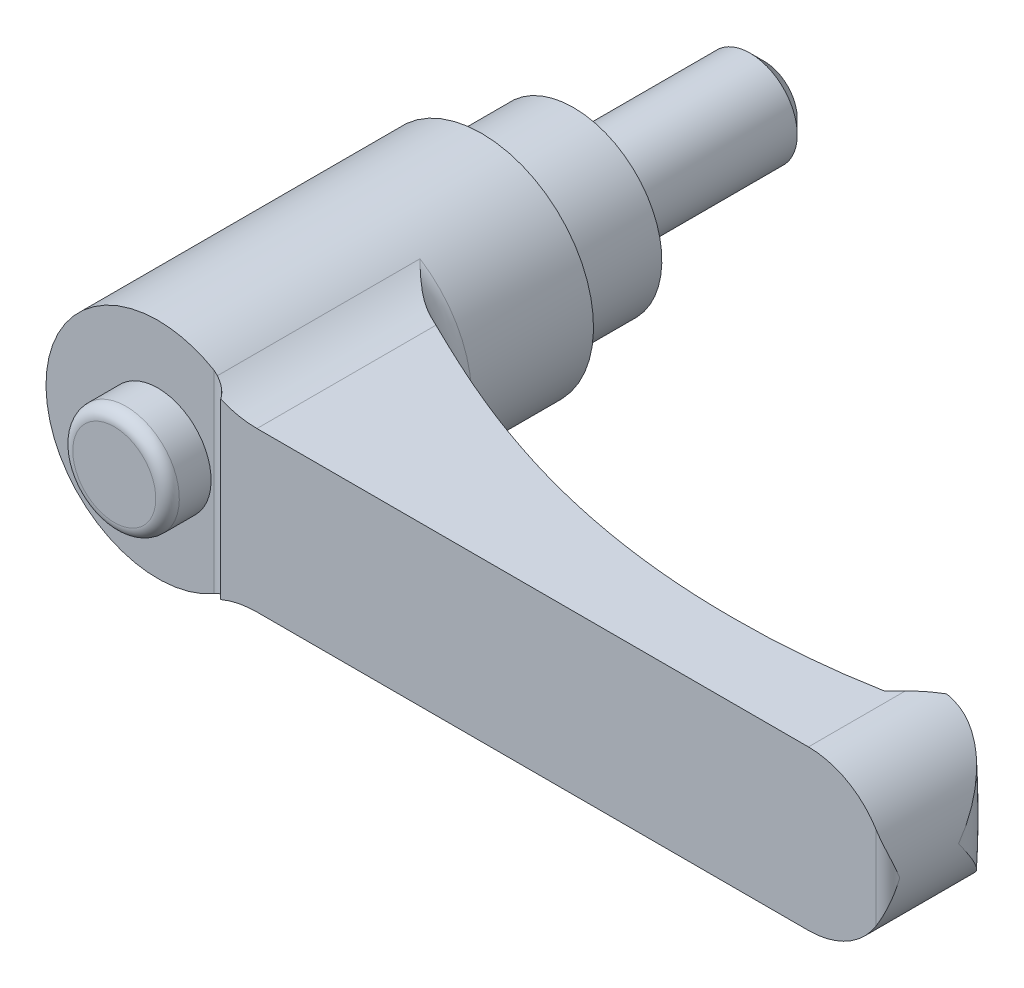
ISO-10303-21;
HEADER;
FILE_DESCRIPTION(('STEP AP214'),'2;1');
FILE_NAME('part.step','',(''),(''),'','','');
FILE_SCHEMA(('AUTOMOTIVE_DESIGN { 1 0 10303 214 1 1 1 1 }'));
ENDSEC;
DATA;
#1=APPLICATION_CONTEXT('core data for automotive mechanical design processes');
#2=APPLICATION_PROTOCOL_DEFINITION('international standard','automotive_design',2000,#1);
#3=PRODUCT_CONTEXT('',#1,'mechanical');
#4=PRODUCT('Part','Part','',(#3));
#5=PRODUCT_RELATED_PRODUCT_CATEGORY('part','',(#4));
#6=PRODUCT_DEFINITION_FORMATION('','',#4);
#7=PRODUCT_DEFINITION_CONTEXT('part definition',#1,'design');
#8=PRODUCT_DEFINITION('design','',#6,#7);
#9=PRODUCT_DEFINITION_SHAPE('','',#8);
#10=(LENGTH_UNIT() NAMED_UNIT(*) SI_UNIT(.MILLI.,.METRE.));
#11=(NAMED_UNIT(*) PLANE_ANGLE_UNIT() SI_UNIT($,.RADIAN.));
#12=(NAMED_UNIT(*) SI_UNIT($,.STERADIAN.) SOLID_ANGLE_UNIT());
#13=UNCERTAINTY_MEASURE_WITH_UNIT(LENGTH_MEASURE(1.E-05),#10,'distance_accuracy_value','');
#14=(GEOMETRIC_REPRESENTATION_CONTEXT(3) GLOBAL_UNCERTAINTY_ASSIGNED_CONTEXT((#13)) GLOBAL_UNIT_ASSIGNED_CONTEXT((#10,
#11,#12)) REPRESENTATION_CONTEXT('',''));
#15=CARTESIAN_POINT('',(0.,0.,0.));
#16=DIRECTION('',(0.,0.,1.));
#17=DIRECTION('',(1.,0.,0.));
#18=AXIS2_PLACEMENT_3D('',#15,#16,#17);
#19=CARTESIAN_POINT('',(6.,0.,0.));
#20=DIRECTION('',(0.,0.,1.));
#21=DIRECTION('',(0.,-1.,0.));
#22=AXIS2_PLACEMENT_3D('',#19,#20,#21);
#23=PLANE('',#22);
#24=CARTESIAN_POINT('',(0.,0.,0.));
#25=DIRECTION('',(0.,0.,-1.));
#26=DIRECTION('',(0.,1.,0.));
#27=AXIS2_PLACEMENT_3D('',#24,#25,#26);
#28=CIRCLE('',#27,4.);
#29=CARTESIAN_POINT('',(0.,4.,0.));
#30=VERTEX_POINT('',#29);
#31=EDGE_CURVE('E423',#30,#30,#28,.T.);
#32=ORIENTED_EDGE('',*,*,#31,.F.);
#33=EDGE_LOOP('',(#32));
#34=FACE_BOUND('',#33,.T.);
#35=CARTESIAN_POINT('',(0.,0.,0.));
#36=DIRECTION('',(0.,0.,-1.));
#37=DIRECTION('',(0.,1.,0.));
#38=AXIS2_PLACEMENT_3D('',#35,#36,#37);
#39=CIRCLE('',#38,6.);
#40=CARTESIAN_POINT('',(0.,6.,0.));
#41=VERTEX_POINT('',#40);
#42=EDGE_CURVE('E347',#41,#41,#39,.T.);
#43=ORIENTED_EDGE('',*,*,#42,.T.);
#44=EDGE_LOOP('',(#43));
#45=FACE_BOUND('',#44,.T.);
#46=ADVANCED_FACE('F14',(#34,#45),#23,.F.);
#47=CARTESIAN_POINT('',(0.,0.,35.5));
#48=DIRECTION('',(0.,0.,-1.));
#49=DIRECTION('',(0.,1.,0.));
#50=AXIS2_PLACEMENT_3D('',#47,#48,#49);
#51=PLANE('',#50);
#52=CARTESIAN_POINT('',(0.,0.,35.5));
#53=DIRECTION('',(0.,0.,-1.));
#54=DIRECTION('',(0.,1.,0.));
#55=AXIS2_PLACEMENT_3D('',#52,#53,#54);
#56=CIRCLE('',#55,9.5);
#57=CARTESIAN_POINT('',(4.75,-8.22724133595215,35.5));
#58=VERTEX_POINT('',#57);
#59=CARTESIAN_POINT('',(4.75,8.22724133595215,35.5));
#60=VERTEX_POINT('',#59);
#61=EDGE_CURVE('E332',#58,#60,#56,.T.);
#62=ORIENTED_EDGE('',*,*,#61,.F.);
#63=DIRECTION('',(0.,1.,0.));
#64=VECTOR('',#63,1.);
#65=CARTESIAN_POINT('',(4.75,-13.5,35.5));
#66=LINE('',#65,#64);
#67=EDGE_CURVE('E383',#58,#60,#66,.T.);
#68=ORIENTED_EDGE('',*,*,#67,.T.);
#69=EDGE_LOOP('',(#62,#68));
#70=FACE_BOUND('',#69,.T.);
#71=CARTESIAN_POINT('',(0.,0.,35.5));
#72=DIRECTION('',(0.,0.,-1.));
#73=DIRECTION('',(0.,1.,0.));
#74=AXIS2_PLACEMENT_3D('',#71,#72,#73);
#75=CIRCLE('',#74,4.52380952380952);
#76=CARTESIAN_POINT('',(0.,4.52380952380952,35.5));
#77=VERTEX_POINT('',#76);
#78=EDGE_CURVE('E183',#77,#77,#75,.F.);
#79=ORIENTED_EDGE('',*,*,#78,.F.);
#80=EDGE_LOOP('',(#79));
#81=FACE_BOUND('',#80,.T.);
#82=ADVANCED_FACE('F158',(#70,#81),#51,.F.);
#83=CARTESIAN_POINT('',(56.25,0.,0.));
#84=DIRECTION('',(0.,0.,1.));
#85=DIRECTION('',(0.,-1.,0.));
#86=AXIS2_PLACEMENT_3D('',#83,#84,#85);
#87=CYLINDRICAL_SURFACE('',#86,6.75);
#88=CARTESIAN_POINT('',(63.,0.,30.5));
#89=CARTESIAN_POINT('',(63.0000000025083,-0.0046874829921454,30.4965903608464));
#90=CARTESIAN_POINT('',(62.9999951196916,-0.0093750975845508,30.4931806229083));
#91=CARTESIAN_POINT('',(62.9990237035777,-0.475524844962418,30.1541065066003));
#92=CARTESIAN_POINT('',(62.9507141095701,-0.938185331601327,29.8175642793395));
#93=CARTESIAN_POINT('',(62.8060463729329,-1.62346497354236,29.3225480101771));
#94=CARTESIAN_POINT('',(62.7456147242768,-1.85084323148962,29.1588881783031));
#95=CARTESIAN_POINT('',(62.6000044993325,-2.30127271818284,28.8365968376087));
#96=CARTESIAN_POINT('',(62.5148384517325,-2.52432607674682,28.6779628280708));
#97=CARTESIAN_POINT('',(62.344804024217,-2.90644000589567,28.4087021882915));
#98=CARTESIAN_POINT('',(62.2657268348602,-3.06692788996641,28.2964051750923));
#99=CARTESIAN_POINT('',(62.0934111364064,-3.38371909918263,28.0768184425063));
#100=CARTESIAN_POINT('',(62.0001726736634,-3.5400224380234,27.9695287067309));
#101=CARTESIAN_POINT('',(61.7993668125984,-3.84715615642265,27.7614384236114));
#102=CARTESIAN_POINT('',(61.6918275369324,-3.99799655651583,27.6606257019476));
#103=CARTESIAN_POINT('',(61.4620426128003,-4.29326696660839,27.4668757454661));
#104=CARTESIAN_POINT('',(61.3398014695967,-4.43769892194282,27.3739361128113));
#105=CARTESIAN_POINT('',(61.0188552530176,-4.78536684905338,27.1560724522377));
#106=CARTESIAN_POINT('',(60.8112818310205,-4.9842025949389,27.0367418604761));
#107=CARTESIAN_POINT('',(60.4758984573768,-5.26551240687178,26.8795376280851));
#108=CARTESIAN_POINT('',(60.3601030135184,-5.35645651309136,26.8307690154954));
#109=CARTESIAN_POINT('',(60.1206554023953,-5.53195453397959,26.7416778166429));
#110=CARTESIAN_POINT('',(59.997005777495,-5.61651049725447,26.7013525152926));
#111=CARTESIAN_POINT('',(59.7699445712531,-5.76076929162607,26.6381973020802));
#112=CARTESIAN_POINT('',(59.667954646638,-5.82188686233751,26.6134697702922));
#113=CARTESIAN_POINT('',(59.4598154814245,-5.93917869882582,26.5707512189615));
#114=CARTESIAN_POINT('',(59.3536672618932,-5.99535416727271,26.5527585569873));
#115=CARTESIAN_POINT('',(59.1377410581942,-6.10229132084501,26.5242546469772));
#116=CARTESIAN_POINT('',(59.0279645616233,-6.15305518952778,26.5137403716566));
#117=CARTESIAN_POINT('',(58.8054681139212,-6.24873887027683,26.5009304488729));
#118=CARTESIAN_POINT('',(58.6927495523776,-6.29366138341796,26.4986309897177));
#119=CARTESIAN_POINT('',(58.4641163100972,-6.37770798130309,26.502966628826));
#120=CARTESIAN_POINT('',(58.3481815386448,-6.41677354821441,26.5096859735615));
#121=CARTESIAN_POINT('',(58.1152313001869,-6.48831686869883,26.5328398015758));
#122=CARTESIAN_POINT('',(57.9982157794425,-6.52079429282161,26.5492747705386));
#123=CARTESIAN_POINT('',(57.7644328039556,-6.57901960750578,26.5923251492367));
#124=CARTESIAN_POINT('',(57.6476652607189,-6.60477054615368,26.618935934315));
#125=CARTESIAN_POINT('',(57.41573023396,-6.64962508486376,26.6826067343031));
#126=CARTESIAN_POINT('',(57.3005622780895,-6.66873068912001,26.7196635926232));
#127=CARTESIAN_POINT('',(57.104290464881,-6.69624244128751,26.7926929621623));
#128=CARTESIAN_POINT('',(57.0224673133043,-6.70614558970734,26.8262017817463));
#129=CARTESIAN_POINT('',(56.8609556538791,-6.72278366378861,26.8986767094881));
#130=CARTESIAN_POINT('',(56.781266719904,-6.72951922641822,26.9376417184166));
#131=CARTESIAN_POINT('',(56.624433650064,-6.74006528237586,27.0209540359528));
#132=CARTESIAN_POINT('',(56.5472927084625,-6.74387222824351,27.0653077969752));
#133=CARTESIAN_POINT('',(56.3961054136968,-6.74884425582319,27.1591719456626));
#134=CARTESIAN_POINT('',(56.3220596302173,-6.75000885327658,27.2086832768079));
#135=CARTESIAN_POINT('',(56.2498,-6.74999999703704,27.2606710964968));
#136=B_SPLINE_CURVE_WITH_KNOTS('',3,(#88,#89,#90,#91,#92,#93,#94,#95,#96,#97,#98,#99,#100,#101,
#102,#103,#104,#105,#106,#107,#108,#109,#110,#111,#112,#113,#114,#115,#116,#117,#118,#119,#120,
#121,#122,#123,#124,#125,#126,#127,#128,#129,#130,#131,#132,#133,#134,#135),.UNSPECIFIED.,.F.,
.F.,(4,2,2,2,2,2,2,2,2,2,2,2,2,2,2,2,2,2,2,2,2,2,2,4),(0.,0.0173896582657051,1.7292315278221,
2.5882674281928,3.44686895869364,4.08007105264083,4.71327107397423,5.34524382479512,
5.97702340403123,6.9068284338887,7.37170994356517,7.83644173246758,8.20045511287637,
8.56437966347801,8.92815681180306,9.29176514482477,9.65879376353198,10.0258407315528,
10.3927210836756,10.7594906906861,11.0261722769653,11.2928002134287,11.5597506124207,
11.8267499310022),.UNSPECIFIED.);
#137=CARTESIAN_POINT('',(58.6622222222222,-6.30425919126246,26.5));
#138=VERTEX_POINT('',#137);
#139=CARTESIAN_POINT('',(63.,0.,30.5));
#140=VERTEX_POINT('',#139);
#141=EDGE_CURVE('E126',#138,#140,#136,.F.);
#142=ORIENTED_EDGE('',*,*,#141,.T.);
#143=CARTESIAN_POINT('',(63.,0.,30.5));
#144=CARTESIAN_POINT('',(63.0000000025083,0.00468748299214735,30.4965903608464));
#145=CARTESIAN_POINT('',(62.9999951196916,0.00937509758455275,30.4931806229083));
#146=CARTESIAN_POINT('',(62.9990237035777,0.47552484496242,30.1541065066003));
#147=CARTESIAN_POINT('',(62.9507141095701,0.938185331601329,29.8175642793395));
#148=CARTESIAN_POINT('',(62.8060463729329,1.62346497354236,29.3225480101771));
#149=CARTESIAN_POINT('',(62.7456147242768,1.85084323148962,29.1588881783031));
#150=CARTESIAN_POINT('',(62.6000044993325,2.30127271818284,28.8365968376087));
#151=CARTESIAN_POINT('',(62.5148384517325,2.52432607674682,28.6779628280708));
#152=CARTESIAN_POINT('',(62.344804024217,2.90644000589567,28.4087021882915));
#153=CARTESIAN_POINT('',(62.2657268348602,3.06692788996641,28.2964051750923));
#154=CARTESIAN_POINT('',(62.0934111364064,3.38371909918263,28.0768184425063));
#155=CARTESIAN_POINT('',(62.0001726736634,3.5400224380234,27.9695287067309));
#156=CARTESIAN_POINT('',(61.7993668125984,3.84715615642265,27.7614384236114));
#157=CARTESIAN_POINT('',(61.6918275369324,3.99799655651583,27.6606257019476));
#158=CARTESIAN_POINT('',(61.4620426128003,4.29326696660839,27.4668757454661));
#159=CARTESIAN_POINT('',(61.3398014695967,4.43769892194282,27.3739361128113));
#160=CARTESIAN_POINT('',(61.0188552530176,4.78536684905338,27.1560724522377));
#161=CARTESIAN_POINT('',(60.8112818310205,4.9842025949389,27.0367418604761));
#162=CARTESIAN_POINT('',(60.4758984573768,5.26551240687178,26.8795376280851));
#163=CARTESIAN_POINT('',(60.3601030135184,5.35645651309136,26.8307690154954));
#164=CARTESIAN_POINT('',(60.1206554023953,5.53195453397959,26.7416778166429));
#165=CARTESIAN_POINT('',(59.997005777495,5.61651049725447,26.7013525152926));
#166=CARTESIAN_POINT('',(59.7699445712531,5.76076929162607,26.6381973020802));
#167=CARTESIAN_POINT('',(59.667954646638,5.82188686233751,26.6134697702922));
#168=CARTESIAN_POINT('',(59.4598154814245,5.93917869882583,26.5707512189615));
#169=CARTESIAN_POINT('',(59.3536672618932,5.99535416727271,26.5527585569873));
#170=CARTESIAN_POINT('',(59.1377410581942,6.10229132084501,26.5242546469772));
#171=CARTESIAN_POINT('',(59.0279645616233,6.15305518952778,26.5137403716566));
#172=CARTESIAN_POINT('',(58.8054681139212,6.24873887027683,26.5009304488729));
#173=CARTESIAN_POINT('',(58.6927495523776,6.29366138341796,26.4986309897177));
#174=CARTESIAN_POINT('',(58.4641163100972,6.37770798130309,26.502966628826));
#175=CARTESIAN_POINT('',(58.3481815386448,6.41677354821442,26.5096859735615));
#176=CARTESIAN_POINT('',(58.1152313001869,6.48831686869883,26.5328398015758));
#177=CARTESIAN_POINT('',(57.9982157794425,6.52079429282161,26.5492747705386));
#178=CARTESIAN_POINT('',(57.7644328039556,6.57901960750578,26.5923251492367));
#179=CARTESIAN_POINT('',(57.6476652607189,6.60477054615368,26.618935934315));
#180=CARTESIAN_POINT('',(57.41573023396,6.64962508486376,26.6826067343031));
#181=CARTESIAN_POINT('',(57.3005622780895,6.66873068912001,26.7196635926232));
#182=CARTESIAN_POINT('',(57.1042904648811,6.69624244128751,26.7926929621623));
#183=CARTESIAN_POINT('',(57.0224673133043,6.70614558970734,26.8262017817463));
#184=CARTESIAN_POINT('',(56.8609556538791,6.72278366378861,26.8986767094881));
#185=CARTESIAN_POINT('',(56.781266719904,6.72951922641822,26.9376417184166));
#186=CARTESIAN_POINT('',(56.624433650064,6.74006528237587,27.0209540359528));
#187=CARTESIAN_POINT('',(56.5472927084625,6.74387222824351,27.0653077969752));
#188=CARTESIAN_POINT('',(56.3961054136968,6.74884425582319,27.1591719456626));
#189=CARTESIAN_POINT('',(56.3220596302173,6.75000885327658,27.2086832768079));
#190=CARTESIAN_POINT('',(56.2498,6.74999999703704,27.2606710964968));
#191=B_SPLINE_CURVE_WITH_KNOTS('',3,(#143,#144,#145,#146,#147,#148,#149,#150,#151,#152,#153,
#154,#155,#156,#157,#158,#159,#160,#161,#162,#163,#164,#165,#166,#167,#168,#169,#170,#171,#172,
#173,#174,#175,#176,#177,#178,#179,#180,#181,#182,#183,#184,#185,#186,#187,#188,#189,#190),
.UNSPECIFIED.,.F.,.F.,(4,2,2,2,2,2,2,2,2,2,2,2,2,2,2,2,2,2,2,2,2,2,2,4),(0.,0.0173896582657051,
1.7292315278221,2.5882674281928,3.44686895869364,4.08007105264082,4.71327107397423,
5.34524382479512,5.97702340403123,6.9068284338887,7.37170994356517,7.83644173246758,
8.20045511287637,8.56437966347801,8.92815681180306,9.29176514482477,9.65879376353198,
10.0258407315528,10.3927210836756,10.7594906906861,11.0261722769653,11.2928002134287,
11.5597506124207,11.8267499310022),.UNSPECIFIED.);
#192=CARTESIAN_POINT('',(58.6622222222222,6.30425919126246,26.5));
#193=VERTEX_POINT('',#192);
#194=EDGE_CURVE('E123',#140,#193,#191,.T.);
#195=ORIENTED_EDGE('',*,*,#194,.T.);
#196=CARTESIAN_POINT('',(56.25,0.,26.5));
#197=DIRECTION('',(0.,0.,-1.));
#198=DIRECTION('',(0.,1.,0.));
#199=AXIS2_PLACEMENT_3D('',#196,#197,#198);
#200=CIRCLE('',#199,6.75);
#201=CARTESIAN_POINT('',(58.,6.51920240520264,26.5));
#202=VERTEX_POINT('',#201);
#203=EDGE_CURVE('E308',#193,#202,#200,.F.);
#204=ORIENTED_EDGE('',*,*,#203,.T.);
#205=CARTESIAN_POINT('',(56.25,0.,28.25));
#206=DIRECTION('',(-0.707106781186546,0.,-0.70710678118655));
#207=DIRECTION('',(-0.70710678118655,0.,0.707106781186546));
#208=AXIS2_PLACEMENT_3D('',#205,#206,#207);
#209=ELLIPSE('',#208,9.54594154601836,6.75);
#210=CARTESIAN_POINT('',(56.25,6.75,28.25));
#211=VERTEX_POINT('',#210);
#212=EDGE_CURVE('E374',#202,#211,#209,.F.);
#213=ORIENTED_EDGE('',*,*,#212,.T.);
#214=DIRECTION('',(0.,0.,1.));
#215=VECTOR('',#214,1.);
#216=CARTESIAN_POINT('',(56.25,6.75,0.));
#217=LINE('',#216,#215);
#218=CARTESIAN_POINT('',(56.25,6.75,36.5));
#219=VERTEX_POINT('',#218);
#220=EDGE_CURVE('E330',#211,#219,#217,.T.);
#221=ORIENTED_EDGE('',*,*,#220,.T.);
#222=CARTESIAN_POINT('',(56.25,0.,36.5));
#223=DIRECTION('',(0.,0.,1.));
#224=DIRECTION('',(0.,-1.,0.));
#225=AXIS2_PLACEMENT_3D('',#222,#223,#224);
#226=CIRCLE('',#225,6.75);
#227=CARTESIAN_POINT('',(62.,3.53553390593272,36.5));
#228=VERTEX_POINT('',#227);
#229=EDGE_CURVE('E322',#228,#219,#226,.T.);
#230=ORIENTED_EDGE('',*,*,#229,.F.);
#231=CARTESIAN_POINT('',(62.,3.53553390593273,36.5));
#232=CARTESIAN_POINT('',(62.0299932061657,3.48675666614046,36.4999933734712));
#233=CARTESIAN_POINT('',(62.0593538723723,3.43761273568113,36.4986515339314));
#234=CARTESIAN_POINT('',(62.1167538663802,3.33870692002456,36.4935798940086));
#235=CARTESIAN_POINT('',(62.1447937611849,3.28894531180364,36.489851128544));
#236=CARTESIAN_POINT('',(62.2267562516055,3.13908056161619,36.4755285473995));
#237=CARTESIAN_POINT('',(62.2786643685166,3.03816514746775,36.4617957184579));
#238=CARTESIAN_POINT('',(62.3766467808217,2.83536966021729,36.4277987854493));
#239=CARTESIAN_POINT('',(62.4227515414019,2.73349792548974,36.4075709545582));
#240=CARTESIAN_POINT('',(62.509502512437,2.52854152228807,36.3618646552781));
#241=CARTESIAN_POINT('',(62.550144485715,2.42545597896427,36.3363821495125));
#242=CARTESIAN_POINT('',(62.6493297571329,2.15471359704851,36.2642737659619));
#243=CARTESIAN_POINT('',(62.7035065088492,1.98634279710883,36.2142841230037));
#244=CARTESIAN_POINT('',(62.7980553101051,1.64812969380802,36.1068184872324));
#245=CARTESIAN_POINT('',(62.8384218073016,1.4782868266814,36.0493394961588));
#246=CARTESIAN_POINT('',(62.9057483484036,1.1374266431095,35.9293690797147));
#247=CARTESIAN_POINT('',(62.9326868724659,0.966407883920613,35.8668697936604));
#248=CARTESIAN_POINT('',(62.9733111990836,0.623942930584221,35.7390768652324));
#249=CARTESIAN_POINT('',(62.9870036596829,0.452496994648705,35.6737846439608));
#250=CARTESIAN_POINT('',(62.997837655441,0.192449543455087,35.5740662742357));
#251=CARTESIAN_POINT('',(62.999781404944,0.103891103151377,35.539987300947));
#252=CARTESIAN_POINT('',(62.9999941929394,0.0102233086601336,35.5039349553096));
#253=CARTESIAN_POINT('',(62.9999999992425,0.00511164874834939,35.5019674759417));
#254=CARTESIAN_POINT('',(63.,0.,35.5));
#255=B_SPLINE_CURVE_WITH_KNOTS('',3,(#231,#232,#233,#234,#235,#236,#237,#238,#239,#240,#241,
#242,#243,#244,#245,#246,#247,#248,#249,#250,#251,#252,#253,#254),.UNSPECIFIED.,.F.,.F.,(4,2,2,
2,2,2,2,2,2,2,2,4),(0.,0.171732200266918,0.343389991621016,0.685890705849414,1.02651095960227,
1.36739390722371,1.91796289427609,2.46875297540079,3.02042294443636,3.57181547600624,
3.85648313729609,3.87291482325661),.UNSPECIFIED.);
#256=CARTESIAN_POINT('',(63.,0.,35.5));
#257=VERTEX_POINT('',#256);
#258=EDGE_CURVE('E169',#257,#228,#255,.F.);
#259=ORIENTED_EDGE('',*,*,#258,.F.);
#260=CARTESIAN_POINT('',(62.,-3.53553390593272,36.5));
#261=CARTESIAN_POINT('',(62.0299932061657,-3.48675666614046,36.4999933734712));
#262=CARTESIAN_POINT('',(62.0593538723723,-3.43761273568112,36.4986515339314));
#263=CARTESIAN_POINT('',(62.1167538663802,-3.33870692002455,36.4935798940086));
#264=CARTESIAN_POINT('',(62.1447937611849,-3.28894531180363,36.489851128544));
#265=CARTESIAN_POINT('',(62.2267562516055,-3.13908056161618,36.4755285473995));
#266=CARTESIAN_POINT('',(62.2786643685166,-3.03816514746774,36.4617957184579));
#267=CARTESIAN_POINT('',(62.3766467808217,-2.83536966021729,36.4277987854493));
#268=CARTESIAN_POINT('',(62.4227515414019,-2.73349792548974,36.4075709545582));
#269=CARTESIAN_POINT('',(62.509502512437,-2.52854152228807,36.3618646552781));
#270=CARTESIAN_POINT('',(62.550144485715,-2.42545597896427,36.3363821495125));
#271=CARTESIAN_POINT('',(62.6493297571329,-2.15471359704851,36.2642737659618));
#272=CARTESIAN_POINT('',(62.7035065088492,-1.98634279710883,36.2142841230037));
#273=CARTESIAN_POINT('',(62.7980553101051,-1.64812969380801,36.1068184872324));
#274=CARTESIAN_POINT('',(62.8384218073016,-1.4782868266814,36.0493394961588));
#275=CARTESIAN_POINT('',(62.9057483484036,-1.1374266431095,35.9293690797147));
#276=CARTESIAN_POINT('',(62.9326868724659,-0.966407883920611,35.8668697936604));
#277=CARTESIAN_POINT('',(62.9733111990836,-0.623942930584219,35.7390768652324));
#278=CARTESIAN_POINT('',(62.9870036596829,-0.452496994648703,35.6737846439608));
#279=CARTESIAN_POINT('',(62.997837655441,-0.192449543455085,35.5740662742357));
#280=CARTESIAN_POINT('',(62.999781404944,-0.103891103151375,35.539987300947));
#281=CARTESIAN_POINT('',(62.9999941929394,-0.0102233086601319,35.5039349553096));
#282=CARTESIAN_POINT('',(62.9999999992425,-0.00511164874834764,35.5019674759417));
#283=CARTESIAN_POINT('',(63.,0.,35.5));
#284=B_SPLINE_CURVE_WITH_KNOTS('',3,(#260,#261,#262,#263,#264,#265,#266,#267,#268,#269,#270,
#271,#272,#273,#274,#275,#276,#277,#278,#279,#280,#281,#282,#283),.UNSPECIFIED.,.F.,.F.,(4,2,2,
2,2,2,2,2,2,2,2,4),(0.,0.171732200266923,0.34338999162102,0.685890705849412,1.02651095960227,
1.36739390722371,1.91796289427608,2.46875297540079,3.02042294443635,3.57181547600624,
3.85648313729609,3.8729148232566),.UNSPECIFIED.);
#285=CARTESIAN_POINT('',(62.,-3.53553390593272,36.5));
#286=VERTEX_POINT('',#285);
#287=EDGE_CURVE('E177',#286,#257,#284,.T.);
#288=ORIENTED_EDGE('',*,*,#287,.F.);
#289=CARTESIAN_POINT('',(56.25,-6.75,36.5));
#290=VERTEX_POINT('',#289);
#291=EDGE_CURVE('E310',#290,#286,#226,.T.);
#292=ORIENTED_EDGE('',*,*,#291,.F.);
#293=DIRECTION('',(0.,0.,1.));
#294=VECTOR('',#293,1.);
#295=CARTESIAN_POINT('',(56.25,-6.75,0.));
#296=LINE('',#295,#294);
#297=CARTESIAN_POINT('',(56.25,-6.75,28.25));
#298=VERTEX_POINT('',#297);
#299=EDGE_CURVE('E355',#298,#290,#296,.T.);
#300=ORIENTED_EDGE('',*,*,#299,.F.);
#301=CARTESIAN_POINT('',(58.,-6.51920240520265,26.5));
#302=VERTEX_POINT('',#301);
#303=EDGE_CURVE('E375',#298,#302,#209,.F.);
#304=ORIENTED_EDGE('',*,*,#303,.T.);
#305=EDGE_CURVE('E134',#302,#138,#200,.F.);
#306=ORIENTED_EDGE('',*,*,#305,.T.);
#307=EDGE_LOOP('',(#142,#195,#204,#213,#221,#230,#259,#288,#292,#300,#304,#306));
#308=FACE_BOUND('',#307,.T.);
#309=ADVANCED_FACE('F132',(#308),#87,.T.);
#310=CARTESIAN_POINT('',(59.,-13.5,26.5));
#311=DIRECTION('',(0.,0.,-1.));
#312=DIRECTION('',(0.,1.,0.));
#313=AXIS2_PLACEMENT_3D('',#310,#311,#312);
#314=PLANE('',#313);
#315=ORIENTED_EDGE('',*,*,#203,.F.);
#316=CARTESIAN_POINT('',(0.,0.,26.5));
#317=DIRECTION('',(0.,0.,-1.));
#318=DIRECTION('',(0.,1.,0.));
#319=AXIS2_PLACEMENT_3D('',#316,#317,#318);
#320=CIRCLE('',#319,59.);
#321=EDGE_CURVE('E37',#193,#138,#320,.T.);
#322=ORIENTED_EDGE('',*,*,#321,.T.);
#323=ORIENTED_EDGE('',*,*,#305,.F.);
#324=DIRECTION('',(0.,1.,0.));
#325=VECTOR('',#324,1.);
#326=CARTESIAN_POINT('',(58.,-13.5,26.5));
#327=LINE('',#326,#325);
#328=EDGE_CURVE('E327',#302,#202,#327,.T.);
#329=ORIENTED_EDGE('',*,*,#328,.T.);
#330=EDGE_LOOP('',(#315,#322,#323,#329));
#331=FACE_BOUND('',#330,.T.);
#332=ADVANCED_FACE('F157',(#331),#314,.T.);
#333=CARTESIAN_POINT('',(0.,0.,36.5));
#334=DIRECTION('',(0.,0.,1.));
#335=DIRECTION('',(0.,-1.,0.));
#336=AXIS2_PLACEMENT_3D('',#333,#334,#335);
#337=PLANE('',#336);
#338=CARTESIAN_POINT('',(9.41740410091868,14.75,36.5));
#339=DIRECTION('',(0.,0.,1.));
#340=DIRECTION('',(1.,0.,0.));
#341=AXIS2_PLACEMENT_3D('',#338,#339,#340);
#342=CIRCLE('',#341,8.);
#343=CARTESIAN_POINT('',(6.33333333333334,7.36836688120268,36.5));
#344=VERTEX_POINT('',#343);
#345=CARTESIAN_POINT('',(9.41740410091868,6.75,36.5));
#346=VERTEX_POINT('',#345);
#347=EDGE_CURVE('E369',#344,#346,#342,.T.);
#348=ORIENTED_EDGE('',*,*,#347,.F.);
#349=DIRECTION('',(0.,1.,0.));
#350=VECTOR('',#349,1.);
#351=CARTESIAN_POINT('',(6.33333333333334,-13.5,36.5));
#352=LINE('',#351,#350);
#353=CARTESIAN_POINT('',(6.33333333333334,-7.36836688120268,36.5));
#354=VERTEX_POINT('',#353);
#355=EDGE_CURVE('E326',#354,#344,#352,.T.);
#356=ORIENTED_EDGE('',*,*,#355,.F.);
#357=CARTESIAN_POINT('',(9.41740410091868,-14.75,36.5));
#358=DIRECTION('',(0.,0.,1.));
#359=DIRECTION('',(1.,0.,0.));
#360=AXIS2_PLACEMENT_3D('',#357,#358,#359);
#361=CIRCLE('',#360,8.);
#362=CARTESIAN_POINT('',(9.41740410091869,-6.75,36.5));
#363=VERTEX_POINT('',#362);
#364=EDGE_CURVE('E361',#363,#354,#361,.T.);
#365=ORIENTED_EDGE('',*,*,#364,.F.);
#366=DIRECTION('',(-1.,0.,0.));
#367=VECTOR('',#366,1.);
#368=CARTESIAN_POINT('',(56.25,-6.75,36.5));
#369=LINE('',#368,#367);
#370=EDGE_CURVE('E364',#290,#363,#369,.T.);
#371=ORIENTED_EDGE('',*,*,#370,.F.);
#372=ORIENTED_EDGE('',*,*,#291,.T.);
#373=DIRECTION('',(0.,1.,0.));
#374=VECTOR('',#373,1.);
#375=CARTESIAN_POINT('',(62.,-13.5,36.5));
#376=LINE('',#375,#374);
#377=EDGE_CURVE('E315',#286,#228,#376,.T.);
#378=ORIENTED_EDGE('',*,*,#377,.T.);
#379=ORIENTED_EDGE('',*,*,#229,.T.);
#380=DIRECTION('',(1.,0.,0.));
#381=VECTOR('',#380,1.);
#382=CARTESIAN_POINT('',(9.41740410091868,6.75,36.5));
#383=LINE('',#382,#381);
#384=EDGE_CURVE('E367',#346,#219,#383,.T.);
#385=ORIENTED_EDGE('',*,*,#384,.F.);
#386=EDGE_LOOP('',(#348,#356,#365,#371,#372,#378,#379,#385));
#387=FACE_BOUND('',#386,.T.);
#388=ADVANCED_FACE('F240',(#387),#337,.T.);
#389=CARTESIAN_POINT('',(0.,0.,0.));
#390=DIRECTION('',(0.,0.,-1.));
#391=DIRECTION('',(0.,1.,0.));
#392=AXIS2_PLACEMENT_3D('',#389,#390,#391);
#393=CYLINDRICAL_SURFACE('',#392,9.5);
#394=CARTESIAN_POINT('',(0.,0.,18.3481601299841));
#395=DIRECTION('',(0.,0.,-1.));
#396=DIRECTION('',(0.,1.,0.));
#397=AXIS2_PLACEMENT_3D('',#394,#395,#396);
#398=CIRCLE('',#397,9.5);
#399=CARTESIAN_POINT('',(5.11230508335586,8.00714285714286,18.3481601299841));
#400=VERTEX_POINT('',#399);
#401=CARTESIAN_POINT('',(5.11230508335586,-8.00714285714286,18.3481601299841));
#402=VERTEX_POINT('',#401);
#403=EDGE_CURVE('E413',#400,#402,#398,.T.);
#404=ORIENTED_EDGE('',*,*,#403,.T.);
#405=DIRECTION('',(0.,0.,1.));
#406=VECTOR('',#405,1.);
#407=CARTESIAN_POINT('',(5.11230508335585,-8.00714285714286,0.));
#408=LINE('',#407,#406);
#409=CARTESIAN_POINT('',(5.11230508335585,-8.00714285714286,35.5614827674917));
#410=VERTEX_POINT('',#409);
#411=EDGE_CURVE('E359',#402,#410,#408,.T.);
#412=ORIENTED_EDGE('',*,*,#411,.T.);
#413=CARTESIAN_POINT('',(4.75,-8.22724133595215,35.5));
#414=CARTESIAN_POINT('',(4.82354897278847,-8.18479174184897,35.5056127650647));
#415=CARTESIAN_POINT('',(4.89626028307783,-8.1414834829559,35.5152432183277));
#416=CARTESIAN_POINT('',(5.03945202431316,-8.05362753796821,35.5421901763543));
#417=CARTESIAN_POINT('',(5.10993308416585,-8.00908020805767,35.5595044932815));
#418=CARTESIAN_POINT('',(5.24861636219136,-7.91889687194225,35.6016146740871));
#419=CARTESIAN_POINT('',(5.31680005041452,-7.87325555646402,35.6264601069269));
#420=CARTESIAN_POINT('',(5.44990684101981,-7.7817124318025,35.6832973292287));
#421=CARTESIAN_POINT('',(5.51483003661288,-7.7358106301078,35.7152889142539));
#422=CARTESIAN_POINT('',(5.69141984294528,-7.6077148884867,35.8145402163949));
#423=CARTESIAN_POINT('',(5.79903338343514,-7.52579740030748,35.8895684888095));
#424=CARTESIAN_POINT('',(5.99917718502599,-7.36722875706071,36.0610902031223));
#425=CARTESIAN_POINT('',(6.09178179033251,-7.29055280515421,36.157471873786));
#426=CARTESIAN_POINT('',(6.20382113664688,-7.19472379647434,36.3011658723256));
#427=CARTESIAN_POINT('',(6.23139044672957,-7.17084441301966,36.33916914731));
#428=CARTESIAN_POINT('',(6.28417716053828,-7.12462925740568,36.4176957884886));
#429=CARTESIAN_POINT('',(6.30939340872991,-7.1022942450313,36.4582203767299));
#430=CARTESIAN_POINT('',(6.33333333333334,-7.08088192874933,36.5));
#431=B_SPLINE_CURVE_WITH_KNOTS('',3,(#413,#414,#415,#416,#417,#418,#419,#420,#421,#422,#423,
#424,#425,#426,#427,#428,#429,#430),.UNSPECIFIED.,.F.,.F.,(4,2,2,2,2,2,2,2,4),(0.,
0.25516766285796,0.510262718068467,0.767074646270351,1.02387922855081,1.48566336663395,
1.94508518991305,2.10299549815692,2.26098294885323),.UNSPECIFIED.);
#432=EDGE_CURVE('E214',#58,#410,#431,.T.);
#433=ORIENTED_EDGE('',*,*,#432,.F.);
#434=ORIENTED_EDGE('',*,*,#61,.T.);
#435=CARTESIAN_POINT('',(6.33333333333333,7.08088192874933,36.5));
#436=CARTESIAN_POINT('',(6.30193651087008,7.10896982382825,36.4452145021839));
#437=CARTESIAN_POINT('',(6.26833956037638,7.13863883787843,36.3925689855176));
#438=CARTESIAN_POINT('',(6.19723055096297,7.20045324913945,36.2916619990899));
#439=CARTESIAN_POINT('',(6.15972345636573,7.23259549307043,36.243395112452));
#440=CARTESIAN_POINT('',(6.08131079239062,7.2986494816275,36.1513438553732));
#441=CARTESIAN_POINT('',(6.04041526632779,7.33255589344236,36.1075470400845));
#442=CARTESIAN_POINT('',(5.95546899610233,7.40171574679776,36.0242830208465));
#443=CARTESIAN_POINT('',(5.91141716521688,7.4369696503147,35.9848173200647));
#444=CARTESIAN_POINT('',(5.7754647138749,7.54368484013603,35.8733623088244));
#445=CARTESIAN_POINT('',(5.67929205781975,7.61650473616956,35.8077657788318));
#446=CARTESIAN_POINT('',(5.47750803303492,7.76289095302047,35.6942705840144));
#447=CARTESIAN_POINT('',(5.37189158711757,7.83645765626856,35.6463815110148));
#448=CARTESIAN_POINT('',(5.1806466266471,7.96370194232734,35.5790108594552));
#449=CARTESIAN_POINT('',(5.09668204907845,8.01772299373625,35.5554125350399));
#450=CARTESIAN_POINT('',(4.92555498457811,8.12398585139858,35.5192948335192));
#451=CARTESIAN_POINT('',(4.83839896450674,8.17623088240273,35.5067542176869));
#452=CARTESIAN_POINT('',(4.75,8.22724133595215,35.5));
#453=B_SPLINE_CURVE_WITH_KNOTS('',3,(#435,#436,#437,#438,#439,#440,#441,#442,#443,#444,#445,
#446,#447,#448,#449,#450,#451,#452),.UNSPECIFIED.,.F.,.F.,(4,2,2,2,2,2,2,2,4),(0.,
0.207163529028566,0.414067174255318,0.620378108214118,0.826760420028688,1.23705708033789,
1.64757566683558,1.9547198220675,2.26127274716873),.UNSPECIFIED.);
#454=CARTESIAN_POINT('',(5.11230508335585,8.00714285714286,35.5614827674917));
#455=VERTEX_POINT('',#454);
#456=EDGE_CURVE('E228',#455,#60,#453,.T.);
#457=ORIENTED_EDGE('',*,*,#456,.F.);
#458=DIRECTION('',(0.,0.,1.));
#459=VECTOR('',#458,1.);
#460=CARTESIAN_POINT('',(5.11230508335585,8.00714285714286,0.));
#461=LINE('',#460,#459);
#462=EDGE_CURVE('E350',#400,#455,#461,.T.);
#463=ORIENTED_EDGE('',*,*,#462,.F.);
#464=EDGE_LOOP('',(#404,#412,#433,#434,#457,#463));
#465=FACE_BOUND('',#464,.T.);
#466=CARTESIAN_POINT('',(0.,0.,8.));
#467=DIRECTION('',(0.,0.,-1.));
#468=DIRECTION('',(0.,1.,0.));
#469=AXIS2_PLACEMENT_3D('',#466,#467,#468);
#470=CIRCLE('',#469,9.5);
#471=CARTESIAN_POINT('',(0.,9.5,8.));
#472=VERTEX_POINT('',#471);
#473=EDGE_CURVE('E333',#472,#472,#470,.T.);
#474=ORIENTED_EDGE('',*,*,#473,.F.);
#475=EDGE_LOOP('',(#474));
#476=FACE_BOUND('',#475,.T.);
#477=ADVANCED_FACE('F238',(#465,#476),#393,.T.);
#478=CARTESIAN_POINT('',(9.41740410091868,14.75,0.));
#479=DIRECTION('',(0.,0.,1.));
#480=DIRECTION('',(0.,-1.,0.));
#481=AXIS2_PLACEMENT_3D('',#478,#479,#480);
#482=CYLINDRICAL_SURFACE('',#481,8.);
#483=DIRECTION('',(0.,0.,1.));
#484=VECTOR('',#483,1.);
#485=CARTESIAN_POINT('',(9.41740410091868,6.75,0.));
#486=LINE('',#485,#484);
#487=CARTESIAN_POINT('',(9.41740410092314,6.75,21.3021638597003));
#488=VERTEX_POINT('',#487);
#489=EDGE_CURVE('E352',#488,#346,#486,.T.);
#490=ORIENTED_EDGE('',*,*,#489,.F.);
#491=CARTESIAN_POINT('',(9.41760410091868,6.7500000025,21.3022609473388));
#492=CARTESIAN_POINT('',(9.34663199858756,6.74999859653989,21.2678090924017));
#493=CARTESIAN_POINT('',(9.27552780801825,6.75094090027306,21.2336266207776));
#494=CARTESIAN_POINT('',(9.13312349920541,6.75473540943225,21.1659081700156));
#495=CARTESIAN_POINT('',(9.06182355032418,6.75758629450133,21.1323717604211));
#496=CARTESIAN_POINT('',(8.91899698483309,6.7652204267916,21.066004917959));
#497=CARTESIAN_POINT('',(8.84747036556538,6.77000369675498,21.0331744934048));
#498=CARTESIAN_POINT('',(8.704162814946,6.78153362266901,20.9682923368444));
#499=CARTESIAN_POINT('',(8.63238174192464,6.78828163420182,20.9362411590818));
#500=CARTESIAN_POINT('',(8.56050869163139,6.79602424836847,20.9046385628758));
#501=B_SPLINE_CURVE_WITH_KNOTS('',3,(#491,#492,#493,#494,#495,#496,#497,#498,#499,#500),
.UNSPECIFIED.,.F.,.F.,(4,2,2,2,4),(0.,0.236671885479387,0.473180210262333,0.709691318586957,
0.946365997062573),.UNSPECIFIED.);
#502=CARTESIAN_POINT('',(8.56096354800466,6.79597525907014,20.9048385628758));
#503=VERTEX_POINT('',#502);
#504=EDGE_CURVE('E246',#488,#503,#501,.T.);
#505=ORIENTED_EDGE('',*,*,#504,.T.);
#506=CARTESIAN_POINT('',(8.56141843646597,6.79592629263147,20.9050385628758));
#507=CARTESIAN_POINT('',(8.47420918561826,6.80531273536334,20.8666951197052));
#508=CARTESIAN_POINT('',(8.38798367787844,6.81604134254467,20.8265142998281));
#509=CARTESIAN_POINT('',(8.21753113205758,6.84002445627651,20.7428900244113));
#510=CARTESIAN_POINT('',(8.13330325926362,6.85327788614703,20.6994479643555));
#511=CARTESIAN_POINT('',(7.88393651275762,6.89653514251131,20.5650030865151));
#512=CARTESIAN_POINT('',(7.72171249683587,6.9300806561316,20.4697011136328));
#513=CARTESIAN_POINT('',(7.40583761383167,7.00533652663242,20.2709379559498));
#514=CARTESIAN_POINT('',(7.25214096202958,7.0469964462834,20.1675294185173));
#515=CARTESIAN_POINT('',(6.95163567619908,7.13786246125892,19.9540740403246));
#516=CARTESIAN_POINT('',(6.80483124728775,7.18707308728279,19.8440232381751));
#517=CARTESIAN_POINT('',(6.52235248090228,7.29074005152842,19.6227797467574));
#518=CARTESIAN_POINT('',(6.38647079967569,7.34497015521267,19.5117441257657));
#519=CARTESIAN_POINT('',(6.12012077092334,7.45966750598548,19.286442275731));
#520=CARTESIAN_POINT('',(5.98965290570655,7.5201353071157,19.1721757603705));
#521=CARTESIAN_POINT('',(5.73356790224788,7.64719834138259,18.9415280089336));
#522=CARTESIAN_POINT('',(5.60795285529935,7.71379617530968,18.825145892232));
#523=CARTESIAN_POINT('',(5.36116691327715,7.853115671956,18.5913699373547));
#524=CARTESIAN_POINT('',(5.23999538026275,7.92583645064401,18.4739762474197));
#525=CARTESIAN_POINT('',(5.11800178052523,8.00350824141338,18.3537764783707));
#526=CARTESIAN_POINT('',(5.11515285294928,8.00532465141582,18.3509683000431));
#527=CARTESIAN_POINT('',(5.11230508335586,8.00714285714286,18.3481601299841));
#528=B_SPLINE_CURVE_WITH_KNOTS('',3,(#506,#507,#508,#509,#510,#511,#512,#513,#514,#515,#516,
#517,#518,#519,#520,#521,#522,#523,#524,#525,#526,#527),.UNSPECIFIED.,.F.,.F.,(4,2,2,2,2,2,2,2,
2,2,4),(0.,0.287104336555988,0.574086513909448,1.14672714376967,1.7159158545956,
2.28544744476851,2.83621563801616,3.38703279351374,3.93808473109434,4.48905724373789,
4.50223731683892),.UNSPECIFIED.);
#529=EDGE_CURVE('E393',#503,#400,#528,.T.);
#530=ORIENTED_EDGE('',*,*,#529,.T.);
#531=ORIENTED_EDGE('',*,*,#462,.T.);
#532=CARTESIAN_POINT('',(6.33333333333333,7.36836688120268,36.5));
#533=CARTESIAN_POINT('',(6.30572631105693,7.37990157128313,36.4517939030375));
#534=CARTESIAN_POINT('',(6.27620115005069,7.39241872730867,36.4049318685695));
#535=CARTESIAN_POINT('',(6.21369042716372,7.41942165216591,36.3142041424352));
#536=CARTESIAN_POINT('',(6.18070621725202,7.433906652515,36.2703372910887));
#537=CARTESIAN_POINT('',(6.11180020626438,7.46478219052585,36.1860768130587));
#538=CARTESIAN_POINT('',(6.07589356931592,7.48116305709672,36.1456672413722));
#539=CARTESIAN_POINT('',(6.001409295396,7.51586753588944,36.0683091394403));
#540=CARTESIAN_POINT('',(5.96283154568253,7.53419123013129,36.0313607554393));
#541=CARTESIAN_POINT('',(5.84377892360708,7.59200134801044,35.9260570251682));
#542=CARTESIAN_POINT('',(5.75985492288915,7.63438377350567,35.8630866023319));
#543=CARTESIAN_POINT('',(5.58613979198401,7.72639161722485,35.7523382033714));
#544=CARTESIAN_POINT('',(5.49634385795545,7.77602300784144,35.7045728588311));
#545=CARTESIAN_POINT('',(5.35683601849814,7.85689272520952,35.6430239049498));
#546=CARTESIAN_POINT('',(5.30809845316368,7.88582630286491,35.6238148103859));
#547=CARTESIAN_POINT('',(5.21035384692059,7.94529574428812,35.5895762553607));
#548=CARTESIAN_POINT('',(5.1613480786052,7.975826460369,35.5745342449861));
#549=CARTESIAN_POINT('',(5.11230508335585,8.00714285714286,35.5614827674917));
#550=B_SPLINE_CURVE_WITH_KNOTS('',3,(#532,#533,#534,#535,#536,#537,#538,#539,#540,#541,#542,
#543,#544,#545,#546,#547,#548,#549),.UNSPECIFIED.,.F.,.F.,(4,2,2,2,2,2,2,2,4),(0.,
0.170139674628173,0.340213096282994,0.50945430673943,0.678702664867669,1.01657399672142,
1.35472528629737,1.53411415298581,1.7129567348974),.UNSPECIFIED.);
#551=EDGE_CURVE('E222',#344,#455,#550,.T.);
#552=ORIENTED_EDGE('',*,*,#551,.F.);
#553=ORIENTED_EDGE('',*,*,#347,.T.);
#554=EDGE_LOOP('',(#490,#505,#530,#531,#552,#553));
#555=FACE_BOUND('',#554,.T.);
#556=ADVANCED_FACE('F234',(#555),#482,.F.);
#557=CARTESIAN_POINT('',(9.41740410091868,6.75,0.));
#558=DIRECTION('',(0.,-1.,0.));
#559=DIRECTION('',(1.,0.,0.));
#560=AXIS2_PLACEMENT_3D('',#557,#558,#559);
#561=PLANE('',#560);
#562=CARTESIAN_POINT('',(43.8904150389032,6.75,-32.7854085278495));
#563=DIRECTION('',(0.,-1.,0.));
#564=DIRECTION('',(1.,0.,0.));
#565=AXIS2_PLACEMENT_3D('',#562,#563,#564);
#566=CIRCLE('',#565,63.);
#567=CARTESIAN_POINT('',(43.630890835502,6.75000000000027,30.2140569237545));
#568=VERTEX_POINT('',#567);
#569=CARTESIAN_POINT('',(55.3333333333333,6.75,29.1666666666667));
#570=VERTEX_POINT('',#569);
#571=EDGE_CURVE('E376',#568,#570,#566,.F.);
#572=ORIENTED_EDGE('',*,*,#571,.F.);
#573=CARTESIAN_POINT('',(31.7211018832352,6.75,29.163677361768));
#574=CARTESIAN_POINT('',(30.4815814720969,6.75,28.9394124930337));
#575=CARTESIAN_POINT('',(29.248337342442,6.75,28.6800208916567));
#576=CARTESIAN_POINT('',(26.798292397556,6.75,28.093381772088));
#577=CARTESIAN_POINT('',(25.5814894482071,6.75,27.7661431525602));
#578=CARTESIAN_POINT('',(23.7726077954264,6.75,27.2275084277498));
#579=CARTESIAN_POINT('',(23.1732161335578,6.75,27.0403034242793));
#580=CARTESIAN_POINT('',(21.9794838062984,6.75,26.6504397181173));
#581=CARTESIAN_POINT('',(21.3851430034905,6.75,26.4477814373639));
#582=CARTESIAN_POINT('',(20.20172109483,6.75,26.027681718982));
#583=CARTESIAN_POINT('',(19.6126399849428,6.75,25.8102402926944));
#584=CARTESIAN_POINT('',(18.4398233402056,6.75,25.3614109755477));
#585=CARTESIAN_POINT('',(17.8560877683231,6.75,25.1300231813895));
#586=CARTESIAN_POINT('',(16.8264520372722,6.75,24.7086305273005));
#587=CARTESIAN_POINT('',(16.3794839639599,6.75,24.5212256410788));
#588=CARTESIAN_POINT('',(15.4885644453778,6.75,24.1393775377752));
#589=CARTESIAN_POINT('',(15.0446130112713,6.75,23.9449342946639));
#590=CARTESIAN_POINT('',(14.1595159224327,6.75,23.5498036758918));
#591=CARTESIAN_POINT('',(13.7183701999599,6.75,23.3491164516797));
#592=CARTESIAN_POINT('',(12.8384969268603,6.75,22.9425083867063));
#593=CARTESIAN_POINT('',(12.3997694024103,6.75,22.7365874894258));
#594=CARTESIAN_POINT('',(11.5213847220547,6.75,22.3195357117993));
#595=CARTESIAN_POINT('',(11.0817393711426,6.75,22.1083800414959));
#596=CARTESIAN_POINT('',(10.2034650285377,6.75,21.6840048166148));
#597=CARTESIAN_POINT('',(9.76483601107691,6.75,21.4707853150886));
#598=CARTESIAN_POINT('',(8.88741279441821,6.75,21.0449308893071));
#599=CARTESIAN_POINT('',(8.4486186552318,6.75,20.832295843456));
#600=CARTESIAN_POINT('',(7.7888040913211,6.75,20.5166390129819));
#601=CARTESIAN_POINT('',(7.56857842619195,6.75,20.4119614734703));
#602=CARTESIAN_POINT('',(7.12729129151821,6.75,20.2043820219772));
#603=CARTESIAN_POINT('',(6.90622982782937,6.75,20.1014800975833));
#604=CARTESIAN_POINT('',(6.48691851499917,6.75,19.9092503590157));
#605=CARTESIAN_POINT('',(6.28878981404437,6.75,19.8196589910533));
#606=CARTESIAN_POINT('',(5.89131318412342,6.75,19.6432260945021));
#607=CARTESIAN_POINT('',(5.69196528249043,6.75,19.5563845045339));
#608=CARTESIAN_POINT('',(5.29178648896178,6.75,19.3863184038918));
#609=CARTESIAN_POINT('',(5.09095599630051,6.75,19.3030929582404));
#610=CARTESIAN_POINT('',(4.68744730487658,6.75,19.1412674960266));
#611=CARTESIAN_POINT('',(4.48476921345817,6.75,19.0626672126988));
#612=CARTESIAN_POINT('',(4.07928382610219,6.75,18.9120884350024));
#613=CARTESIAN_POINT('',(3.87649877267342,6.75,18.8400507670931));
#614=CARTESIAN_POINT('',(3.46854334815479,6.75,18.7031281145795));
#615=CARTESIAN_POINT('',(3.26337283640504,6.75,18.6382435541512));
#616=CARTESIAN_POINT('',(2.64418711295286,6.75,18.4568464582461));
#617=CARTESIAN_POINT('',(2.22603982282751,6.75,18.3534128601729));
#618=CARTESIAN_POINT('',(1.65420364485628,6.75,18.2467177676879));
#619=CARTESIAN_POINT('',(1.50442360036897,6.75,18.2219398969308));
#620=CARTESIAN_POINT('',(1.20392315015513,6.75,18.1790422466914));
#621=CARTESIAN_POINT('',(1.05320291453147,6.75,18.1609212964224));
#622=CARTESIAN_POINT('',(0.751090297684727,6.75,18.1317837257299));
#623=CARTESIAN_POINT('',(0.599697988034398,6.75,18.1207663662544));
#624=CARTESIAN_POINT('',(0.296553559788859,6.75,18.1061196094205));
#625=CARTESIAN_POINT('',(0.144801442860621,6.75,18.1024901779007));
#626=CARTESIAN_POINT('',(-0.159091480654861,6.75,18.1027184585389));
#627=CARTESIAN_POINT('',(-0.311232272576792,6.75,18.1065956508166));
#628=CARTESIAN_POINT('',(-0.615143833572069,6.75,18.121770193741));
#629=CARTESIAN_POINT('',(-0.766914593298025,6.75,18.1330677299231));
#630=CARTESIAN_POINT('',(-1.06969262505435,6.75,18.1627811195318));
#631=CARTESIAN_POINT('',(-1.220700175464,6.75,18.1811941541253));
#632=CARTESIAN_POINT('',(-1.5217232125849,6.75,18.2246820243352));
#633=CARTESIAN_POINT('',(-1.67173881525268,6.75,18.2497560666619));
#634=CARTESIAN_POINT('',(-2.07224275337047,6.75,18.3251477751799));
#635=CARTESIAN_POINT('',(-2.32169003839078,6.75,18.381037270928));
#636=CARTESIAN_POINT('',(-2.81697540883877,6.75,18.507138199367));
#637=CARTESIAN_POINT('',(-3.06281183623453,6.75,18.5773560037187));
#638=CARTESIAN_POINT('',(-3.55135994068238,6.75,18.7293420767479));
#639=CARTESIAN_POINT('',(-3.79406482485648,6.75,18.8111319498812));
#640=CARTESIAN_POINT('',(-4.27623455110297,6.75,18.9835884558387));
#641=CARTESIAN_POINT('',(-4.51569977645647,6.75,19.0742540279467));
#642=CARTESIAN_POINT('',(-4.99367008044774,6.75,19.2630221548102));
#643=CARTESIAN_POINT('',(-5.23215559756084,6.75,19.3611738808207));
#644=CARTESIAN_POINT('',(-5.70695626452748,6.75,19.5625758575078));
#645=CARTESIAN_POINT('',(-5.94327137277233,6.75,19.6658262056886));
#646=CARTESIAN_POINT('',(-6.41402120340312,6.75,19.8759260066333));
#647=CARTESIAN_POINT('',(-6.64845749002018,6.75,19.9827719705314));
#648=CARTESIAN_POINT('',(-7.11612805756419,6.75,20.199046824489));
#649=CARTESIAN_POINT('',(-7.34936235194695,6.75,20.3084756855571));
#650=CARTESIAN_POINT('',(-7.820481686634,6.75,20.5316181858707));
#651=CARTESIAN_POINT('',(-8.05834758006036,6.75,20.6453721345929));
#652=CARTESIAN_POINT('',(-8.53358360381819,6.75,20.8739082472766));
#653=CARTESIAN_POINT('',(-8.77095373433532,6.75,20.9886904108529));
#654=CARTESIAN_POINT('',(-9.48285175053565,6.75,21.3336726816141));
#655=CARTESIAN_POINT('',(-9.95708901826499,6.75,21.5644709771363));
#656=CARTESIAN_POINT('',(-10.904589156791,6.75,22.0230894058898));
#657=CARTESIAN_POINT('',(-11.3778479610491,6.75,22.2509179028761));
#658=CARTESIAN_POINT('',(-12.3264717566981,6.75,22.702156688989));
#659=CARTESIAN_POINT('',(-12.8018367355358,6.75,22.9255670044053));
#660=CARTESIAN_POINT('',(-13.7472574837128,6.75,23.3624658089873));
#661=CARTESIAN_POINT('',(-14.217264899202,6.75,23.5760586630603));
#662=CARTESIAN_POINT('',(-15.160466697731,6.75,23.9960838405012));
#663=CARTESIAN_POINT('',(-15.6336610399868,6.75,24.2025162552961));
#664=CARTESIAN_POINT('',(-16.5835181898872,6.75,24.6072968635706));
#665=CARTESIAN_POINT('',(-17.0601810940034,6.75,24.8056448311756));
#666=CARTESIAN_POINT('',(-18.0170761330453,6.75,25.1935214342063));
#667=CARTESIAN_POINT('',(-18.4973082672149,6.75,25.3830500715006));
#668=CARTESIAN_POINT('',(-19.9446532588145,6.75,25.9379698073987));
#669=CARTESIAN_POINT('',(-20.9172563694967,6.75,26.2891978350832));
#670=CARTESIAN_POINT('',(-22.8764349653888,6.75,26.9503282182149));
#671=CARTESIAN_POINT('',(-23.8630106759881,6.75,27.2602299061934));
#672=CARTESIAN_POINT('',(-25.8434483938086,6.75,27.8346774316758));
#673=CARTESIAN_POINT('',(-26.8372408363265,6.75,28.0994625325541));
#674=CARTESIAN_POINT('',(-28.8357706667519,6.75,28.5839273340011));
#675=CARTESIAN_POINT('',(-29.8405080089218,6.75,28.8036072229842));
#676=CARTESIAN_POINT('',(-31.8589765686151,6.75,29.1964952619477));
#677=CARTESIAN_POINT('',(-32.8727072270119,6.75,29.3697062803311));
#678=CARTESIAN_POINT('',(-34.9071605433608,6.75,29.6686480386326));
#679=CARTESIAN_POINT('',(-35.9278832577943,6.75,29.7943783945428));
#680=CARTESIAN_POINT('',(-37.9963261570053,6.75,29.9997968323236));
#681=CARTESIAN_POINT('',(-39.0441517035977,6.75,30.0784270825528));
#682=CARTESIAN_POINT('',(-41.14239334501,6.75,30.1847467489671));
#683=CARTESIAN_POINT('',(-42.1928094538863,6.75,30.2124358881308));
#684=CARTESIAN_POINT('',(-44.2938118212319,6.75,30.2165051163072));
#685=CARTESIAN_POINT('',(-45.344398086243,6.75,30.1928819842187));
#686=CARTESIAN_POINT('',(-47.4431477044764,6.75,30.0941408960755));
#687=CARTESIAN_POINT('',(-48.4913110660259,6.75,30.0190231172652));
#688=CARTESIAN_POINT('',(-50.5819392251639,6.75,29.8173590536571));
#689=CARTESIAN_POINT('',(-51.6244075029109,6.75,29.6908488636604));
#690=CARTESIAN_POINT('',(-53.7018393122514,6.75,29.3865594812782));
#691=CARTESIAN_POINT('',(-54.7368028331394,6.75,29.2087802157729));
#692=CARTESIAN_POINT('',(-56.796555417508,6.75,28.8022916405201));
#693=CARTESIAN_POINT('',(-57.8213456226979,6.75,28.5735881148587));
#694=CARTESIAN_POINT('',(-59.8583175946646,6.75,28.0657058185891));
#695=CARTESIAN_POINT('',(-60.8704998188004,6.75,27.7865288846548));
#696=CARTESIAN_POINT('',(-62.7386591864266,6.75,27.2210237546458));
#697=CARTESIAN_POINT('',(-63.596613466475,6.75,26.9412039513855));
#698=CARTESIAN_POINT('',(-65.2998711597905,6.75,26.3451620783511));
#699=CARTESIAN_POINT('',(-66.1451735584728,6.75,26.0289371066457));
#700=CARTESIAN_POINT('',(-67.8213142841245,6.75,25.3607166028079));
#701=CARTESIAN_POINT('',(-68.6521555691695,6.75,25.008728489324));
#702=CARTESIAN_POINT('',(-70.2981029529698,6.75,24.2695044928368));
#703=CARTESIAN_POINT('',(-71.1132075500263,6.75,23.8822652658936));
#704=CARTESIAN_POINT('',(-72.7262028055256,6.75,23.0731962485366));
#705=CARTESIAN_POINT('',(-73.524091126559,6.75,22.6513617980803));
#706=CARTESIAN_POINT('',(-75.1011409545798,6.75,21.7738568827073));
#707=CARTESIAN_POINT('',(-75.880300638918,6.75,21.3181831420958));
#708=CARTESIAN_POINT('',(-77.4183136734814,6.75,20.3738879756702));
#709=CARTESIAN_POINT('',(-78.1771685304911,6.75,19.8852690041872));
#710=CARTESIAN_POINT('',(-79.6732930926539,6.75,18.8758914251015));
#711=CARTESIAN_POINT('',(-80.4105607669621,6.75,18.3551298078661));
#712=CARTESIAN_POINT('',(-81.8513021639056,6.75,17.290405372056));
#713=CARTESIAN_POINT('',(-82.5551151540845,6.75,16.746901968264));
#714=CARTESIAN_POINT('',(-83.9391504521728,6.75,15.6306111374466));
#715=CARTESIAN_POINT('',(-84.6193705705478,6.75,15.0578210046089));
#716=CARTESIAN_POINT('',(-86.6226170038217,6.75,13.2971348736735));
#717=CARTESIAN_POINT('',(-87.9086425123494,6.75,12.0666177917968));
#718=CARTESIAN_POINT('',(-90.3715260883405,6.75,9.50168917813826));
#719=CARTESIAN_POINT('',(-91.5484103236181,6.75,8.16730269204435));
#720=CARTESIAN_POINT('',(-93.7851188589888,6.75,5.40369634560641));
#721=CARTESIAN_POINT('',(-94.8449429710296,6.75,3.97447633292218));
#722=CARTESIAN_POINT('',(-96.8361244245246,6.75,1.03692343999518));
#723=CARTESIAN_POINT('',(-97.767942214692,6.75,-0.471097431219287));
#724=CARTESIAN_POINT('',(-99.5010623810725,6.75,-3.56036164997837));
#725=CARTESIAN_POINT('',(-100.302365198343,6.75,-5.14160475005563));
#726=CARTESIAN_POINT('',(-101.768771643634,6.75,-8.36619229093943));
#727=CARTESIAN_POINT('',(-102.433863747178,6.75,-10.0095419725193));
#728=CARTESIAN_POINT('',(-103.622996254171,6.75,-13.3465069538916));
#729=CARTESIAN_POINT('',(-104.147036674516,6.75,-15.0401222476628));
#730=CARTESIAN_POINT('',(-105.049640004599,6.75,-18.4630084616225));
#731=CARTESIAN_POINT('',(-105.428416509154,6.75,-20.1922230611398));
#732=CARTESIAN_POINT('',(-106.038877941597,6.75,-23.6764228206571));
#733=CARTESIAN_POINT('',(-106.270563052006,6.75,-25.4314079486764));
#734=CARTESIAN_POINT('',(-106.585179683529,6.75,-28.9546005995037));
#735=CARTESIAN_POINT('',(-106.668116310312,6.75,-30.7228076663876));
#736=CARTESIAN_POINT('',(-106.684658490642,6.75,-34.2599203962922));
#737=CARTESIAN_POINT('',(-106.618264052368,6.75,-36.0288260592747));
#738=CARTESIAN_POINT('',(-106.336687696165,6.75,-39.5538875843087));
#739=CARTESIAN_POINT('',(-106.121578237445,6.75,-41.3100492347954));
#740=CARTESIAN_POINT('',(-105.544185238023,6.75,-44.7980086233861));
#741=CARTESIAN_POINT('',(-105.181901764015,6.75,-46.5298063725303));
#742=CARTESIAN_POINT('',(-104.312743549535,6.75,-49.9567519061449));
#743=CARTESIAN_POINT('',(-103.805867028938,6.75,-51.651899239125));
#744=CARTESIAN_POINT('',(-102.651145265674,6.75,-54.9934802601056));
#745=CARTESIAN_POINT('',(-102.003299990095,6.75,-56.6399139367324));
#746=CARTESIAN_POINT('',(-100.571184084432,6.75,-59.8725679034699));
#747=CARTESIAN_POINT('',(-99.7868975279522,6.75,-61.4587811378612));
#748=CARTESIAN_POINT('',(-98.0875527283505,6.75,-64.5595376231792));
#749=CARTESIAN_POINT('',(-97.1724945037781,6.75,-66.0740808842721));
#750=CARTESIAN_POINT('',(-95.2181592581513,6.75,-69.02073707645));
#751=CARTESIAN_POINT('',(-94.1788847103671,6.75,-70.452851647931));
#752=CARTESIAN_POINT('',(-91.9835199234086,6.75,-73.2245536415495));
#753=CARTESIAN_POINT('',(-90.8274296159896,6.75,-74.564141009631));
#754=CARTESIAN_POINT('',(-88.4057386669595,6.75,-77.1423361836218));
#755=CARTESIAN_POINT('',(-87.1400537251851,6.75,-78.380864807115));
#756=CARTESIAN_POINT('',(-84.5089879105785,6.75,-80.7470553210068));
#757=CARTESIAN_POINT('',(-83.1436070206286,6.75,-81.8747171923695));
#758=CARTESIAN_POINT('',(-80.3227939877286,6.75,-84.0113309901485));
#759=CARTESIAN_POINT('',(-78.8673570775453,6.75,-85.0202766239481));
#760=CARTESIAN_POINT('',(-75.8769461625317,6.75,-86.9123338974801));
#761=CARTESIAN_POINT('',(-74.3419720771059,6.75,-87.7954454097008));
#762=CARTESIAN_POINT('',(-71.1998351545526,6.75,-89.431561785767));
#763=CARTESIAN_POINT('',(-69.5925280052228,6.75,-90.1842905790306));
#764=CARTESIAN_POINT('',(-67.1388562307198,6.75,-91.2100668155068));
#765=CARTESIAN_POINT('',(-66.3137332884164,6.75,-91.5348094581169));
#766=CARTESIAN_POINT('',(-64.6506068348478,6.75,-92.1493747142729));
#767=CARTESIAN_POINT('',(-63.8126045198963,6.75,-92.4392005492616));
#768=CARTESIAN_POINT('',(-62.1252437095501,6.75,-92.9834437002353));
#769=CARTESIAN_POINT('',(-61.2758857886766,6.75,-93.2378628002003));
#770=CARTESIAN_POINT('',(-59.5673372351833,6.75,-93.7108951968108));
#771=CARTESIAN_POINT('',(-58.7081475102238,6.75,-93.9295117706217));
#772=CARTESIAN_POINT('',(-56.9813119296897,6.75,-94.330650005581));
#773=CARTESIAN_POINT('',(-56.1136653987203,6.75,-94.5131687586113));
#774=CARTESIAN_POINT('',(-54.371590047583,6.75,-94.8418182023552));
#775=CARTESIAN_POINT('',(-53.4971618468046,6.75,-94.9879521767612));
#776=CARTESIAN_POINT('',(-51.7381452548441,6.75,-95.2443772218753));
#777=CARTESIAN_POINT('',(-50.853527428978,6.75,-95.3544663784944));
#778=CARTESIAN_POINT('',(-49.0805458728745,6.75,-95.5375819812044));
#779=CARTESIAN_POINT('',(-48.192182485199,6.75,-95.6106117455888));
#780=CARTESIAN_POINT('',(-46.4130642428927,6.75,-95.7196121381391));
#781=CARTESIAN_POINT('',(-45.5223090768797,6.75,-95.7555776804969));
#782=CARTESIAN_POINT('',(-43.7401549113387,6.75,-95.7905002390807));
#783=CARTESIAN_POINT('',(-42.8487559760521,6.75,-95.7894605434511));
#784=CARTESIAN_POINT('',(-41.0665202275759,6.75,-95.7505392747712));
#785=CARTESIAN_POINT('',(-40.1756836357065,6.75,-95.7126475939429));
#786=CARTESIAN_POINT('',(-38.3964008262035,6.75,-95.6002786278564));
#787=CARTESIAN_POINT('',(-37.5079544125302,6.75,-95.5258044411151));
#788=CARTESIAN_POINT('',(-35.7349776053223,6.75,-95.3406622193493));
#789=CARTESIAN_POINT('',(-34.8504466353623,6.75,-95.2299997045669));
#790=CARTESIAN_POINT('',(-33.0866559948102,6.75,-94.9729961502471));
#791=CARTESIAN_POINT('',(-32.2073960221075,6.75,-94.8266571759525));
#792=CARTESIAN_POINT('',(-30.2088075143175,6.75,-94.4528004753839));
#793=CARTESIAN_POINT('',(-29.0915678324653,6.75,-94.2140271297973));
#794=CARTESIAN_POINT('',(-26.870729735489,6.75,-93.680789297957));
#795=CARTESIAN_POINT('',(-25.7671289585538,6.75,-93.3863346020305));
#796=CARTESIAN_POINT('',(-23.5794007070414,6.75,-92.7452706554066));
#797=CARTESIAN_POINT('',(-22.4952182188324,6.75,-92.3988492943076));
#798=CARTESIAN_POINT('',(-20.8818413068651,6.75,-91.8421742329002));
#799=CARTESIAN_POINT('',(-20.3461750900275,6.75,-91.6504327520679));
#800=CARTESIAN_POINT('',(-19.2791955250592,6.75,-91.2551758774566));
#801=CARTESIAN_POINT('',(-18.7478821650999,6.75,-91.0516605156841));
#802=CARTESIAN_POINT('',(-17.7341015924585,6.75,-90.6511286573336));
#803=CARTESIAN_POINT('',(-17.2512814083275,6.75,-90.4550030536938));
#804=CARTESIAN_POINT('',(-16.2892277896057,6.75,-90.054140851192));
#805=CARTESIAN_POINT('',(-15.8099943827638,6.75,-89.8494041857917));
#806=CARTESIAN_POINT('',(-14.8549276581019,6.75,-89.4321783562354));
#807=CARTESIAN_POINT('',(-14.3790942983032,6.75,-89.2196892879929));
#808=CARTESIAN_POINT('',(-13.4304626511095,6.75,-88.7880630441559));
#809=CARTESIAN_POINT('',(-12.9576643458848,6.75,-88.5689259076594));
#810=CARTESIAN_POINT('',(-12.0107866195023,6.75,-88.1237287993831));
#811=CARTESIAN_POINT('',(-11.5367265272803,6.75,-87.8976278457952));
#812=CARTESIAN_POINT('',(-10.5901348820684,6.75,-87.4422263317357));
#813=CARTESIAN_POINT('',(-10.1176033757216,6.75,-87.2129256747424));
#814=CARTESIAN_POINT('',(-9.40891081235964,6.75,-86.8688571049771));
#815=CARTESIAN_POINT('',(-9.17271619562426,6.75,-86.754157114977));
#816=CARTESIAN_POINT('',(-8.70009930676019,6.75,-86.525227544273));
#817=CARTESIAN_POINT('',(-8.46367703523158,6.75,-86.4109979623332));
#818=CARTESIAN_POINT('',(-7.99032304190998,6.75,-86.1836245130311));
#819=CARTESIAN_POINT('',(-7.75339134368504,6.75,-86.0704805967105));
#820=CARTESIAN_POINT('',(-7.27865658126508,6.75,-85.8460384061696));
#821=CARTESIAN_POINT('',(-7.04085352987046,6.75,-85.7347401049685));
#822=CARTESIAN_POINT('',(-6.59371126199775,6.75,-85.5286626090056));
#823=CARTESIAN_POINT('',(-6.38452366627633,6.75,-85.4335553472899));
#824=CARTESIAN_POINT('',(-5.96482585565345,6.75,-85.2462863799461));
#825=CARTESIAN_POINT('',(-5.75431562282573,6.75,-85.1541247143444));
#826=CARTESIAN_POINT('',(-5.33149356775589,6.75,-84.9736760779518));
#827=CARTESIAN_POINT('',(-5.11918079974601,6.75,-84.8853913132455));
#828=CARTESIAN_POINT('',(-4.69248281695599,6.75,-84.7139542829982));
#829=CARTESIAN_POINT('',(-4.47809761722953,6.75,-84.6308019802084));
#830=CARTESIAN_POINT('',(-4.04974384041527,6.75,-84.4721558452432));
#831=CARTESIAN_POINT('',(-3.83580783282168,6.75,-84.3965746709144));
#832=CARTESIAN_POINT('',(-3.40521230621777,6.75,-84.2535001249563));
#833=CARTESIAN_POINT('',(-3.18855265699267,6.75,-84.1860071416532));
#834=CARTESIAN_POINT('',(-2.7525433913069,6.75,-84.0610936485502));
#835=CARTESIAN_POINT('',(-2.53319651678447,6.75,-84.0036636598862));
#836=CARTESIAN_POINT('',(-2.09168832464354,6.75,-83.9008827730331));
#837=CARTESIAN_POINT('',(-1.86952759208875,6.75,-83.855529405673));
#838=CARTESIAN_POINT('',(-1.49130549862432,6.75,-83.7906550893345));
#839=CARTESIAN_POINT('',(-1.33586865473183,6.75,-83.7674774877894));
#840=CARTESIAN_POINT('',(-1.02408077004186,6.75,-83.7284590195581));
#841=CARTESIAN_POINT('',(-0.867729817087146,6.75,-83.7126174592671));
#842=CARTESIAN_POINT('',(-0.554462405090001,6.75,-83.6887013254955));
#843=CARTESIAN_POINT('',(-0.39754606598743,6.75,-83.680625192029));
#844=CARTESIAN_POINT('',(-0.0835038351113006,6.75,-83.6724647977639));
#845=CARTESIAN_POINT('',(0.0736220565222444,6.75,-83.6723805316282));
#846=CARTESIAN_POINT('',(0.388412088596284,6.75,-83.6802250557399));
#847=CARTESIAN_POINT('',(0.546075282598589,6.75,-83.6881915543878));
#848=CARTESIAN_POINT('',(0.860809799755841,6.75,-83.7119647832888));
#849=CARTESIAN_POINT('',(1.01788109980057,6.75,-83.7277718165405));
#850=CARTESIAN_POINT('',(1.33107186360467,6.75,-83.7667915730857));
#851=CARTESIAN_POINT('',(1.48719146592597,6.75,-83.7900031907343));
#852=CARTESIAN_POINT('',(1.79822732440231,6.75,-83.8432471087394));
#853=CARTESIAN_POINT('',(1.95314372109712,6.75,-83.8732785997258));
#854=CARTESIAN_POINT('',(2.62162776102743,6.75,-84.0167635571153));
#855=CARTESIAN_POINT('',(3.12861672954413,6.75,-84.1613638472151));
#856=CARTESIAN_POINT('',(3.87795406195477,6.75,-84.4106972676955));
#857=CARTESIAN_POINT('',(4.12616139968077,6.75,-84.4993375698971));
#858=CARTESIAN_POINT('',(4.61946607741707,6.75,-84.6849296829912));
#859=CARTESIAN_POINT('',(4.86456379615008,6.75,-84.781880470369));
#860=CARTESIAN_POINT('',(5.35373795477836,6.75,-84.9826129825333));
#861=CARTESIAN_POINT('',(5.59779784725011,6.75,-85.0864344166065));
#862=CARTESIAN_POINT('',(6.08391986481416,6.75,-85.2986549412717));
#863=CARTESIAN_POINT('',(6.32598194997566,6.75,-85.4070541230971));
#864=CARTESIAN_POINT('',(6.80840591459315,6.75,-85.626981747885));
#865=CARTESIAN_POINT('',(7.04876914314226,6.75,-85.738507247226));
#866=CARTESIAN_POINT('',(7.52847328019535,6.75,-85.9637227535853));
#867=CARTESIAN_POINT('',(7.76781419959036,6.75,-86.0774127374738));
#868=CARTESIAN_POINT('',(8.25058393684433,6.75,-86.3083743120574));
#869=CARTESIAN_POINT('',(8.49400009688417,6.75,-86.4256722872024));
#870=CARTESIAN_POINT('',(8.98050911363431,6.75,-86.6609348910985));
#871=CARTESIAN_POINT('',(9.22360197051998,6.75,-86.7788995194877));
#872=CARTESIAN_POINT('',(9.95291032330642,6.75,-87.1329433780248));
#873=CARTESIAN_POINT('',(10.43907279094,6.75,-87.3691324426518));
#874=CARTESIAN_POINT('',(11.4111644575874,6.75,-87.8375363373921));
#875=CARTESIAN_POINT('',(11.8970882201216,6.75,-88.0697623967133));
#876=CARTESIAN_POINT('',(12.8714835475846,6.75,-88.5288181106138));
#877=CARTESIAN_POINT('',(13.3599550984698,6.75,-88.7556477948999));
#878=CARTESIAN_POINT('',(14.3351346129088,6.75,-89.1999837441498));
#879=CARTESIAN_POINT('',(14.8218099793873,6.75,-89.4175613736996));
#880=CARTESIAN_POINT('',(15.7987012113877,6.75,-89.8446134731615));
#881=CARTESIAN_POINT('',(16.2889170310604,6.75,-90.0540880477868));
#882=CARTESIAN_POINT('',(17.2731304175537,6.75,-90.4640285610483));
#883=CARTESIAN_POINT('',(17.7671281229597,6.75,-90.6644941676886));
#884=CARTESIAN_POINT('',(18.7589568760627,6.75,-91.0556890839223));
#885=CARTESIAN_POINT('',(19.2567879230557,6.75,-91.246418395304));
#886=CARTESIAN_POINT('',(20.7571720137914,6.75,-91.8035253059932));
#887=CARTESIAN_POINT('',(21.7655568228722,6.75,-92.1543779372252));
#888=CARTESIAN_POINT('',(23.7968768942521,6.75,-92.8111424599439));
#889=CARTESIAN_POINT('',(24.8198123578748,6.75,-93.1170537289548));
#890=CARTESIAN_POINT('',(26.8755254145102,6.75,-93.6806238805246));
#891=CARTESIAN_POINT('',(27.9082628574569,6.75,-93.938428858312));
#892=CARTESIAN_POINT('',(29.9847437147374,6.75,-94.4051396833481));
#893=CARTESIAN_POINT('',(31.0284871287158,6.75,-94.6140455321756));
#894=CARTESIAN_POINT('',(33.1247380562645,6.75,-94.9815983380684));
#895=CARTESIAN_POINT('',(34.1772450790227,6.75,-95.1402480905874));
#896=CARTESIAN_POINT('',(36.2887235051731,6.75,-95.406294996));
#897=CARTESIAN_POINT('',(37.3476948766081,6.75,-95.513692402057));
#898=CARTESIAN_POINT('',(39.4383732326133,6.75,-95.6741075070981));
#899=CARTESIAN_POINT('',(40.4699645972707,6.75,-95.7286336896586));
#900=CARTESIAN_POINT('',(42.5345754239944,6.75,-95.7882677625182));
#901=CARTESIAN_POINT('',(43.5675948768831,6.75,-95.7933759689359));
#902=CARTESIAN_POINT('',(45.6326882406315,6.75,-95.7539054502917));
#903=CARTESIAN_POINT('',(46.6647621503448,6.75,-95.7093266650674));
#904=CARTESIAN_POINT('',(48.7255562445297,6.75,-95.5703832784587));
#905=CARTESIAN_POINT('',(49.7542764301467,6.75,-95.47601869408));
#906=CARTESIAN_POINT('',(51.8044254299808,6.75,-95.237739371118));
#907=CARTESIAN_POINT('',(52.8258627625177,6.75,-95.0938979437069));
#908=CARTESIAN_POINT('',(54.8605635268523,6.75,-94.756843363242));
#909=CARTESIAN_POINT('',(55.8738269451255,6.75,-94.5636301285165));
#910=CARTESIAN_POINT('',(57.8896776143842,6.75,-94.1282028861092));
#911=CARTESIAN_POINT('',(58.8922657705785,6.75,-93.8859930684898));
#912=CARTESIAN_POINT('',(60.8844423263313,6.75,-93.3530529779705));
#913=CARTESIAN_POINT('',(61.8740311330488,6.75,-93.0623242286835));
#914=CARTESIAN_POINT('',(63.713667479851,6.75,-92.4727675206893));
#915=CARTESIAN_POINT('',(64.565538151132,6.75,-92.1796114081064));
#916=CARTESIAN_POINT('',(66.2560827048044,6.75,-91.5572141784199));
#917=CARTESIAN_POINT('',(67.0947555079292,6.75,-91.2279701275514));
#918=CARTESIAN_POINT('',(68.7571178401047,6.75,-90.5340537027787));
#919=CARTESIAN_POINT('',(69.5808102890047,6.75,-90.1693883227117));
#920=CARTESIAN_POINT('',(71.2119472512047,6.75,-89.4051741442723));
#921=CARTESIAN_POINT('',(72.0193902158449,6.75,-89.0056220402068));
#922=CARTESIAN_POINT('',(73.6167343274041,6.75,-88.1722263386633));
#923=CARTESIAN_POINT('',(74.4066293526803,6.75,-87.73837100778));
#924=CARTESIAN_POINT('',(75.9672090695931,6.75,-86.8372182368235));
#925=CARTESIAN_POINT('',(76.7378918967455,6.75,-86.3699175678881));
#926=CARTESIAN_POINT('',(78.2584875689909,6.75,-85.4027854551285));
#927=CARTESIAN_POINT('',(79.0084019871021,6.75,-84.9029564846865));
#928=CARTESIAN_POINT('',(80.4862020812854,6.75,-83.8715925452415));
#929=CARTESIAN_POINT('',(81.2140856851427,6.75,-83.3400546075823));
#930=CARTESIAN_POINT('',(82.6366380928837,6.75,-82.253731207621));
#931=CARTESIAN_POINT('',(83.3316246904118,6.75,-81.699362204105));
#932=CARTESIAN_POINT('',(84.6975587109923,6.75,-80.5617264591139));
#933=CARTESIAN_POINT('',(85.368503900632,6.75,-79.9784570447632));
#934=CARTESIAN_POINT('',(87.3432818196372,6.75,-78.1869423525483));
#935=CARTESIAN_POINT('',(88.6094629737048,6.75,-76.9366804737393));
#936=CARTESIAN_POINT('',(91.0310464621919,6.75,-74.3340775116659));
#937=CARTESIAN_POINT('',(92.1864789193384,6.75,-72.98176436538));
#938=CARTESIAN_POINT('',(94.3788698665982,6.75,-70.1842028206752));
#939=CARTESIAN_POINT('',(95.4158281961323,6.75,-68.7389542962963));
#940=CARTESIAN_POINT('',(97.360308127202,6.75,-65.7711255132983));
#941=CARTESIAN_POINT('',(98.2682706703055,6.75,-64.2488340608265));
#942=CARTESIAN_POINT('',(99.9525691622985,6.75,-61.1330949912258));
#943=CARTESIAN_POINT('',(100.728905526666,6.75,-59.5396475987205));
#944=CARTESIAN_POINT('',(102.14444719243,6.75,-56.2927997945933));
#945=CARTESIAN_POINT('',(102.783640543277,6.75,-54.6393941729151));
#946=CARTESIAN_POINT('',(103.920229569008,6.75,-51.284541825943));
#947=CARTESIAN_POINT('',(104.417625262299,6.75,-49.5830951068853));
#948=CARTESIAN_POINT('',(105.266449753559,6.75,-46.1467335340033));
#949=CARTESIAN_POINT('',(105.618084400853,6.75,-44.4118695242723));
#950=CARTESIAN_POINT('',(106.173886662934,6.75,-40.918679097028));
#951=CARTESIAN_POINT('',(106.378054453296,6.75,-39.1603527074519));
#952=CARTESIAN_POINT('',(106.63745907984,6.75,-35.6328053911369));
#953=CARTESIAN_POINT('',(106.692700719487,6.75,-33.863584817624));
#954=CARTESIAN_POINT('',(106.653871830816,6.75,-30.3267827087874));
#955=CARTESIAN_POINT('',(106.559801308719,6.75,-28.5592011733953));
#956=CARTESIAN_POINT('',(106.223097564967,6.75,-25.039056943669));
#957=CARTESIAN_POINT('',(105.980531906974,6.75,-23.2864877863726));
#958=CARTESIAN_POINT('',(105.348629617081,6.75,-19.8080128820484));
#959=CARTESIAN_POINT('',(104.959293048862,6.75,-18.0821071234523));
#960=CARTESIAN_POINT('',(104.036625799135,6.75,-14.6692067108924));
#961=CARTESIAN_POINT('',(103.503293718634,6.75,-12.9822124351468));
#962=CARTESIAN_POINT('',(102.296446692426,6.75,-9.65913461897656));
#963=CARTESIAN_POINT('',(101.622931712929,6.75,-8.02305109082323));
#964=CARTESIAN_POINT('',(100.140421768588,6.75,-4.81317579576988));
#965=CARTESIAN_POINT('',(99.331407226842,6.75,-3.23939307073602));
#966=CARTESIAN_POINT('',(97.5837445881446,6.75,-0.165533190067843));
#967=CARTESIAN_POINT('',(96.6450965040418,6.75,1.33454397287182));
#968=CARTESIAN_POINT('',(94.6448869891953,6.75,4.25033983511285));
#969=CARTESIAN_POINT('',(93.5833278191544,6.75,5.66606008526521));
#970=CARTESIAN_POINT('',(91.3448583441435,6.75,8.40316188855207));
#971=CARTESIAN_POINT('',(90.1679479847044,6.75,9.72454339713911));
#972=CARTESIAN_POINT('',(87.7061788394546,6.75,12.2646707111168));
#973=CARTESIAN_POINT('',(86.4212338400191,6.75,13.4833329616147));
#974=CARTESIAN_POINT('',(83.7533888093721,6.75,15.8082511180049));
#975=CARTESIAN_POINT('',(82.3704887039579,6.75,16.9145069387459));
#976=CARTESIAN_POINT('',(79.5164948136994,6.75,19.0069377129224));
#977=CARTESIAN_POINT('',(78.0453946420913,6.75,19.9931039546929));
#978=CARTESIAN_POINT('',(75.0255771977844,6.75,21.8384016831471));
#979=CARTESIAN_POINT('',(73.4768600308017,6.75,22.6975333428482));
#980=CARTESIAN_POINT('',(70.3092725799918,6.75,24.2846363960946));
#981=CARTESIAN_POINT('',(68.6902527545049,6.75,25.0123093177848));
#982=CARTESIAN_POINT('',(65.3968310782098,6.75,26.3291953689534));
#983=CARTESIAN_POINT('',(63.7224285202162,6.75,26.9184067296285));
#984=CARTESIAN_POINT('',(60.3306421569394,6.75,27.9543579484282));
#985=CARTESIAN_POINT('',(58.6132703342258,6.75,28.401137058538));
#986=CARTESIAN_POINT('',(55.1472728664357,6.75,29.1497014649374));
#987=CARTESIAN_POINT('',(53.3986487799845,6.75,29.4514939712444));
#988=CARTESIAN_POINT('',(49.9873848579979,6.75,29.8949635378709));
#989=CARTESIAN_POINT('',(48.325836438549,6.75,30.0451162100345));
#990=CARTESIAN_POINT('',(44.9959240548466,6.75,30.2156585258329));
#991=CARTESIAN_POINT('',(43.3275601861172,6.75,30.2360499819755));
#992=CARTESIAN_POINT('',(40.8278480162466,6.75,30.1700137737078));
#993=CARTESIAN_POINT('',(39.9949434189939,6.75,30.1318832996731));
#994=CARTESIAN_POINT('',(38.3312308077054,6.75,30.0236448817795));
#995=CARTESIAN_POINT('',(37.5004226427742,6.75,29.9535393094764));
#996=CARTESIAN_POINT('',(35.8421572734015,6.75,29.7816602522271));
#997=CARTESIAN_POINT('',(35.0146998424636,6.75,29.6798889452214));
#998=CARTESIAN_POINT('',(33.3642796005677,6.75,29.4450971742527));
#999=CARTESIAN_POINT('',(32.541316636,6.75,29.3120777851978));
#1000=CARTESIAN_POINT('',(31.7211018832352,6.75,29.163677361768));
#1001=B_SPLINE_CURVE_WITH_KNOTS('',3,(#573,#574,#575,#576,#577,#578,#579,#580,#581,#582,#583,
#584,#585,#586,#587,#588,#589,#590,#591,#592,#593,#594,#595,#596,#597,#598,#599,#600,#601,#602,
#603,#604,#605,#606,#607,#608,#609,#610,#611,#612,#613,#614,#615,#616,#617,#618,#619,#620,#621,
#622,#623,#624,#625,#626,#627,#628,#629,#630,#631,#632,#633,#634,#635,#636,#637,#638,#639,#640,
#641,#642,#643,#644,#645,#646,#647,#648,#649,#650,#651,#652,#653,#654,#655,#656,#657,#658,#659,
#660,#661,#662,#663,#664,#665,#666,#667,#668,#669,#670,#671,#672,#673,#674,#675,#676,#677,#678,
#679,#680,#681,#682,#683,#684,#685,#686,#687,#688,#689,#690,#691,#692,#693,#694,#695,#696,#697,
#698,#699,#700,#701,#702,#703,#704,#705,#706,#707,#708,#709,#710,#711,#712,#713,#714,#715,#716,
#717,#718,#719,#720,#721,#722,#723,#724,#725,#726,#727,#728,#729,#730,#731,#732,#733,#734,#735,
#736,#737,#738,#739,#740,#741,#742,#743,#744,#745,#746,#747,#748,#749,#750,#751,#752,#753,#754,
#755,#756,#757,#758,#759,#760,#761,#762,#763,#764,#765,#766,#767,#768,#769,#770,#771,#772,#773,
#774,#775,#776,#777,#778,#779,#780,#781,#782,#783,#784,#785,#786,#787,#788,#789,#790,#791,#792,
#793,#794,#795,#796,#797,#798,#799,#800,#801,#802,#803,#804,#805,#806,#807,#808,#809,#810,#811,
#812,#813,#814,#815,#816,#817,#818,#819,#820,#821,#822,#823,#824,#825,#826,#827,#828,#829,#830,
#831,#832,#833,#834,#835,#836,#837,#838,#839,#840,#841,#842,#843,#844,#845,#846,#847,#848,#849,
#850,#851,#852,#853,#854,#855,#856,#857,#858,#859,#860,#861,#862,#863,#864,#865,#866,#867,#868,
#869,#870,#871,#872,#873,#874,#875,#876,#877,#878,#879,#880,#881,#882,#883,#884,#885,#886,#887,
#888,#889,#890,#891,#892,#893,#894,#895,#896,#897,#898,#899,#900,#901,#902,#903,#904,#905,#906,
#907,#908,#909,#910,#911,#912,#913,#914,#915,#916,#917,#918,#919,#920,#921,#922,#923,#924,#925,
#926,#927,#928,#929,#930,#931,#932,#933,#934,#935,#936,#937,#938,#939,#940,#941,#942,#943,#944,
#945,#946,#947,#948,#949,#950,#951,#952,#953,#954,#955,#956,#957,#958,#959,#960,#961,#962,#963,
#964,#965,#966,#967,#968,#969,#970,#971,#972,#973,#974,#975,#976,#977,#978,#979,#980,#981,#982,
#983,#984,#985,#986,#987,#988,#989,#990,#991,#992,#993,#994,#995,#996,#997,#998,#999,#1000),
.UNSPECIFIED.,.T.,.F.,(4,2,2,2,2,2,2,2,2,2,2,2,2,2,2,2,2,2,2,2,2,2,2,2,2,2,2,2,2,2,2,2,2,2,2,2,
2,2,2,2,2,2,2,2,2,2,2,2,2,2,2,2,2,2,2,2,2,2,2,2,2,2,2,2,2,2,2,2,2,2,2,2,2,2,2,2,2,2,2,2,2,2,2,2,
2,2,2,2,2,2,2,2,2,2,2,2,2,2,2,2,2,2,2,2,2,2,2,2,2,2,2,2,2,2,2,2,2,2,2,2,2,2,2,2,2,2,2,2,2,2,2,2,
2,2,2,2,2,2,2,2,2,2,2,2,2,2,2,2,2,2,2,2,2,2,2,2,2,2,2,2,2,2,2,2,2,2,2,2,2,2,2,2,2,2,2,2,2,2,2,2,
2,2,2,2,2,2,2,2,2,2,2,2,2,2,2,2,2,2,2,2,2,2,2,2,2,2,2,2,2,2,2,2,2,4),(0.,3.77861670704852,
7.5567381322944,9.44040078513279,11.3240120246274,13.2076218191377,15.0912185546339,
16.5451550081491,17.9990968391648,19.4530034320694,20.906925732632,22.370085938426,
23.8332086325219,25.2959995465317,26.027506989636,26.7590093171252,27.411323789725,
28.0636236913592,28.7157539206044,29.3678464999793,30.0133125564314,30.6588168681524,
31.9483552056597,32.4036871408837,32.8589389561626,33.3141433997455,33.7693457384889,
34.2257309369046,34.6821275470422,35.1383435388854,35.5945052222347,36.3608361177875,
37.127508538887,37.8956316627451,38.663663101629,39.4372651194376,40.2108819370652,
40.9837686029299,41.7566465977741,42.5476425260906,43.3386381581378,44.9208898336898,
46.4966058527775,48.0723124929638,49.6210544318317,51.1697765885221,52.7185419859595,
54.2673070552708,57.3686159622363,60.469974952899,63.5543370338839,66.6386862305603,
69.7228449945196,72.8070287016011,75.9581097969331,79.1092080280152,82.2605040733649,
85.4117892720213,88.5608650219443,91.709945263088,94.8586680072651,98.0072761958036,
100.713776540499,103.420492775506,106.126648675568,108.833061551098,111.539839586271,
114.246879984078,116.953718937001,119.660811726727,122.327701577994,124.994838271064,
130.327575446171,135.659030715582,140.990494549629,146.30224829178,151.613984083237,
156.926169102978,162.238353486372,167.542696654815,172.847033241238,178.151187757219,
183.455341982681,188.756913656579,194.058482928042,199.360117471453,204.661753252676,
209.96400829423,215.266262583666,220.568411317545,225.870563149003,231.1768302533,
236.483098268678,241.789647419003,247.096201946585,252.413858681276,255.0734024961,
257.732700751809,260.391864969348,263.05078564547,265.70992044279,268.368815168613,
271.042359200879,273.715663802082,276.389335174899,279.062768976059,281.736936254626,
284.410877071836,287.084410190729,289.757788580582,293.183656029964,296.608921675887,
300.022088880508,301.728823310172,303.435553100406,304.998868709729,306.562196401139,
308.125504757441,309.688803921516,311.26443859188,312.840120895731,313.627836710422,
314.415550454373,315.203228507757,315.990895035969,316.680257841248,317.369630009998,
318.059389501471,318.749143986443,319.429700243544,320.110289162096,320.790233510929,
321.470038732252,321.941350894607,322.412618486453,322.883791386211,323.354963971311,
323.828353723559,324.301761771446,324.775099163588,325.24838041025,326.825981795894,
327.616648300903,328.407217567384,329.202841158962,329.998480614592,330.793394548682,
331.588299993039,332.398910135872,333.209519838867,334.831015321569,336.446685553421,
338.062346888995,339.66157483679,341.260782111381,342.860048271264,344.459314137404,
347.661288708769,350.863307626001,354.055438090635,357.247568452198,360.439521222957,
363.631458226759,366.729382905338,369.82728776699,372.925196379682,376.023103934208,
379.116440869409,382.209782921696,385.302860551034,388.395841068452,391.097749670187,
393.799878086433,396.501474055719,399.20332629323,401.90610672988,404.609148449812,
407.311984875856,410.015074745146,412.681260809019,415.347693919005,420.679032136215,
426.00891613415,431.338807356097,436.650017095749,441.961210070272,447.272865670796,
452.584520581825,457.888648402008,463.192769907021,468.496720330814,473.800670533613,
479.102209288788,484.40374574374,489.70533370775,495.00692294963,500.309278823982,
505.611634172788,510.913892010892,516.216152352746,521.522684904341,526.829221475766,
532.136142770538,537.443056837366,542.761872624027,548.080756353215,553.398173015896,
558.715325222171,563.715371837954,568.715348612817,571.216176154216,573.716818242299,
576.217288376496,578.717672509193),.UNSPECIFIED.);
#1002=EDGE_CURVE('E255',#568,#488,#1001,.T.);
#1003=ORIENTED_EDGE('',*,*,#1002,.T.);
#1004=ORIENTED_EDGE('',*,*,#489,.T.);
#1005=ORIENTED_EDGE('',*,*,#384,.T.);
#1006=ORIENTED_EDGE('',*,*,#220,.F.);
#1007=DIRECTION('',(0.70710678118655,0.,-0.707106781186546));
#1008=VECTOR('',#1007,1.);
#1009=CARTESIAN_POINT('',(46.9587020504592,6.75,37.5412979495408));
#1010=LINE('',#1009,#1008);
#1011=EDGE_CURVE('E372',#570,#211,#1010,.T.);
#1012=ORIENTED_EDGE('',*,*,#1011,.F.);
#1013=EDGE_LOOP('',(#572,#1003,#1004,#1005,#1006,#1012));
#1014=FACE_BOUND('',#1013,.T.);
#1015=ADVANCED_FACE('F162',(#1014),#561,.F.);
#1016=CARTESIAN_POINT('',(56.25,-6.75,0.));
#1017=DIRECTION('',(0.,1.,0.));
#1018=DIRECTION('',(-1.,0.,0.));
#1019=AXIS2_PLACEMENT_3D('',#1016,#1017,#1018);
#1020=PLANE('',#1019);
#1021=DIRECTION('',(0.,0.,1.));
#1022=VECTOR('',#1021,1.);
#1023=CARTESIAN_POINT('',(9.41740410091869,-6.75,0.));
#1024=LINE('',#1023,#1022);
#1025=CARTESIAN_POINT('',(9.4174041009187,-6.75,21.3021638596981));
#1026=VERTEX_POINT('',#1025);
#1027=EDGE_CURVE('E357',#1026,#363,#1024,.T.);
#1028=ORIENTED_EDGE('',*,*,#1027,.F.);
#1029=CARTESIAN_POINT('',(31.7211018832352,-6.75,29.163677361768));
#1030=CARTESIAN_POINT('',(32.6221696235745,-6.75,29.326704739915));
#1031=CARTESIAN_POINT('',(33.5265795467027,-6.75,29.471175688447));
#1032=CARTESIAN_POINT('',(35.3407094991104,-6.75,29.7223484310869));
#1033=CARTESIAN_POINT('',(36.2504299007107,-6.75,29.8290475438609));
#1034=CARTESIAN_POINT('',(38.0737199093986,-6.75,30.0041551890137));
#1035=CARTESIAN_POINT('',(38.9872901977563,-6.75,30.0725566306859));
#1036=CARTESIAN_POINT('',(40.8165927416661,-6.75,30.170661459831));
#1037=CARTESIAN_POINT('',(41.7323251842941,-6.75,30.2003613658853));
#1038=CARTESIAN_POINT('',(43.5625278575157,-6.75,30.2207719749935));
#1039=CARTESIAN_POINT('',(44.476997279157,-6.75,30.2115548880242));
#1040=CARTESIAN_POINT('',(46.3047997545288,-6.75,30.1541435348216));
#1041=CARTESIAN_POINT('',(47.218132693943,-6.75,30.1059456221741));
#1042=CARTESIAN_POINT('',(49.0417644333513,-6.75,29.9705318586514));
#1043=CARTESIAN_POINT('',(49.9520636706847,-6.75,29.8833219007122));
#1044=CARTESIAN_POINT('',(51.7681713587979,-6.75,29.6699256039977));
#1045=CARTESIAN_POINT('',(52.6739793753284,-6.75,29.543735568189));
#1046=CARTESIAN_POINT('',(54.4764363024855,-6.75,29.2529912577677));
#1047=CARTESIAN_POINT('',(55.3731052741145,-6.75,29.088561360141));
#1048=CARTESIAN_POINT('',(57.1586413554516,-6.75,28.7213295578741));
#1049=CARTESIAN_POINT('',(58.0475077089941,-6.75,28.5185239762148));
#1050=CARTESIAN_POINT('',(59.8156260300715,-6.75,28.0748800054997));
#1051=CARTESIAN_POINT('',(60.6948787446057,-6.75,27.8340445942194));
#1052=CARTESIAN_POINT('',(62.4422754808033,-6.75,27.3147013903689));
#1053=CARTESIAN_POINT('',(63.3104184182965,-6.75,27.0361899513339));
#1054=CARTESIAN_POINT('',(65.0345493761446,-6.75,26.441750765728));
#1055=CARTESIAN_POINT('',(65.890527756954,-6.75,26.1257950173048));
#1056=CARTESIAN_POINT('',(67.5880601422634,-6.75,25.457196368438));
#1057=CARTESIAN_POINT('',(68.429612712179,-6.75,25.1045498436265));
#1058=CARTESIAN_POINT('',(70.930037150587,-6.75,23.9925432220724));
#1059=CARTESIAN_POINT('',(72.5651973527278,-6.75,23.1789362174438));
#1060=CARTESIAN_POINT('',(75.7229837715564,-6.75,21.4331598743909));
#1061=CARTESIAN_POINT('',(77.2473091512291,-6.75,20.50405007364));
#1062=CARTESIAN_POINT('',(80.2118464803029,-6.75,18.5200477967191));
#1063=CARTESIAN_POINT('',(81.6520597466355,-6.75,17.4651572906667));
#1064=CARTESIAN_POINT('',(84.4373441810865,-6.75,15.2375248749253));
#1065=CARTESIAN_POINT('',(85.7824510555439,-6.75,14.0648275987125));
#1066=CARTESIAN_POINT('',(88.3684002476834,-6.75,11.6096020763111));
#1067=CARTESIAN_POINT('',(89.6092425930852,-6.75,10.3270738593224));
#1068=CARTESIAN_POINT('',(91.9710228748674,-6.75,7.66884410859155));
#1069=CARTESIAN_POINT('',(93.0925929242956,-6.75,6.29370412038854));
#1070=CARTESIAN_POINT('',(95.2156780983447,-6.75,3.45368029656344));
#1071=CARTESIAN_POINT('',(96.2171937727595,-6.75,1.9887968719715));
#1072=CARTESIAN_POINT('',(98.0930692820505,-6.75,-1.02042751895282));
#1073=CARTESIAN_POINT('',(98.9674174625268,-6.75,-2.56477575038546));
#1074=CARTESIAN_POINT('',(100.582569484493,-6.75,-5.72179634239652));
#1075=CARTESIAN_POINT('',(101.323373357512,-6.75,-7.33446868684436));
#1076=CARTESIAN_POINT('',(102.664699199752,-6.75,-10.6131654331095));
#1077=CARTESIAN_POINT('',(103.265513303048,-6.75,-12.2790703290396));
#1078=CARTESIAN_POINT('',(104.324559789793,-6.75,-15.6555993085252));
#1079=CARTESIAN_POINT('',(104.78279241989,-6.75,-17.3662233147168));
#1080=CARTESIAN_POINT('',(105.553385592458,-6.75,-20.819963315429));
#1081=CARTESIAN_POINT('',(105.865750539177,-6.75,-22.5630783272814));
#1082=CARTESIAN_POINT('',(106.342393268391,-6.75,-26.0694392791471));
#1083=CARTESIAN_POINT('',(106.506671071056,-6.75,-27.8326852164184));
#1084=CARTESIAN_POINT('',(106.685893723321,-6.75,-31.3653673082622));
#1085=CARTESIAN_POINT('',(106.700955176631,-6.75,-33.1347975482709));
#1086=CARTESIAN_POINT('',(106.581941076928,-6.75,-36.6686344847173));
#1087=CARTESIAN_POINT('',(106.447865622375,-6.75,-38.4330411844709));
#1088=CARTESIAN_POINT('',(106.031535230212,-6.75,-41.9442908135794));
#1089=CARTESIAN_POINT('',(105.749279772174,-6.75,-43.6911336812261));
#1090=CARTESIAN_POINT('',(105.038606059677,-6.75,-47.1548299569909));
#1091=CARTESIAN_POINT('',(104.610187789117,-6.75,-48.8716833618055));
#1092=CARTESIAN_POINT('',(103.610305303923,-6.75,-52.2630098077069));
#1093=CARTESIAN_POINT('',(103.038856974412,-6.75,-53.9374875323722));
#1094=CARTESIAN_POINT('',(101.7569725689,-6.75,-57.232368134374));
#1095=CARTESIAN_POINT('',(101.046536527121,-6.75,-58.8527710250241));
#1096=CARTESIAN_POINT('',(99.491754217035,-6.75,-62.0279950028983));
#1097=CARTESIAN_POINT('',(98.6474086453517,-6.75,-63.5828164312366));
#1098=CARTESIAN_POINT('',(96.8308327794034,-6.75,-66.6158648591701));
#1099=CARTESIAN_POINT('',(95.8586024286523,-6.75,-68.0940918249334));
#1100=CARTESIAN_POINT('',(93.7926967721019,-6.75,-70.9641802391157));
#1101=CARTESIAN_POINT('',(92.6989630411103,-6.75,-72.3559996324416));
#1102=CARTESIAN_POINT('',(90.3982440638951,-6.75,-75.042651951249));
#1103=CARTESIAN_POINT('',(89.1912588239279,-6.75,-76.3374848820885));
#1104=CARTESIAN_POINT('',(86.6726051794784,-6.75,-78.8210764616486));
#1105=CARTESIAN_POINT('',(85.3609331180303,-6.75,-80.0098314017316));
#1106=CARTESIAN_POINT('',(82.6423023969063,-6.75,-82.2728625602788));
#1107=CARTESIAN_POINT('',(81.235343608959,-6.75,-83.3471386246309));
#1108=CARTESIAN_POINT('',(78.333931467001,-6.75,-85.3752569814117));
#1109=CARTESIAN_POINT('',(76.8393479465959,-6.75,-86.328913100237));
#1110=CARTESIAN_POINT('',(73.7753858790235,-6.75,-88.1072173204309));
#1111=CARTESIAN_POINT('',(72.2060073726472,-6.75,-88.9318654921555));
#1112=CARTESIAN_POINT('',(69.0036771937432,-6.75,-90.4464325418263));
#1113=CARTESIAN_POINT('',(67.3707387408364,-6.75,-91.1363792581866));
#1114=CARTESIAN_POINT('',(64.8827114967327,-6.75,-92.0667665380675));
#1115=CARTESIAN_POINT('',(64.0468175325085,-6.75,-92.3595058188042));
#1116=CARTESIAN_POINT('',(62.3635248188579,-6.75,-92.9097177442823));
#1117=CARTESIAN_POINT('',(61.5161271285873,-6.75,-93.1671936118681));
#1118=CARTESIAN_POINT('',(59.8084206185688,-6.75,-93.6472831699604));
#1119=CARTESIAN_POINT('',(58.9480777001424,-6.75,-93.8697753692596));
#1120=CARTESIAN_POINT('',(57.218898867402,-6.75,-94.2784901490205));
#1121=CARTESIAN_POINT('',(56.3500637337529,-6.75,-94.4647160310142));
#1122=CARTESIAN_POINT('',(54.6052922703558,-6.75,-94.8006694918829));
#1123=CARTESIAN_POINT('',(53.7293553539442,-6.75,-94.9503940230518));
#1124=CARTESIAN_POINT('',(51.972074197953,-6.75,-95.2131245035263));
#1125=CARTESIAN_POINT('',(51.0907304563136,-6.75,-95.3261337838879));
#1126=CARTESIAN_POINT('',(49.323243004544,-6.75,-95.5154348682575));
#1127=CARTESIAN_POINT('',(48.4370954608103,-6.75,-95.5916908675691));
#1128=CARTESIAN_POINT('',(46.6624770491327,-6.75,-95.707290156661));
#1129=CARTESIAN_POINT('',(45.7740063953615,-6.75,-95.7466367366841));
#1130=CARTESIAN_POINT('',(43.9961083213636,-6.75,-95.7884918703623));
#1131=CARTESIAN_POINT('',(43.1066808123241,-6.75,-95.7909966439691));
#1132=CARTESIAN_POINT('',(41.3285593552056,-6.75,-95.7593135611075));
#1133=CARTESIAN_POINT('',(40.4398653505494,-6.75,-95.7251288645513));
#1134=CARTESIAN_POINT('',(38.653238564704,-6.75,-95.6196524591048));
#1135=CARTESIAN_POINT('',(37.75533356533,-6.75,-95.5478902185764));
#1136=CARTESIAN_POINT('',(35.9633257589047,-6.75,-95.3673754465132));
#1137=CARTESIAN_POINT('',(35.0692226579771,-6.75,-95.2586258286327));
#1138=CARTESIAN_POINT('',(33.2862132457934,-6.75,-95.0046428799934));
#1139=CARTESIAN_POINT('',(32.397306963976,-6.75,-94.8594093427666));
#1140=CARTESIAN_POINT('',(30.6261033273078,-6.75,-94.5331196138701));
#1141=CARTESIAN_POINT('',(29.7438059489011,-6.75,-94.352063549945));
#1142=CARTESIAN_POINT('',(27.9908400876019,-6.75,-93.9558125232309));
#1143=CARTESIAN_POINT('',(27.120138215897,-6.75,-93.7407650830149));
#1144=CARTESIAN_POINT('',(25.3877340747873,-6.75,-93.2770464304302));
#1145=CARTESIAN_POINT('',(24.5260319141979,-6.75,-93.0283748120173));
#1146=CARTESIAN_POINT('',(22.8127176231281,-6.75,-92.4988153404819));
#1147=CARTESIAN_POINT('',(21.9611042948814,-6.75,-92.2179313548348));
#1148=CARTESIAN_POINT('',(20.2685720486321,-6.75,-91.6257191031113));
#1149=CARTESIAN_POINT('',(19.4276527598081,-6.75,-91.3143918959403));
#1150=CARTESIAN_POINT('',(18.092544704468,-6.75,-90.7945361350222));
#1151=CARTESIAN_POINT('',(17.5948346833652,-6.75,-90.5949801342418));
#1152=CARTESIAN_POINT('',(16.6032436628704,-6.75,-90.1865768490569));
#1153=CARTESIAN_POINT('',(16.1093626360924,-6.75,-89.9777296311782));
#1154=CARTESIAN_POINT('',(15.1253228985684,-6.75,-89.5516567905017));
#1155=CARTESIAN_POINT('',(14.6351636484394,-6.75,-89.3344324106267));
#1156=CARTESIAN_POINT('',(13.6581342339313,-6.75,-88.8927212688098));
#1157=CARTESIAN_POINT('',(13.17126407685,-6.75,-88.6682344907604));
#1158=CARTESIAN_POINT('',(12.1958801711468,-6.75,-88.2115032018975));
#1159=CARTESIAN_POINT('',(11.7073905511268,-6.75,-87.9792073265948));
#1160=CARTESIAN_POINT('',(10.7321683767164,-6.75,-87.5109370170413));
#1161=CARTESIAN_POINT('',(10.2454358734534,-6.75,-87.2749624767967));
#1162=CARTESIAN_POINT('',(9.51555044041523,-6.75,-86.9206428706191));
#1163=CARTESIAN_POINT('',(9.27230614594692,-6.75,-86.8024841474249));
#1164=CARTESIAN_POINT('',(8.7856127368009,-6.75,-86.566589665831));
#1165=CARTESIAN_POINT('',(8.54216362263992,-6.75,-86.4488539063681));
#1166=CARTESIAN_POINT('',(8.0547592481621,-6.75,-86.214461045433));
#1167=CARTESIAN_POINT('',(7.81080401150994,-6.75,-86.0978038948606));
#1168=CARTESIAN_POINT('',(7.32199848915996,-6.75,-85.8663828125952));
#1169=CARTESIAN_POINT('',(7.07714821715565,-6.75,-85.7516188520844));
#1170=CARTESIAN_POINT('',(6.61768174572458,-6.75,-85.539594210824));
#1171=CARTESIAN_POINT('',(6.40322858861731,-6.75,-85.4419812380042));
#1172=CARTESIAN_POINT('',(5.97293942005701,-6.75,-85.2498316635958));
#1173=CARTESIAN_POINT('',(5.75710338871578,-6.75,-85.155295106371));
#1174=CARTESIAN_POINT('',(5.32353035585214,-6.75,-84.9702971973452));
#1175=CARTESIAN_POINT('',(5.10579229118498,-6.75,-84.8798383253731));
#1176=CARTESIAN_POINT('',(4.66812465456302,-6.75,-84.7043572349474));
#1177=CARTESIAN_POINT('',(4.44819509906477,-6.75,-84.6193349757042));
#1178=CARTESIAN_POINT('',(4.00923021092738,-6.75,-84.4576048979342));
#1179=CARTESIAN_POINT('',(3.79023580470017,-6.75,-84.3807867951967));
#1180=CARTESIAN_POINT('',(3.34937489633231,-6.75,-84.2357596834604));
#1181=CARTESIAN_POINT('',(3.12750824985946,-6.75,-84.1675511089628));
#1182=CARTESIAN_POINT('',(2.68096607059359,-6.75,-84.0418891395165));
#1183=CARTESIAN_POINT('',(2.45629367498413,-6.75,-83.9844247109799));
#1184=CARTESIAN_POINT('',(2.00403485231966,-6.75,-83.8824032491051));
#1185=CARTESIAN_POINT('',(1.7764490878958,-6.75,-83.8378433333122));
#1186=CARTESIAN_POINT('',(1.38954722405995,-6.75,-83.7751878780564));
#1187=CARTESIAN_POINT('',(1.23086312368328,-6.75,-83.7531694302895));
#1188=CARTESIAN_POINT('',(0.912616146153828,-6.75,-83.7168752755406));
#1189=CARTESIAN_POINT('',(0.753053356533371,-6.75,-83.7025988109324));
#1190=CARTESIAN_POINT('',(0.43344695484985,-6.75,-83.6821990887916));
#1191=CARTESIAN_POINT('',(0.273403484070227,-6.75,-83.676073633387));
#1192=CARTESIAN_POINT('',(-0.0467865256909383,-6.75,-83.6721516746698));
#1193=CARTESIAN_POINT('',(-0.20693306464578,-6.75,-83.6743551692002));
#1194=CARTESIAN_POINT('',(-0.528067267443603,-6.75,-83.687071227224));
#1195=CARTESIAN_POINT('',(-0.689052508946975,-6.75,-83.697644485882));
#1196=CARTESIAN_POINT('',(-1.01028975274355,-6.75,-83.7268606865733));
#1197=CARTESIAN_POINT('',(-1.17054171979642,-6.75,-83.7455040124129));
#1198=CARTESIAN_POINT('',(-1.48997428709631,-6.75,-83.7903410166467));
#1199=CARTESIAN_POINT('',(-1.6491549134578,-6.75,-83.8165345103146));
#1200=CARTESIAN_POINT('',(-1.96618153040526,-6.75,-83.8758044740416));
#1201=CARTESIAN_POINT('',(-2.12402778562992,-6.75,-83.908879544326));
#1202=CARTESIAN_POINT('',(-2.59294502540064,-6.75,-84.01676947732));
#1203=CARTESIAN_POINT('',(-2.90194686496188,-6.75,-84.1006301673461));
#1204=CARTESIAN_POINT('',(-3.5143825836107,-6.75,-84.2868428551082));
#1205=CARTESIAN_POINT('',(-3.81781271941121,-6.75,-84.3892068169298));
#1206=CARTESIAN_POINT('',(-4.42049244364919,-6.75,-84.6076421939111));
#1207=CARTESIAN_POINT('',(-4.71972977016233,-6.75,-84.723747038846));
#1208=CARTESIAN_POINT('',(-5.31422892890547,-6.75,-84.965446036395));
#1209=CARTESIAN_POINT('',(-5.60949157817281,-6.75,-85.0910382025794));
#1210=CARTESIAN_POINT('',(-6.19939618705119,-6.75,-85.3496919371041));
#1211=CARTESIAN_POINT('',(-6.49401618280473,-6.75,-85.4828032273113));
#1212=CARTESIAN_POINT('',(-7.08129088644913,-6.75,-85.753293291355));
#1213=CARTESIAN_POINT('',(-7.37394552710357,-6.75,-85.8906722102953));
#1214=CARTESIAN_POINT('',(-7.95766182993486,-6.75,-86.1677627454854));
#1215=CARTESIAN_POINT('',(-8.24872510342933,-6.75,-86.3074709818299));
#1216=CARTESIAN_POINT('',(-8.8302695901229,-6.75,-86.5880780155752));
#1217=CARTESIAN_POINT('',(-9.12075081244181,-6.75,-86.7289767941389));
#1218=CARTESIAN_POINT('',(-9.70681861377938,-6.75,-87.0134711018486));
#1219=CARTESIAN_POINT('',(-10.0024036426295,-6.75,-87.1570698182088));
#1220=CARTESIAN_POINT('',(-10.593890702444,-6.75,-87.4436157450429));
#1221=CARTESIAN_POINT('',(-10.8897927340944,-6.75,-87.5865629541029));
#1222=CARTESIAN_POINT('',(-11.482317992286,-6.75,-87.871188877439));
#1223=CARTESIAN_POINT('',(-11.778941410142,-6.75,-88.0128671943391));
#1224=CARTESIAN_POINT('',(-12.3730588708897,-6.75,-88.2943857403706));
#1225=CARTESIAN_POINT('',(-12.6705529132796,-6.75,-88.4342259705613));
#1226=CARTESIAN_POINT('',(-13.5623243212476,-6.75,-88.8492520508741));
#1227=CARTESIAN_POINT('',(-14.1581856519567,-6.75,-89.1210541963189));
#1228=CARTESIAN_POINT('',(-15.355068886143,-6.75,-89.6530141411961));
#1229=CARTESIAN_POINT('',(-15.9560905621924,-6.75,-89.9131724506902));
#1230=CARTESIAN_POINT('',(-17.0316803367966,-6.75,-90.3646174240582));
#1231=CARTESIAN_POINT('',(-17.5051495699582,-6.75,-90.5585205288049));
#1232=CARTESIAN_POINT('',(-18.4556070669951,-6.75,-90.9374749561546));
#1233=CARTESIAN_POINT('',(-18.9325952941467,-6.75,-91.1225263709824));
#1234=CARTESIAN_POINT('',(-20.368937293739,-6.75,-91.6635981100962));
#1235=CARTESIAN_POINT('',(-21.3336559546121,-6.75,-92.0055306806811));
#1236=CARTESIAN_POINT('',(-23.2777656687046,-6.75,-92.6488997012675));
#1237=CARTESIAN_POINT('',(-24.2571726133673,-6.75,-92.9502881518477));
#1238=CARTESIAN_POINT('',(-26.2282679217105,-6.75,-93.5098075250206));
#1239=CARTESIAN_POINT('',(-27.219955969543,-6.75,-93.7679395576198));
#1240=CARTESIAN_POINT('',(-29.2151919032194,-6.75,-94.2395212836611));
#1241=CARTESIAN_POINT('',(-30.2187527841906,-6.75,-94.4529160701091));
#1242=CARTESIAN_POINT('',(-32.2346440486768,-6.75,-94.8333270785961));
#1243=CARTESIAN_POINT('',(-33.2469744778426,-6.75,-95.0003430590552));
#1244=CARTESIAN_POINT('',(-35.2781891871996,-6.75,-95.286990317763));
#1245=CARTESIAN_POINT('',(-36.2970725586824,-6.75,-95.4066280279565));
#1246=CARTESIAN_POINT('',(-38.3393421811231,-6.75,-95.5978201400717));
#1247=CARTESIAN_POINT('',(-39.3627283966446,-6.75,-95.6693749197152));
#1248=CARTESIAN_POINT('',(-41.3768642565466,-6.75,-95.7622786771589));
#1249=CARTESIAN_POINT('',(-42.3675391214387,-6.75,-95.785253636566));
#1250=CARTESIAN_POINT('',(-44.3490059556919,-6.75,-95.7855618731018));
#1251=CARTESIAN_POINT('',(-45.3397979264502,-6.75,-95.7628903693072));
#1252=CARTESIAN_POINT('',(-47.3191691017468,-6.75,-95.6717514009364));
#1253=CARTESIAN_POINT('',(-48.3077485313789,-6.75,-95.6032888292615));
#1254=CARTESIAN_POINT('',(-50.2807757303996,-6.75,-95.4205517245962));
#1255=CARTESIAN_POINT('',(-51.265223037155,-6.75,-95.3062721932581));
#1256=CARTESIAN_POINT('',(-53.2244949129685,-6.75,-95.0324731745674));
#1257=CARTESIAN_POINT('',(-54.1993405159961,-6.75,-94.8731042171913));
#1258=CARTESIAN_POINT('',(-56.1405722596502,-6.75,-94.5092149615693));
#1259=CARTESIAN_POINT('',(-57.1069583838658,-6.75,-94.3046945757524));
#1260=CARTESIAN_POINT('',(-59.0290967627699,-6.75,-93.8508755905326));
#1261=CARTESIAN_POINT('',(-59.9848496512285,-6.75,-93.6015796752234));
#1262=CARTESIAN_POINT('',(-61.8836808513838,-6.75,-93.0586732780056));
#1263=CARTESIAN_POINT('',(-62.826759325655,-6.75,-92.7650633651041));
#1264=CARTESIAN_POINT('',(-64.614144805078,-6.75,-92.1624428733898));
#1265=CARTESIAN_POINT('',(-65.4597182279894,-6.75,-91.8571812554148));
#1266=CARTESIAN_POINT('',(-67.1371835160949,-6.75,-91.2109144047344));
#1267=CARTESIAN_POINT('',(-67.9690742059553,-6.75,-90.8699061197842));
#1268=CARTESIAN_POINT('',(-69.617436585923,-6.75,-90.1528142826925));
#1269=CARTESIAN_POINT('',(-70.4339107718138,-6.75,-89.7767364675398));
#1270=CARTESIAN_POINT('',(-72.0501580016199,-6.75,-88.9900806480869));
#1271=CARTESIAN_POINT('',(-72.8499294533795,-6.75,-88.5794993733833));
#1272=CARTESIAN_POINT('',(-74.4320628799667,-6.75,-87.7241332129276));
#1273=CARTESIAN_POINT('',(-75.2144058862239,-6.75,-87.2793132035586));
#1274=CARTESIAN_POINT('',(-76.7593932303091,-6.75,-86.3566434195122));
#1275=CARTESIAN_POINT('',(-77.5220356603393,-6.75,-85.8787904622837));
#1276=CARTESIAN_POINT('',(-79.7781472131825,-6.75,-84.3970019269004));
#1277=CARTESIAN_POINT('',(-81.2402217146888,-6.75,-83.3446089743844));
#1278=CARTESIAN_POINT('',(-84.0513631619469,-6.75,-81.1325241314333));
#1279=CARTESIAN_POINT('',(-85.4016008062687,-6.75,-79.9743145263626));
#1280=CARTESIAN_POINT('',(-87.9993973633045,-6.75,-77.5478912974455));
#1281=CARTESIAN_POINT('',(-89.2469577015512,-6.75,-76.2796792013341));
#1282=CARTESIAN_POINT('',(-91.629803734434,-6.75,-73.6429131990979));
#1283=CARTESIAN_POINT('',(-92.7651405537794,-6.75,-72.274405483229));
#1284=CARTESIAN_POINT('',(-94.9160314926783,-6.75,-69.4462789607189));
#1285=CARTESIAN_POINT('',(-95.9315855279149,-6.75,-67.9866600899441));
#1286=CARTESIAN_POINT('',(-97.8324584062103,-6.75,-64.9916720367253));
#1287=CARTESIAN_POINT('',(-98.718193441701,-6.75,-63.456566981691));
#1288=CARTESIAN_POINT('',(-100.357042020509,-6.75,-60.3171281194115));
#1289=CARTESIAN_POINT('',(-101.110155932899,-6.75,-58.7127945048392));
#1290=CARTESIAN_POINT('',(-102.478457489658,-6.75,-55.4461017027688));
#1291=CARTESIAN_POINT('',(-103.09362695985,-6.75,-53.7837349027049));
#1292=CARTESIAN_POINT('',(-104.181503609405,-6.75,-50.4130213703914));
#1293=CARTESIAN_POINT('',(-104.654210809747,-6.75,-48.7046746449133));
#1294=CARTESIAN_POINT('',(-105.453221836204,-6.75,-45.2565660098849));
#1295=CARTESIAN_POINT('',(-105.779726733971,-6.75,-43.5168506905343));
#1296=CARTESIAN_POINT('',(-106.284952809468,-6.75,-40.0160931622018));
#1297=CARTESIAN_POINT('',(-106.463674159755,-6.75,-38.2550509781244));
#1298=CARTESIAN_POINT('',(-106.672050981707,-6.75,-34.7242454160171));
#1299=CARTESIAN_POINT('',(-106.7017128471,-6.75,-32.9544824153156));
#1300=CARTESIAN_POINT('',(-106.611775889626,-6.75,-29.4187529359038));
#1301=CARTESIAN_POINT('',(-106.492177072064,-6.75,-27.6527864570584));
#1302=CARTESIAN_POINT('',(-106.104656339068,-6.75,-24.1379621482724));
#1303=CARTESIAN_POINT('',(-105.836797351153,-6.75,-22.3890973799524));
#1304=CARTESIAN_POINT('',(-105.154713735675,-6.75,-18.9201479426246));
#1305=CARTESIAN_POINT('',(-104.740489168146,-6.75,-17.2000632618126));
#1306=CARTESIAN_POINT('',(-103.768625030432,-6.75,-13.8008665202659));
#1307=CARTESIAN_POINT('',(-103.210982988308,-6.75,-12.1217551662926));
#1308=CARTESIAN_POINT('',(-101.956270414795,-6.75,-8.81646079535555));
#1309=CARTESIAN_POINT('',(-101.259199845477,-6.75,-7.19027779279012));
#1310=CARTESIAN_POINT('',(-99.7304743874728,-6.75,-4.00210198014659));
#1311=CARTESIAN_POINT('',(-98.898795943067,-6.75,-2.44012046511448));
#1312=CARTESIAN_POINT('',(-97.1068819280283,-6.75,0.608272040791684));
#1313=CARTESIAN_POINT('',(-96.1466463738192,-6.75,2.09468304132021));
#1314=CARTESIAN_POINT('',(-94.1045112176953,-6.75,4.98135485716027));
#1315=CARTESIAN_POINT('',(-93.0226160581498,-6.75,6.38161881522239));
#1316=CARTESIAN_POINT('',(-90.744854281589,-6.75,9.08615819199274));
#1317=CARTESIAN_POINT('',(-89.548987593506,-6.75,10.3904335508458));
#1318=CARTESIAN_POINT('',(-87.0507711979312,-6.75,12.8948425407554));
#1319=CARTESIAN_POINT('',(-85.7483337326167,-6.75,14.0948886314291));
#1320=CARTESIAN_POINT('',(-83.0471443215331,-6.75,16.3811760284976));
#1321=CARTESIAN_POINT('',(-81.6483923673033,-6.75,17.4674173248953));
#1322=CARTESIAN_POINT('',(-78.7643657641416,-6.75,19.5186163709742));
#1323=CARTESIAN_POINT('',(-77.2790813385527,-6.75,20.4835603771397));
#1324=CARTESIAN_POINT('',(-74.2327929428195,-6.75,22.285295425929));
#1325=CARTESIAN_POINT('',(-72.6717888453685,-6.75,23.1220862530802));
#1326=CARTESIAN_POINT('',(-69.4811505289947,-6.75,24.6636681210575));
#1327=CARTESIAN_POINT('',(-67.8513645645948,-6.75,25.3681463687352));
#1328=CARTESIAN_POINT('',(-65.3670865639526,-6.75,26.3202979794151));
#1329=CARTESIAN_POINT('',(-64.5322799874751,-6.75,26.620287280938));
#1330=CARTESIAN_POINT('',(-62.8508377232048,-6.75,27.1849745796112));
#1331=CARTESIAN_POINT('',(-62.0042031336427,-6.75,27.4496758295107));
#1332=CARTESIAN_POINT('',(-60.300813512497,-6.75,27.9432996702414));
#1333=CARTESIAN_POINT('',(-59.4440610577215,-6.75,28.1722311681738));
#1334=CARTESIAN_POINT('',(-57.7218041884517,-6.75,28.5940330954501));
#1335=CARTESIAN_POINT('',(-56.8563005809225,-6.75,28.7869068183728));
#1336=CARTESIAN_POINT('',(-55.1179198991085,-6.75,29.136353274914));
#1337=CARTESIAN_POINT('',(-54.2450421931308,-6.75,29.2929228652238));
#1338=CARTESIAN_POINT('',(-52.4935984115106,-6.75,29.5695250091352));
#1339=CARTESIAN_POINT('',(-51.6150328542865,-6.75,29.689560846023));
#1340=CARTESIAN_POINT('',(-49.848460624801,-6.75,29.8935915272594));
#1341=CARTESIAN_POINT('',(-48.9604288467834,-6.75,29.9773689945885));
#1342=CARTESIAN_POINT('',(-47.1817244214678,-6.75,30.1077969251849));
#1343=CARTESIAN_POINT('',(-46.2910520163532,-6.75,30.1544506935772));
#1344=CARTESIAN_POINT('',(-44.508440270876,-6.75,30.2106906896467));
#1345=CARTESIAN_POINT('',(-43.6165008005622,-6.75,30.2202727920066));
#1346=CARTESIAN_POINT('',(-41.8330711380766,-6.75,30.2024953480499));
#1347=CARTESIAN_POINT('',(-40.9415809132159,-6.75,30.175139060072));
#1348=CARTESIAN_POINT('',(-39.159828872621,-6.75,30.0836929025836));
#1349=CARTESIAN_POINT('',(-38.2695684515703,-6.75,30.0195759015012));
#1350=CARTESIAN_POINT('',(-36.4924961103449,-6.75,29.8549399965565));
#1351=CARTESIAN_POINT('',(-35.6056839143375,-6.75,29.754424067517));
#1352=CARTESIAN_POINT('',(-33.8369505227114,-6.75,29.5174682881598));
#1353=CARTESIAN_POINT('',(-32.9550289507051,-6.75,29.3810312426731));
#1354=CARTESIAN_POINT('',(-31.1974056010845,-6.75,29.0728398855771));
#1355=CARTESIAN_POINT('',(-30.3217035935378,-6.75,28.9010868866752));
#1356=CARTESIAN_POINT('',(-28.7865909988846,-6.75,28.5683104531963));
#1357=CARTESIAN_POINT('',(-28.125591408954,-6.75,28.4145628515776));
#1358=CARTESIAN_POINT('',(-26.8084494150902,-6.75,28.0875182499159));
#1359=CARTESIAN_POINT('',(-26.1523069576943,-6.75,27.9142214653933));
#1360=CARTESIAN_POINT('',(-24.8454648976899,-6.75,27.5486202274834));
#1361=CARTESIAN_POINT('',(-24.1947643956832,-6.75,27.3563189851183));
#1362=CARTESIAN_POINT('',(-22.8990899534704,-6.75,26.9533036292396));
#1363=CARTESIAN_POINT('',(-22.2541160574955,-6.75,26.7425893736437));
#1364=CARTESIAN_POINT('',(-20.972701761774,-6.75,26.304367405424));
#1365=CARTESIAN_POINT('',(-20.3362379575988,-6.75,26.0769280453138));
#1366=CARTESIAN_POINT('',(-19.0694736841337,-6.75,25.6054868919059));
#1367=CARTESIAN_POINT('',(-18.4391732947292,-6.75,25.3614848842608));
#1368=CARTESIAN_POINT('',(-17.1847802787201,-6.75,24.8581631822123));
#1369=CARTESIAN_POINT('',(-16.5606872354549,-6.75,24.5988445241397));
#1370=CARTESIAN_POINT('',(-15.318396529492,-6.75,24.0664879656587));
#1371=CARTESIAN_POINT('',(-14.7001988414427,-6.75,23.7934501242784));
#1372=CARTESIAN_POINT('',(-13.6992886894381,-6.75,23.3402014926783));
#1373=CARTESIAN_POINT('',(-13.3149910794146,-6.75,23.1634723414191));
#1374=CARTESIAN_POINT('',(-12.5481366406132,-6.75,22.8062768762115));
#1375=CARTESIAN_POINT('',(-12.165579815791,-6.75,22.6258105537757));
#1376=CARTESIAN_POINT('',(-11.4017091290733,-6.75,22.2620448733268));
#1377=CARTESIAN_POINT('',(-11.0203955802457,-6.75,22.0787448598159));
#1378=CARTESIAN_POINT('',(-10.2585227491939,-6.75,21.7106025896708));
#1379=CARTESIAN_POINT('',(-9.877963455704,-6.75,21.5257603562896));
#1380=CARTESIAN_POINT('',(-9.11370355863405,-6.75,21.1547167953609));
#1381=CARTESIAN_POINT('',(-8.73000243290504,-6.75,20.9685165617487));
#1382=CARTESIAN_POINT('',(-7.96135236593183,-6.75,20.5985931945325));
#1383=CARTESIAN_POINT('',(-7.57640331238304,-6.75,20.4148702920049));
#1384=CARTESIAN_POINT('',(-6.99697646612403,-6.75,20.1437579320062));
#1385=CARTESIAN_POINT('',(-6.80353952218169,-6.75,20.0541500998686));
#1386=CARTESIAN_POINT('',(-6.41572937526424,-6.75,19.8769871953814));
#1387=CARTESIAN_POINT('',(-6.22135618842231,-6.75,19.7894320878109));
#1388=CARTESIAN_POINT('',(-5.83143353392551,-6.75,19.6170551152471));
#1389=CARTESIAN_POINT('',(-5.63588425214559,-6.75,19.5322328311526));
#1390=CARTESIAN_POINT('',(-5.24329260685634,-6.75,19.3661258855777));
#1391=CARTESIAN_POINT('',(-5.0462503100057,-6.75,19.28484106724));
#1392=CARTESIAN_POINT('',(-4.66241268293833,-6.75,19.1316026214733));
#1393=CARTESIAN_POINT('',(-4.47572430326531,-6.75,19.0593822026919));
#1394=CARTESIAN_POINT('',(-4.10049310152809,-6.75,18.9198935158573));
#1395=CARTESIAN_POINT('',(-3.91195025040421,-6.75,18.8526253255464));
#1396=CARTESIAN_POINT('',(-3.53275773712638,-6.75,18.7241613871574));
#1397=CARTESIAN_POINT('',(-3.34210772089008,-6.75,18.6629666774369));
#1398=CARTESIAN_POINT('',(-2.95858032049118,-6.75,18.5479490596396));
#1399=CARTESIAN_POINT('',(-2.76570295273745,-6.75,18.4941260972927));
#1400=CARTESIAN_POINT('',(-2.3812628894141,-6.75,18.3961640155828));
#1401=CARTESIAN_POINT('',(-2.18974132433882,-6.75,18.3518649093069));
#1402=CARTESIAN_POINT('',(-1.80469589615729,-6.75,18.2730796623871));
#1403=CARTESIAN_POINT('',(-1.61117231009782,-6.75,18.2385921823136));
#1404=CARTESIAN_POINT('',(-1.22261169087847,-6.75,18.1806912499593));
#1405=CARTESIAN_POINT('',(-1.02757597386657,-6.75,18.1572690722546));
#1406=CARTESIAN_POINT('',(-0.636426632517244,-6.75,18.1224205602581));
#1407=CARTESIAN_POINT('',(-0.440313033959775,-6.75,18.1109939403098));
#1408=CARTESIAN_POINT('',(-0.0445844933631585,-6.75,18.100562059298));
#1409=CARTESIAN_POINT('',(0.155035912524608,-6.75,18.101760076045));
#1410=CARTESIAN_POINT('',(0.553781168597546,-6.75,18.1170122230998));
#1411=CARTESIAN_POINT('',(0.752906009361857,-6.75,18.1310665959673));
#1412=CARTESIAN_POINT('',(1.15002945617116,-6.75,18.1714059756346));
#1413=CARTESIAN_POINT('',(1.34802722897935,-6.75,18.1976990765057));
#1414=CARTESIAN_POINT('',(1.74220640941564,-6.75,18.261429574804));
#1415=CARTESIAN_POINT('',(1.93838774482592,-6.75,18.298867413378));
#1416=CARTESIAN_POINT('',(2.33241533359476,-6.75,18.3843665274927));
#1417=CARTESIAN_POINT('',(2.53021921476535,-6.75,18.4326210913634));
#1418=CARTESIAN_POINT('',(2.92348846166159,-6.75,18.5378055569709));
#1419=CARTESIAN_POINT('',(3.11895377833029,-6.75,18.5947356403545));
#1420=CARTESIAN_POINT('',(3.50765250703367,-6.75,18.7158337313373));
#1421=CARTESIAN_POINT('',(3.70088549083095,-6.75,18.7800031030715));
#1422=CARTESIAN_POINT('',(4.08525373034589,-6.75,18.9142636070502));
#1423=CARTESIAN_POINT('',(4.27638912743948,-6.75,18.9843543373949));
#1424=CARTESIAN_POINT('',(4.78536183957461,-6.75,19.1782812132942));
#1425=CARTESIAN_POINT('',(5.10154981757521,-6.75,19.3064333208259));
#1426=CARTESIAN_POINT('',(5.73010115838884,-6.75,19.5718375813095));
#1427=CARTESIAN_POINT('',(6.04246373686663,-6.75,19.7090915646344));
#1428=CARTESIAN_POINT('',(6.66471057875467,-6.75,19.9896151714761));
#1429=CARTESIAN_POINT('',(6.97459305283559,-6.75,20.1328887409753));
#1430=CARTESIAN_POINT('',(7.59264126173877,-6.75,20.4230088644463));
#1431=CARTESIAN_POINT('',(7.90080712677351,-6.75,20.5698551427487));
#1432=CARTESIAN_POINT('',(8.51664288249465,-6.75,20.8655792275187));
#1433=CARTESIAN_POINT('',(8.82431163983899,-6.75,21.014459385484));
#1434=CARTESIAN_POINT('',(9.43939575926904,-6.75,21.3127518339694));
#1435=CARTESIAN_POINT('',(9.74681111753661,-6.75,21.4621641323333));
#1436=CARTESIAN_POINT('',(10.3617605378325,-6.75,21.7604517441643));
#1437=CARTESIAN_POINT('',(10.6692945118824,-6.75,21.9093272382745));
#1438=CARTESIAN_POINT('',(11.2849692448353,-6.75,22.2058172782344));
#1439=CARTESIAN_POINT('',(11.5931100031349,-6.75,22.3534318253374));
#1440=CARTESIAN_POINT('',(12.5138448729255,-6.75,22.7910210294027));
#1441=CARTESIAN_POINT('',(13.1277745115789,-6.75,23.078204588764));
#1442=CARTESIAN_POINT('',(14.3607611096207,-6.75,23.6415471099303));
#1443=CARTESIAN_POINT('',(14.9798185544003,-6.75,23.9177050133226));
#1444=CARTESIAN_POINT('',(16.2234633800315,-6.75,24.4564467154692));
#1445=CARTESIAN_POINT('',(16.8480478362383,-6.75,24.7190372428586));
#1446=CARTESIAN_POINT('',(18.1033505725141,-6.75,25.2290536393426));
#1447=CARTESIAN_POINT('',(18.7340686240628,-6.75,25.4764800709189));
#1448=CARTESIAN_POINT('',(20.3663267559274,-6.75,26.0924581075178));
#1449=CARTESIAN_POINT('',(21.3725066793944,-6.75,26.4488275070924));
#1450=CARTESIAN_POINT('',(23.3995616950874,-6.75,27.1170262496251));
#1451=CARTESIAN_POINT('',(24.4204367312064,-6.75,27.4288557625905));
#1452=CARTESIAN_POINT('',(26.4812779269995,-6.75,28.0070763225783));
#1453=CARTESIAN_POINT('',(27.5213197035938,-6.75,28.273198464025));
#1454=CARTESIAN_POINT('',(29.6130757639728,-6.75,28.7559464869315));
#1455=CARTESIAN_POINT('',(30.6647923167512,-6.75,28.9725625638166));
#1456=CARTESIAN_POINT('',(31.7211018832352,-6.75,29.163677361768));
#1457=B_SPLINE_CURVE_WITH_KNOTS('',3,(#1029,#1030,#1031,#1032,#1033,#1034,#1035,#1036,#1037,
#1038,#1039,#1040,#1041,#1042,#1043,#1044,#1045,#1046,#1047,#1048,#1049,#1050,#1051,#1052,#1053,
#1054,#1055,#1056,#1057,#1058,#1059,#1060,#1061,#1062,#1063,#1064,#1065,#1066,#1067,#1068,#1069,
#1070,#1071,#1072,#1073,#1074,#1075,#1076,#1077,#1078,#1079,#1080,#1081,#1082,#1083,#1084,#1085,
#1086,#1087,#1088,#1089,#1090,#1091,#1092,#1093,#1094,#1095,#1096,#1097,#1098,#1099,#1100,#1101,
#1102,#1103,#1104,#1105,#1106,#1107,#1108,#1109,#1110,#1111,#1112,#1113,#1114,#1115,#1116,#1117,
#1118,#1119,#1120,#1121,#1122,#1123,#1124,#1125,#1126,#1127,#1128,#1129,#1130,#1131,#1132,#1133,
#1134,#1135,#1136,#1137,#1138,#1139,#1140,#1141,#1142,#1143,#1144,#1145,#1146,#1147,#1148,#1149,
#1150,#1151,#1152,#1153,#1154,#1155,#1156,#1157,#1158,#1159,#1160,#1161,#1162,#1163,#1164,#1165,
#1166,#1167,#1168,#1169,#1170,#1171,#1172,#1173,#1174,#1175,#1176,#1177,#1178,#1179,#1180,#1181,
#1182,#1183,#1184,#1185,#1186,#1187,#1188,#1189,#1190,#1191,#1192,#1193,#1194,#1195,#1196,#1197,
#1198,#1199,#1200,#1201,#1202,#1203,#1204,#1205,#1206,#1207,#1208,#1209,#1210,#1211,#1212,#1213,
#1214,#1215,#1216,#1217,#1218,#1219,#1220,#1221,#1222,#1223,#1224,#1225,#1226,#1227,#1228,#1229,
#1230,#1231,#1232,#1233,#1234,#1235,#1236,#1237,#1238,#1239,#1240,#1241,#1242,#1243,#1244,#1245,
#1246,#1247,#1248,#1249,#1250,#1251,#1252,#1253,#1254,#1255,#1256,#1257,#1258,#1259,#1260,#1261,
#1262,#1263,#1264,#1265,#1266,#1267,#1268,#1269,#1270,#1271,#1272,#1273,#1274,#1275,#1276,#1277,
#1278,#1279,#1280,#1281,#1282,#1283,#1284,#1285,#1286,#1287,#1288,#1289,#1290,#1291,#1292,#1293,
#1294,#1295,#1296,#1297,#1298,#1299,#1300,#1301,#1302,#1303,#1304,#1305,#1306,#1307,#1308,#1309,
#1310,#1311,#1312,#1313,#1314,#1315,#1316,#1317,#1318,#1319,#1320,#1321,#1322,#1323,#1324,#1325,
#1326,#1327,#1328,#1329,#1330,#1331,#1332,#1333,#1334,#1335,#1336,#1337,#1338,#1339,#1340,#1341,
#1342,#1343,#1344,#1345,#1346,#1347,#1348,#1349,#1350,#1351,#1352,#1353,#1354,#1355,#1356,#1357,
#1358,#1359,#1360,#1361,#1362,#1363,#1364,#1365,#1366,#1367,#1368,#1369,#1370,#1371,#1372,#1373,
#1374,#1375,#1376,#1377,#1378,#1379,#1380,#1381,#1382,#1383,#1384,#1385,#1386,#1387,#1388,#1389,
#1390,#1391,#1392,#1393,#1394,#1395,#1396,#1397,#1398,#1399,#1400,#1401,#1402,#1403,#1404,#1405,
#1406,#1407,#1408,#1409,#1410,#1411,#1412,#1413,#1414,#1415,#1416,#1417,#1418,#1419,#1420,#1421,
#1422,#1423,#1424,#1425,#1426,#1427,#1428,#1429,#1430,#1431,#1432,#1433,#1434,#1435,#1436,#1437,
#1438,#1439,#1440,#1441,#1442,#1443,#1444,#1445,#1446,#1447,#1448,#1449,#1450,#1451,#1452,#1453,
#1454,#1455,#1456),.UNSPECIFIED.,.T.,.F.,(4,2,2,2,2,2,2,2,2,2,2,2,2,2,2,2,2,2,2,2,2,2,2,2,2,2,2,
2,2,2,2,2,2,2,2,2,2,2,2,2,2,2,2,2,2,2,2,2,2,2,2,2,2,2,2,2,2,2,2,2,2,2,2,2,2,2,2,2,2,2,2,2,2,2,2,
2,2,2,2,2,2,2,2,2,2,2,2,2,2,2,2,2,2,2,2,2,2,2,2,2,2,2,2,2,2,2,2,2,2,2,2,2,2,2,2,2,2,2,2,2,2,2,2,
2,2,2,2,2,2,2,2,2,2,2,2,2,2,2,2,2,2,2,2,2,2,2,2,2,2,2,2,2,2,2,2,2,2,2,2,2,2,2,2,2,2,2,2,2,2,2,2,
2,2,2,2,2,2,2,2,2,2,2,2,2,2,2,2,2,2,2,2,2,2,2,2,2,2,2,2,2,2,2,2,2,2,2,2,2,2,2,2,2,2,4),(0.,
2.74686574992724,5.49392645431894,8.24149560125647,10.9893118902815,13.732031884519,
16.4750084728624,19.217570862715,21.9603934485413,24.6944166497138,27.4287019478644,
30.1627732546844,32.8971093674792,35.6335033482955,38.3701678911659,43.8418472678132,
49.1911196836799,54.5403083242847,59.8874779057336,65.234646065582,70.5518922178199,
75.8691140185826,81.1868228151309,86.5045303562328,91.8110393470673,97.1175391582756,
102.423878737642,107.730217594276,113.032409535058,118.334597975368,123.636805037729,
128.939012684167,134.240631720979,139.542249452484,144.843839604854,150.145432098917,
155.44958500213,160.753737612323,166.058075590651,171.362420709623,176.674855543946,
181.987287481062,187.2986203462,189.955001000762,192.611138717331,195.276306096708,
197.941230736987,200.606377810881,203.27128301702,205.938779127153,208.606037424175,
211.273569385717,213.940871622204,216.642400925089,219.343717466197,222.045049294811,
224.746371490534,227.436276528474,230.126214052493,232.815828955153,235.505350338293,
237.113941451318,238.72252104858,240.330862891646,241.939208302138,243.561911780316,
245.184662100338,245.995935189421,246.807206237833,247.618440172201,248.429661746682,
249.136515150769,249.843378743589,250.550666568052,251.25794908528,251.954038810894,
252.650163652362,253.345569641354,254.040820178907,254.521265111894,255.001663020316,
255.481931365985,255.962199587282,256.445982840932,256.929789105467,257.413583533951,
257.897279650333,258.856953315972,259.81724973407,260.779932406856,261.742414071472,
262.712246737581,263.682112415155,264.650675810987,265.619223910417,266.605083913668,
267.590946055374,268.577106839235,269.563267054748,271.527939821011,273.49252643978,
275.027348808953,276.562155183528,279.631808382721,282.705064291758,285.77824132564,
288.855168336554,291.932111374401,295.008636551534,298.085137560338,301.05692206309,
304.029017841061,307.000796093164,309.972898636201,312.93519365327,315.897494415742,
318.859617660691,321.821702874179,324.517866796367,327.2142611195,329.91021511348,
332.606424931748,335.305438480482,338.004712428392,343.401828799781,348.732427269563,
354.062951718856,359.391036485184,364.719125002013,370.029739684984,375.340339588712,
380.651638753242,385.962937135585,391.266908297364,396.570873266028,401.874610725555,
407.178347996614,412.47983587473,417.781321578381,423.082898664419,428.384477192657,
433.686984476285,438.989491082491,444.291804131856,449.594120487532,454.900847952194,
460.207575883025,465.514904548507,470.822242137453,476.141972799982,478.802548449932,
481.462878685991,484.122545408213,486.781969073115,489.441622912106,492.10103765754,
494.776182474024,497.451089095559,500.126293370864,502.80126168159,505.478206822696,
508.154933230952,510.831450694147,513.507868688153,515.543517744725,517.579144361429,
519.614427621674,521.649726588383,523.677126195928,525.704552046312,527.731840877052,
529.759120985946,531.028061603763,532.297005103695,533.566246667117,534.835469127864,
536.114952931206,537.394555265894,538.034098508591,538.673630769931,539.313064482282,
539.952469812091,540.552926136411,541.153391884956,541.75396011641,542.354523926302,
542.944035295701,543.533466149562,544.122431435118,544.711382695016,545.309831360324,
545.908291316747,546.507147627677,547.106027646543,547.716609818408,548.327204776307,
548.937914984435,549.548583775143,550.571858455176,551.595339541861,552.619502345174,
553.643586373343,554.66897611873,555.694381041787,556.719400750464,557.744419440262,
559.777674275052,561.811123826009,563.843555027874,565.875910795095,569.077167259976,
572.278411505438,575.497888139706,578.71800183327),.UNSPECIFIED.);
#1458=CARTESIAN_POINT('',(43.630890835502,-6.75000000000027,30.2140569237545));
#1459=VERTEX_POINT('',#1458);
#1460=EDGE_CURVE('E287',#1026,#1459,#1457,.T.);
#1461=ORIENTED_EDGE('',*,*,#1460,.T.);
#1462=CARTESIAN_POINT('',(43.8904150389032,-6.75,-32.7854085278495));
#1463=DIRECTION('',(0.,1.,0.));
#1464=DIRECTION('',(-1.,0.,0.));
#1465=AXIS2_PLACEMENT_3D('',#1462,#1463,#1464);
#1466=CIRCLE('',#1465,63.);
#1467=CARTESIAN_POINT('',(55.3333333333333,-6.75,29.1666666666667));
#1468=VERTEX_POINT('',#1467);
#1469=EDGE_CURVE('E304',#1468,#1459,#1466,.F.);
#1470=ORIENTED_EDGE('',*,*,#1469,.F.);
#1471=DIRECTION('',(-0.70710678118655,0.,0.707106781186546));
#1472=VECTOR('',#1471,1.);
#1473=CARTESIAN_POINT('',(70.375,-6.75,14.125));
#1474=LINE('',#1473,#1472);
#1475=EDGE_CURVE('E307',#298,#1468,#1474,.T.);
#1476=ORIENTED_EDGE('',*,*,#1475,.F.);
#1477=ORIENTED_EDGE('',*,*,#299,.T.);
#1478=ORIENTED_EDGE('',*,*,#370,.T.);
#1479=EDGE_LOOP('',(#1028,#1461,#1470,#1476,#1477,#1478));
#1480=FACE_BOUND('',#1479,.T.);
#1481=ADVANCED_FACE('F159',(#1480),#1020,.F.);
#1482=CARTESIAN_POINT('',(9.41740410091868,-14.75,0.));
#1483=DIRECTION('',(0.,0.,1.));
#1484=DIRECTION('',(0.,-1.,0.));
#1485=AXIS2_PLACEMENT_3D('',#1482,#1483,#1484);
#1486=CYLINDRICAL_SURFACE('',#1485,8.);
#1487=CARTESIAN_POINT('',(5.11230508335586,-8.00714285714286,18.3481601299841));
#1488=CARTESIAN_POINT('',(5.11515285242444,-8.00532465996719,18.3509682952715));
#1489=CARTESIAN_POINT('',(5.11800177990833,-8.00350824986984,18.3537764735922));
#1490=CARTESIAN_POINT('',(5.32693843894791,-7.87048031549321,18.5596411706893));
#1491=CARTESIAN_POINT('',(5.5390965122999,-7.74860731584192,18.7627289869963));
#1492=CARTESIAN_POINT('',(5.97792429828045,-7.52290056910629,19.1638675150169));
#1493=CARTESIAN_POINT('',(6.20461026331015,-7.41908752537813,19.361912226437));
#1494=CARTESIAN_POINT('',(6.55694757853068,-7.27780743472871,19.6500680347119));
#1495=CARTESIAN_POINT('',(6.67623412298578,-7.23318355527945,19.7444836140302));
#1496=CARTESIAN_POINT('',(6.91941978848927,-7.14890447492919,19.9295871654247));
#1497=CARTESIAN_POINT('',(7.04331949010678,-7.10924990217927,20.020274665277));
#1498=CARTESIAN_POINT('',(7.2957985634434,-7.0353350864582,20.1966810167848));
#1499=CARTESIAN_POINT('',(7.42436827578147,-7.00106441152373,20.2824092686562));
#1500=CARTESIAN_POINT('',(7.68666300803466,-6.93829660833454,20.4478244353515));
#1501=CARTESIAN_POINT('',(7.82038589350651,-6.90979711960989,20.527513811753));
#1502=CARTESIAN_POINT('',(8.0547262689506,-6.86628064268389,20.6579859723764));
#1503=CARTESIAN_POINT('',(8.15404693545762,-6.8497278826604,20.7105838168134));
#1504=CARTESIAN_POINT('',(8.35558558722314,-6.82012499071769,20.8113334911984));
#1505=CARTESIAN_POINT('',(8.45780717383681,-6.80707944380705,20.8594794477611));
#1506=CARTESIAN_POINT('',(8.56141843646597,-6.79592629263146,20.9050385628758));
#1507=B_SPLINE_CURVE_WITH_KNOTS('',3,(#1487,#1488,#1489,#1490,#1491,#1492,#1493,#1494,#1495,
#1496,#1497,#1498,#1499,#1500,#1501,#1502,#1503,#1504,#1505,#1506),.UNSPECIFIED.,.F.,.F.,(4,2,2,
2,2,2,2,2,2,4),(0.,0.0131800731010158,0.966215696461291,1.9203367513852,2.39580274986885,
2.87132878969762,3.34592176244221,3.82032022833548,4.16095664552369,4.50203623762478),.UNSPECIFIED.);
#1508=CARTESIAN_POINT('',(8.56096354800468,-6.79597525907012,20.9048385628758));
#1509=VERTEX_POINT('',#1508);
#1510=EDGE_CURVE('E399',#402,#1509,#1507,.T.);
#1511=ORIENTED_EDGE('',*,*,#1510,.T.);
#1512=CARTESIAN_POINT('',(8.56050869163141,-6.79602424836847,20.9046385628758));
#1513=CARTESIAN_POINT('',(8.63238174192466,-6.78828163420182,20.9362411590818));
#1514=CARTESIAN_POINT('',(8.70416281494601,-6.78153362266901,20.9682923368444));
#1515=CARTESIAN_POINT('',(8.8474703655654,-6.77000369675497,21.0331744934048));
#1516=CARTESIAN_POINT('',(8.91899698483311,-6.7652204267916,21.066004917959));
#1517=CARTESIAN_POINT('',(9.0618235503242,-6.75758629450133,21.1323717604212));
#1518=CARTESIAN_POINT('',(9.13312349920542,-6.75473540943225,21.1659081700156));
#1519=CARTESIAN_POINT('',(9.27552780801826,-6.75094090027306,21.2336266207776));
#1520=CARTESIAN_POINT('',(9.34663199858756,-6.74999859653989,21.2678090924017));
#1521=CARTESIAN_POINT('',(9.41760410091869,-6.7500000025,21.3022609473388));
#1522=B_SPLINE_CURVE_WITH_KNOTS('',3,(#1512,#1513,#1514,#1515,#1516,#1517,#1518,#1519,#1520,
#1521),.UNSPECIFIED.,.F.,.F.,(4,2,2,2,4),(0.,0.236674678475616,0.473185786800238,
0.709694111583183,0.946365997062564),.UNSPECIFIED.);
#1523=EDGE_CURVE('E254',#1509,#1026,#1522,.T.);
#1524=ORIENTED_EDGE('',*,*,#1523,.T.);
#1525=ORIENTED_EDGE('',*,*,#1027,.T.);
#1526=ORIENTED_EDGE('',*,*,#364,.T.);
#1527=CARTESIAN_POINT('',(5.11230508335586,-8.00714285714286,35.5614827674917));
#1528=CARTESIAN_POINT('',(5.16377998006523,-7.9742735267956,35.5751823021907));
#1529=CARTESIAN_POINT('',(5.21521094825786,-7.94227159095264,35.5910725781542));
#1530=CARTESIAN_POINT('',(5.31763218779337,-7.88010522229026,35.6273910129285));
#1531=CARTESIAN_POINT('',(5.36862210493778,-7.84994216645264,35.6478225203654));
#1532=CARTESIAN_POINT('',(5.5207779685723,-7.76215273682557,35.7163504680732));
#1533=CARTESIAN_POINT('',(5.62062061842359,-7.7075490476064,35.7715498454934));
#1534=CARTESIAN_POINT('',(5.81286065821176,-7.60723469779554,35.9012652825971));
#1535=CARTESIAN_POINT('',(5.90522051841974,-7.56156741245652,35.9758716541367));
#1536=CARTESIAN_POINT('',(6.03399380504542,-7.50053065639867,36.1008803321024));
#1537=CARTESIAN_POINT('',(6.07523145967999,-7.4814540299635,36.1446515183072));
#1538=CARTESIAN_POINT('',(6.15400935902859,-7.4457466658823,36.2363047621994));
#1539=CARTESIAN_POINT('',(6.19155226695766,-7.42911416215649,36.2841838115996));
#1540=CARTESIAN_POINT('',(6.24596616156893,-7.40545020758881,36.3605770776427));
#1541=CARTESIAN_POINT('',(6.26434450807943,-7.39754542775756,36.3877656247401));
#1542=CARTESIAN_POINT('',(6.29981673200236,-7.38243464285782,36.4431445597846));
#1543=CARTESIAN_POINT('',(6.31691096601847,-7.37522844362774,36.4713346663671));
#1544=CARTESIAN_POINT('',(6.33333333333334,-7.36836688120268,36.5));
#1545=B_SPLINE_CURVE_WITH_KNOTS('',3,(#1527,#1528,#1529,#1530,#1531,#1532,#1533,#1534,#1535,
#1536,#1537,#1538,#1539,#1540,#1541,#1542,#1543,#1544),.UNSPECIFIED.,.F.,.F.,(4,2,2,2,2,2,2,2,
4),(0.,0.187697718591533,0.375534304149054,0.753037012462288,1.13232890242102,1.32136254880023,
1.5102589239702,1.61148640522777,1.71268567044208),.UNSPECIFIED.);
#1546=EDGE_CURVE('E204',#410,#354,#1545,.T.);
#1547=ORIENTED_EDGE('',*,*,#1546,.F.);
#1548=ORIENTED_EDGE('',*,*,#411,.F.);
#1549=EDGE_LOOP('',(#1511,#1524,#1525,#1526,#1547,#1548));
#1550=FACE_BOUND('',#1549,.T.);
#1551=ADVANCED_FACE('F199',(#1550),#1486,.F.);
#1552=CARTESIAN_POINT('',(9.5,0.,8.));
#1553=DIRECTION('',(0.,0.,1.));
#1554=DIRECTION('',(0.,-1.,0.));
#1555=AXIS2_PLACEMENT_3D('',#1552,#1553,#1554);
#1556=PLANE('',#1555);
#1557=CARTESIAN_POINT('',(0.,0.,8.));
#1558=DIRECTION('',(0.,0.,-1.));
#1559=DIRECTION('',(0.,1.,0.));
#1560=AXIS2_PLACEMENT_3D('',#1557,#1558,#1559);
#1561=CIRCLE('',#1560,7.5);
#1562=CARTESIAN_POINT('',(0.,7.5,8.));
#1563=VERTEX_POINT('',#1562);
#1564=EDGE_CURVE('E338',#1563,#1563,#1561,.T.);
#1565=ORIENTED_EDGE('',*,*,#1564,.F.);
#1566=EDGE_LOOP('',(#1565));
#1567=FACE_BOUND('',#1566,.T.);
#1568=ORIENTED_EDGE('',*,*,#473,.T.);
#1569=EDGE_LOOP('',(#1568));
#1570=FACE_BOUND('',#1569,.T.);
#1571=ADVANCED_FACE('F447',(#1567,#1570),#1556,.F.);
#1572=CARTESIAN_POINT('',(0.,0.,0.));
#1573=DIRECTION('',(0.,0.,-1.));
#1574=DIRECTION('',(0.,1.,0.));
#1575=AXIS2_PLACEMENT_3D('',#1572,#1573,#1574);
#1576=CYLINDRICAL_SURFACE('',#1575,7.5);
#1577=CARTESIAN_POINT('',(0.,0.,0.2));
#1578=DIRECTION('',(0.,0.,-1.));
#1579=DIRECTION('',(0.,1.,0.));
#1580=AXIS2_PLACEMENT_3D('',#1577,#1578,#1579);
#1581=CIRCLE('',#1580,7.5);
#1582=CARTESIAN_POINT('',(0.,7.5,0.2));
#1583=VERTEX_POINT('',#1582);
#1584=EDGE_CURVE('E341',#1583,#1583,#1581,.T.);
#1585=ORIENTED_EDGE('',*,*,#1584,.F.);
#1586=EDGE_LOOP('',(#1585));
#1587=FACE_BOUND('',#1586,.T.);
#1588=ORIENTED_EDGE('',*,*,#1564,.T.);
#1589=EDGE_LOOP('',(#1588));
#1590=FACE_BOUND('',#1589,.T.);
#1591=ADVANCED_FACE('F441',(#1587,#1590),#1576,.T.);
#1592=CARTESIAN_POINT('',(7.5,0.,0.2));
#1593=DIRECTION('',(0.,0.,1.));
#1594=DIRECTION('',(0.,-1.,0.));
#1595=AXIS2_PLACEMENT_3D('',#1592,#1593,#1594);
#1596=PLANE('',#1595);
#1597=CARTESIAN_POINT('',(0.,0.,0.200000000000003));
#1598=DIRECTION('',(0.,0.,-1.));
#1599=DIRECTION('',(0.,1.,0.));
#1600=AXIS2_PLACEMENT_3D('',#1597,#1598,#1599);
#1601=CIRCLE('',#1600,6.);
#1602=CARTESIAN_POINT('',(0.,6.,0.200000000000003));
#1603=VERTEX_POINT('',#1602);
#1604=EDGE_CURVE('E344',#1603,#1603,#1601,.T.);
#1605=ORIENTED_EDGE('',*,*,#1604,.F.);
#1606=EDGE_LOOP('',(#1605));
#1607=FACE_BOUND('',#1606,.T.);
#1608=ORIENTED_EDGE('',*,*,#1584,.T.);
#1609=EDGE_LOOP('',(#1608));
#1610=FACE_BOUND('',#1609,.T.);
#1611=ADVANCED_FACE('F435',(#1607,#1610),#1596,.F.);
#1612=CARTESIAN_POINT('',(0.,0.,0.));
#1613=DIRECTION('',(0.,0.,-1.));
#1614=DIRECTION('',(0.,1.,0.));
#1615=AXIS2_PLACEMENT_3D('',#1612,#1613,#1614);
#1616=CYLINDRICAL_SURFACE('',#1615,6.);
#1617=ORIENTED_EDGE('',*,*,#42,.F.);
#1618=EDGE_LOOP('',(#1617));
#1619=FACE_BOUND('',#1618,.T.);
#1620=ORIENTED_EDGE('',*,*,#1604,.T.);
#1621=EDGE_LOOP('',(#1620));
#1622=FACE_BOUND('',#1621,.T.);
#1623=ADVANCED_FACE('F197',(#1619,#1622),#1616,.T.);
#1624=CARTESIAN_POINT('',(4.59795375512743,-13.5,37.4942121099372));
#1625=DIRECTION('',(0.,1.,0.));
#1626=DIRECTION('',(-1.,0.,0.));
#1627=AXIS2_PLACEMENT_3D('',#1624,#1625,#1626);
#1628=CYLINDRICAL_SURFACE('',#1627,1.99999999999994);
#1629=ORIENTED_EDGE('',*,*,#456,.T.);
#1630=ORIENTED_EDGE('',*,*,#67,.F.);
#1631=ORIENTED_EDGE('',*,*,#432,.T.);
#1632=ORIENTED_EDGE('',*,*,#1546,.T.);
#1633=ORIENTED_EDGE('',*,*,#355,.T.);
#1634=ORIENTED_EDGE('',*,*,#551,.T.);
#1635=EDGE_LOOP('',(#1629,#1630,#1631,#1632,#1633,#1634));
#1636=FACE_BOUND('',#1635,.T.);
#1637=ADVANCED_FACE('F192',(#1636),#1628,.F.);
#1638=CARTESIAN_POINT('',(43.8904150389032,-13.5,-32.7854085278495));
#1639=DIRECTION('',(0.,1.,0.));
#1640=DIRECTION('',(-1.,0.,0.));
#1641=AXIS2_PLACEMENT_3D('',#1638,#1639,#1640);
#1642=CYLINDRICAL_SURFACE('',#1641,63.);
#1643=ORIENTED_EDGE('',*,*,#571,.T.);
#1644=DIRECTION('',(0.,1.,0.));
#1645=VECTOR('',#1644,1.);
#1646=CARTESIAN_POINT('',(55.3333333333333,-13.5,29.1666666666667));
#1647=LINE('',#1646,#1645);
#1648=EDGE_CURVE('E305',#1468,#570,#1647,.T.);
#1649=ORIENTED_EDGE('',*,*,#1648,.F.);
#1650=ORIENTED_EDGE('',*,*,#1469,.T.);
#1651=CARTESIAN_POINT('',(43.8904150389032,0.,-95.7854085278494));
#1652=CARTESIAN_POINT('',(43.8904150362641,-0.0987597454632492,-95.7854085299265));
#1653=CARTESIAN_POINT('',(43.8902483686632,-0.197519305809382,-95.7854085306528));
#1654=CARTESIAN_POINT('',(43.8894468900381,-0.434981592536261,-95.7854085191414));
#1655=CARTESIAN_POINT('',(43.8886499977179,-0.573683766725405,-95.7854085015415));
#1656=CARTESIAN_POINT('',(43.8830216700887,-1.26720709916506,-95.7854083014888));
#1657=CARTESIAN_POINT('',(43.8732587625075,-1.82199555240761,-95.7854077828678));
#1658=CARTESIAN_POINT('',(43.8390417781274,-3.08576917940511,-95.785390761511));
#1659=CARTESIAN_POINT('',(43.8112533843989,-3.79466650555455,-95.7853698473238));
#1660=CARTESIAN_POINT('',(43.741530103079,-5.15384076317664,-95.7852409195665));
#1661=CARTESIAN_POINT('',(43.7009321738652,-5.80418828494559,-95.7851401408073));
#1662=CARTESIAN_POINT('',(43.5574950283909,-7.7549786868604,-95.7846046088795));
#1663=CARTESIAN_POINT('',(43.4330487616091,-9.053925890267,-95.7839364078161));
#1664=CARTESIAN_POINT('',(43.2039182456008,-10.9973973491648,-95.7817129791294));
#1665=CARTESIAN_POINT('',(43.1204446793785,-11.6445186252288,-95.7807680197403));
#1666=CARTESIAN_POINT('',(42.9394948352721,-12.9368728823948,-95.7782966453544));
#1667=CARTESIAN_POINT('',(42.8420171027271,-13.5821056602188,-95.7767701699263));
#1668=CARTESIAN_POINT('',(42.525851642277,-15.5329344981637,-95.7709868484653));
#1669=CARTESIAN_POINT('',(42.2856223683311,-16.8350966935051,-95.765536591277));
#1670=CARTESIAN_POINT('',(41.7500214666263,-19.4281385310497,-95.7496077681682));
#1671=CARTESIAN_POINT('',(41.4546414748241,-20.7190164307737,-95.7391284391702));
#1672=CARTESIAN_POINT('',(40.8106663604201,-23.2881248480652,-95.7109125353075));
#1673=CARTESIAN_POINT('',(40.4620410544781,-24.5663477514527,-95.6931718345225));
#1674=CARTESIAN_POINT('',(39.7140602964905,-27.1076070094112,-95.6479441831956));
#1675=CARTESIAN_POINT('',(39.3147067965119,-28.3706439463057,-95.6204576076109));
#1676=CARTESIAN_POINT('',(38.4666573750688,-30.8834333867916,-95.5529497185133));
#1677=CARTESIAN_POINT('',(38.01783363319,-32.1331418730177,-95.5128954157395));
#1678=CARTESIAN_POINT('',(37.0744038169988,-34.6145979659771,-95.417403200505));
#1679=CARTESIAN_POINT('',(36.5797936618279,-35.8463439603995,-95.3619639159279));
#1680=CARTESIAN_POINT('',(35.0316977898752,-39.5122682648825,-95.1681382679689));
#1681=CARTESIAN_POINT('',(33.9136131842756,-41.9181102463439,-95.0022224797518));
#1682=CARTESIAN_POINT('',(31.533239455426,-46.6368465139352,-94.573406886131));
#1683=CARTESIAN_POINT('',(30.2714944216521,-48.9500494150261,-94.3108651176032));
#1684=CARTESIAN_POINT('',(27.6240895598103,-53.4872818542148,-93.6644946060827));
#1685=CARTESIAN_POINT('',(26.238420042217,-55.7113043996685,-93.2806563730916));
#1686=CARTESIAN_POINT('',(23.3695555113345,-60.0616606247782,-92.3686066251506));
#1687=CARTESIAN_POINT('',(21.8864613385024,-62.1880915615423,-91.8405426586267));
#1688=CARTESIAN_POINT('',(18.8478891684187,-66.3386220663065,-90.6175224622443));
#1689=CARTESIAN_POINT('',(17.2924245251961,-68.3627403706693,-89.9225969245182));
#1690=CARTESIAN_POINT('',(14.3950562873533,-71.9789376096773,-88.4738349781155));
#1691=CARTESIAN_POINT('',(13.05978596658,-73.5875695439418,-87.7481777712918));
#1692=CARTESIAN_POINT('',(11.0475013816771,-75.9379409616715,-86.5529833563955));
#1693=CARTESIAN_POINT('',(10.3751016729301,-76.7110508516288,-86.1367484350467));
#1694=CARTESIAN_POINT('',(9.02958280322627,-78.2355827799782,-85.2674410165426));
#1695=CARTESIAN_POINT('',(8.35646370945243,-78.987006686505,-84.8143717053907));
#1696=CARTESIAN_POINT('',(7.01257518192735,-80.4666497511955,-83.8706174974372));
#1697=CARTESIAN_POINT('',(6.3418042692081,-81.1948875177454,-83.3799638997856));
#1698=CARTESIAN_POINT('',(5.00475241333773,-82.6277478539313,-82.3597198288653));
#1699=CARTESIAN_POINT('',(4.33847117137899,-83.3323720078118,-81.8301319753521));
#1700=CARTESIAN_POINT('',(3.01332125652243,-84.7167599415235,-80.7312511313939));
#1701=CARTESIAN_POINT('',(2.35445053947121,-85.396530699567,-80.1619694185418));
#1702=CARTESIAN_POINT('',(1.04672335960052,-86.7303557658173,-78.9827415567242));
#1703=CARTESIAN_POINT('',(0.397869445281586,-87.3844035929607,-78.3727852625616));
#1704=CARTESIAN_POINT('',(-1.26057712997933,-89.0382481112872,-76.7446528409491));
#1705=CARTESIAN_POINT('',(-2.26032628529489,-90.0177172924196,-75.6955080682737));
#1706=CARTESIAN_POINT('',(-4.21385465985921,-91.9029589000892,-73.4934463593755));
#1707=CARTESIAN_POINT('',(-5.16764392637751,-92.8087474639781,-72.3405522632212));
#1708=CARTESIAN_POINT('',(-6.55368814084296,-94.1075882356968,-70.5341730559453));
#1709=CARTESIAN_POINT('',(-7.0083405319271,-94.5306320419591,-69.919089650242));
#1710=CARTESIAN_POINT('',(-7.90100584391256,-95.3559544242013,-68.6635597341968));
#1711=CARTESIAN_POINT('',(-8.33902150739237,-95.7582364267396,-68.0231174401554));
#1712=CARTESIAN_POINT('',(-9.19673274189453,-96.5412923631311,-66.7171803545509));
#1713=CARTESIAN_POINT('',(-9.61642641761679,-96.9220640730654,-66.0516829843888));
#1714=CARTESIAN_POINT('',(-10.4356862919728,-97.6612366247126,-64.6962500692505));
#1715=CARTESIAN_POINT('',(-10.8352515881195,-98.0196364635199,-64.0063134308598));
#1716=CARTESIAN_POINT('',(-11.6160313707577,-98.7163936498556,-62.5963093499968));
#1717=CARTESIAN_POINT('',(-11.997042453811,-99.0545354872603,-61.8760225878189));
#1718=CARTESIAN_POINT('',(-12.7348904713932,-99.7062627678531,-60.4123240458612));
#1719=CARTESIAN_POINT('',(-13.0917277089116,-100.019848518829,-59.6689125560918));
#1720=CARTESIAN_POINT('',(-13.7794632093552,-100.621618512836,-58.1600529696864));
#1721=CARTESIAN_POINT('',(-14.1103598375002,-100.909801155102,-57.3946034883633));
#1722=CARTESIAN_POINT('',(-14.7444500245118,-101.459893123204,-55.8430521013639));
#1723=CARTESIAN_POINT('',(-15.0476436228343,-101.72180248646,-55.056950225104));
#1724=CARTESIAN_POINT('',(-15.6244345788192,-102.218332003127,-53.4662651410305));
#1725=CARTESIAN_POINT('',(-15.898055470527,-102.452973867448,-52.6616972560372));
#1726=CARTESIAN_POINT('',(-16.4144164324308,-102.894436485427,-51.035210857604));
#1727=CARTESIAN_POINT('',(-16.657157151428,-103.101257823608,-50.2132927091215));
#1728=CARTESIAN_POINT('',(-17.1102976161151,-103.486344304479,-48.5541273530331));
#1729=CARTESIAN_POINT('',(-17.3207022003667,-103.664613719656,-47.7168824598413));
#1730=CARTESIAN_POINT('',(-17.707925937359,-103.9919891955,-46.0290472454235));
#1731=CARTESIAN_POINT('',(-17.884746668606,-104.141096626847,-45.1784575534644));
#1732=CARTESIAN_POINT('',(-18.1795258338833,-104.389246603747,-43.5959789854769));
#1733=CARTESIAN_POINT('',(-18.3023439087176,-104.49245203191,-42.8656413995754));
#1734=CARTESIAN_POINT('',(-18.5224666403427,-104.677207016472,-41.3983381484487));
#1735=CARTESIAN_POINT('',(-18.6197693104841,-104.758754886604,-40.661371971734));
#1736=CARTESIAN_POINT('',(-18.7883734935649,-104.899938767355,-39.1825340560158));
#1737=CARTESIAN_POINT('',(-18.8596802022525,-104.959579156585,-38.4406633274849));
#1738=CARTESIAN_POINT('',(-18.9759894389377,-105.056807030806,-36.9533404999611));
#1739=CARTESIAN_POINT('',(-19.0209891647,-105.094392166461,-36.2078880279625));
#1740=CARTESIAN_POINT('',(-19.0844413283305,-105.147377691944,-34.7154424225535));
#1741=CARTESIAN_POINT('',(-19.1029071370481,-105.162789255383,-33.9684502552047));
#1742=CARTESIAN_POINT('',(-19.1132468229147,-105.171419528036,-32.4741542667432));
#1743=CARTESIAN_POINT('',(-19.1051206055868,-105.164638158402,-31.7268504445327));
#1744=CARTESIAN_POINT('',(-19.062312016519,-105.128899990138,-30.2335479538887));
#1745=CARTESIAN_POINT('',(-19.0276305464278,-105.09994394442,-29.487549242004));
#1746=CARTESIAN_POINT('',(-18.9318925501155,-105.019951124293,-27.9984930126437));
#1747=CARTESIAN_POINT('',(-18.8708363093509,-104.968914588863,-27.2554354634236));
#1748=CARTESIAN_POINT('',(-18.661097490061,-104.7934196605,-25.1589606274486));
#1749=CARTESIAN_POINT('',(-18.4817404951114,-104.643175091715,-23.8105552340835));
#1750=CARTESIAN_POINT('',(-18.038391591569,-104.270602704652,-21.1381667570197));
#1751=CARTESIAN_POINT('',(-17.7744061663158,-104.048280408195,-19.8141818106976));
#1752=CARTESIAN_POINT('',(-17.1658037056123,-103.533556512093,-17.1988630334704));
#1753=CARTESIAN_POINT('',(-16.8211910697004,-103.241158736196,-15.9075274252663));
#1754=CARTESIAN_POINT('',(-16.056315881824,-102.588761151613,-13.3650017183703));
#1755=CARTESIAN_POINT('',(-15.6360501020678,-102.228758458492,-12.1138133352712));
#1756=CARTESIAN_POINT('',(-14.7109472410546,-101.431338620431,-9.61845706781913));
#1757=CARTESIAN_POINT('',(-14.20381847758,-100.991798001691,-8.37581898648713));
#1758=CARTESIAN_POINT('',(-13.1220851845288,-100.04714981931,-5.94619469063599));
#1759=CARTESIAN_POINT('',(-12.5474799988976,-99.5420416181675,-4.75920901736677));
#1760=CARTESIAN_POINT('',(-11.3380201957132,-98.4697071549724,-2.44525914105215));
#1761=CARTESIAN_POINT('',(-10.7031527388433,-97.9024676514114,-1.31830780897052));
#1762=CARTESIAN_POINT('',(-9.38078808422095,-96.709547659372,0.871919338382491));
#1763=CARTESIAN_POINT('',(-8.69328807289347,-96.0838640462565,1.93519174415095));
#1764=CARTESIAN_POINT('',(-7.18429056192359,-94.6958290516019,4.12470226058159));
#1765=CARTESIAN_POINT('',(-6.35678997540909,-93.9261728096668,5.24217386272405));
#1766=CARTESIAN_POINT('',(-4.65515659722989,-92.3221768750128,7.39178695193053));
#1767=CARTESIAN_POINT('',(-3.78102131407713,-91.4878337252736,8.42392387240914));
#1768=CARTESIAN_POINT('',(-1.99584596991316,-89.75865407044,10.4028731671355));
#1769=CARTESIAN_POINT('',(-1.08479094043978,-88.8637929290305,11.3496504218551));
#1770=CARTESIAN_POINT('',(0.764469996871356,-87.0178964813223,13.1583157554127));
#1771=CARTESIAN_POINT('',(1.7026790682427,-86.066854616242,14.0201938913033));
#1772=CARTESIAN_POINT('',(3.3644929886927,-84.352485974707,15.4592137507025));
#1773=CARTESIAN_POINT('',(4.08424252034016,-83.6003884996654,16.0543157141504));
#1774=CARTESIAN_POINT('',(5.53046030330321,-82.0678043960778,17.1982275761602));
#1775=CARTESIAN_POINT('',(6.25692915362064,-81.2873152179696,17.7470333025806));
#1776=CARTESIAN_POINT('',(7.71322703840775,-79.6991714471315,18.7996526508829));
#1777=CARTESIAN_POINT('',(8.4430569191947,-78.8915096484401,19.3034542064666));
#1778=CARTESIAN_POINT('',(9.90268027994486,-77.2503500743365,20.2673849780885));
#1779=CARTESIAN_POINT('',(10.6324737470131,-76.4168494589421,20.7275093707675));
#1780=CARTESIAN_POINT('',(12.0901650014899,-74.7236419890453,21.6064081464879));
#1781=CARTESIAN_POINT('',(12.8180568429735,-73.8638898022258,22.0251050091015));
#1782=CARTESIAN_POINT('',(14.2676336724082,-72.1206262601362,22.8219208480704));
#1783=CARTESIAN_POINT('',(14.9893180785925,-71.2371127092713,23.2000360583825));
#1784=CARTESIAN_POINT('',(17.140438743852,-68.5526878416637,24.2760380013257));
#1785=CARTESIAN_POINT('',(18.5564133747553,-66.7173484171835,24.9158604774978));
#1786=CARTESIAN_POINT('',(21.4843703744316,-62.7534482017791,26.1191362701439));
#1787=CARTESIAN_POINT('',(22.9895635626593,-60.6149529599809,26.6662295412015));
#1788=CARTESIAN_POINT('',(25.9016582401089,-56.2398645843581,27.6111839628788));
#1789=CARTESIAN_POINT('',(27.3085395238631,-54.0032514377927,28.0090145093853));
#1790=CARTESIAN_POINT('',(29.9960911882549,-49.4419240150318,28.6789156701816));
#1791=CARTESIAN_POINT('',(31.2769468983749,-47.1173462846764,28.9511731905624));
#1792=CARTESIAN_POINT('',(33.6899289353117,-42.3841138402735,29.395415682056));
#1793=CARTESIAN_POINT('',(34.8221129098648,-39.9754921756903,29.5674396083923));
#1794=CARTESIAN_POINT('',(36.8686919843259,-35.188295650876,29.8301919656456));
#1795=CARTESIAN_POINT('',(37.7904917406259,-32.8130832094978,29.9241721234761));
#1796=CARTESIAN_POINT('',(39.040465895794,-29.2046651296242,30.0290180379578));
#1797=CARTESIAN_POINT('',(39.4349111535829,-27.9946043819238,30.0579429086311));
#1798=CARTESIAN_POINT('',(40.1775266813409,-25.560162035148,30.1061889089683));
#1799=CARTESIAN_POINT('',(40.5256987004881,-24.3357809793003,30.1255104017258));
#1800=CARTESIAN_POINT('',(41.2419983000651,-21.6143949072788,30.1601264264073));
#1801=CARTESIAN_POINT('',(41.5988327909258,-20.1143821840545,30.1737107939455));
#1802=CARTESIAN_POINT('',(42.2380572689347,-17.0986439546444,30.1937321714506));
#1803=CARTESIAN_POINT('',(42.5204562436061,-15.5829203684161,30.2001700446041));
#1804=CARTESIAN_POINT('',(42.9166265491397,-13.1097474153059,30.207247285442));
#1805=CARTESIAN_POINT('',(43.0539267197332,-12.1560156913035,30.2091556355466));
#1806=CARTESIAN_POINT('',(43.2978057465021,-10.2446427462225,30.2119226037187));
#1807=CARTESIAN_POINT('',(43.4043852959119,-9.28700161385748,30.212781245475));
#1808=CARTESIAN_POINT('',(43.6073517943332,-7.14757381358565,30.2140564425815));
#1809=CARTESIAN_POINT('',(43.6957235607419,-5.96501300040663,30.2143254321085));
#1810=CARTESIAN_POINT('',(43.7986098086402,-4.07613001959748,30.2145352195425));
#1811=CARTESIAN_POINT('',(43.8285399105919,-3.37061148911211,30.2145647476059));
#1812=CARTESIAN_POINT('',(43.8622804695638,-2.25918239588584,30.2145863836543));
#1813=CARTESIAN_POINT('',(43.8717858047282,-1.853441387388,30.2145890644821));
#1814=CARTESIAN_POINT('',(43.884806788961,-1.06389151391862,30.2145915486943));
#1815=CARTESIAN_POINT('',(43.8886195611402,-0.680087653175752,30.2145915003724));
#1816=CARTESIAN_POINT('',(43.8902483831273,-0.197519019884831,30.2145914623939));
#1817=CARTESIAN_POINT('',(43.8904150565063,-0.0987593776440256,30.2145914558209));
#1818=CARTESIAN_POINT('',(43.8904150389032,0.,30.2145914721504));
#1819=B_SPLINE_CURVE_WITH_KNOTS('',3,(#1651,#1652,#1653,#1654,#1655,#1656,#1657,#1658,#1659,
#1660,#1661,#1662,#1663,#1664,#1665,#1666,#1667,#1668,#1669,#1670,#1671,#1672,#1673,#1674,#1675,
#1676,#1677,#1678,#1679,#1680,#1681,#1682,#1683,#1684,#1685,#1686,#1687,#1688,#1689,#1690,#1691,
#1692,#1693,#1694,#1695,#1696,#1697,#1698,#1699,#1700,#1701,#1702,#1703,#1704,#1705,#1706,#1707,
#1708,#1709,#1710,#1711,#1712,#1713,#1714,#1715,#1716,#1717,#1718,#1719,#1720,#1721,#1722,#1723,
#1724,#1725,#1726,#1727,#1728,#1729,#1730,#1731,#1732,#1733,#1734,#1735,#1736,#1737,#1738,#1739,
#1740,#1741,#1742,#1743,#1744,#1745,#1746,#1747,#1748,#1749,#1750,#1751,#1752,#1753,#1754,#1755,
#1756,#1757,#1758,#1759,#1760,#1761,#1762,#1763,#1764,#1765,#1766,#1767,#1768,#1769,#1770,#1771,
#1772,#1773,#1774,#1775,#1776,#1777,#1778,#1779,#1780,#1781,#1782,#1783,#1784,#1785,#1786,#1787,
#1788,#1789,#1790,#1791,#1792,#1793,#1794,#1795,#1796,#1797,#1798,#1799,#1800,#1801,#1802,#1803,
#1804,#1805,#1806,#1807,#1808,#1809,#1810,#1811,#1812,#1813,#1814,#1815,#1816,#1817,#1818),
.UNSPECIFIED.,.F.,.F.,(4,2,2,2,2,2,2,2,2,2,2,2,2,2,2,2,2,2,2,2,2,2,2,2,2,2,2,2,2,2,2,2,2,2,2,2,
2,2,2,2,2,2,2,2,2,2,2,2,2,2,2,2,2,2,2,2,2,2,2,2,2,2,2,2,2,2,2,2,2,2,2,2,2,2,2,2,2,2,2,2,2,2,2,
4),(0.,0.296278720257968,0.71239105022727,2.37691045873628,4.50500920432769,6.45973152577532,
10.3729051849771,12.3302351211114,14.2877685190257,18.2588667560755,22.2305677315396,
26.2045285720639,30.1783365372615,34.1626639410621,38.1473468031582,46.1136219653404,
54.0506713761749,61.9883419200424,69.9179221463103,77.8460449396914,84.4787413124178,
87.7958243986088,91.1126208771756,94.4266846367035,97.740525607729,101.053428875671,
104.36716157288,109.609579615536,114.850846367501,117.472421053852,120.093561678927,
122.71497280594,125.336501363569,127.982225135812,130.627915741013,133.273772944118,
135.919626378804,138.563358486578,141.207035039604,143.850315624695,146.493471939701,
148.735971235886,150.978645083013,153.220870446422,155.463334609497,157.704668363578,
159.946010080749,162.187275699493,164.428517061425,168.528974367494,172.629117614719,
176.729037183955,180.829131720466,185.061551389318,189.294012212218,193.52737682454,
197.760967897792,202.524249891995,207.287786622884,212.053274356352,216.819319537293,
220.41540603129,224.011816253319,227.609187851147,231.206956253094,234.811334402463,
238.41604675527,245.623162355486,253.630261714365,261.639001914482,269.635782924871,
277.629453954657,285.270465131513,289.088833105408,292.907056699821,297.531008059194,
302.154400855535,305.044646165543,307.934826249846,311.49134824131,313.609617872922,
314.827138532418,315.978570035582,316.274848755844),.UNSPECIFIED.);
#1820=CARTESIAN_POINT('',(43.8904150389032,0.,30.2145914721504));
#1821=VERTEX_POINT('',#1820);
#1822=EDGE_CURVE('E130',#1821,#1459,#1819,.F.);
#1823=ORIENTED_EDGE('',*,*,#1822,.F.);
#1824=CARTESIAN_POINT('',(43.8904150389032,0.,-95.7854085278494));
#1825=CARTESIAN_POINT('',(43.8904150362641,0.0987597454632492,-95.7854085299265));
#1826=CARTESIAN_POINT('',(43.8902483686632,0.197519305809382,-95.7854085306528));
#1827=CARTESIAN_POINT('',(43.8894468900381,0.434981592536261,-95.7854085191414));
#1828=CARTESIAN_POINT('',(43.8886499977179,0.573683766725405,-95.7854085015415));
#1829=CARTESIAN_POINT('',(43.8830216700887,1.26720709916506,-95.7854083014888));
#1830=CARTESIAN_POINT('',(43.8732587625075,1.82199555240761,-95.7854077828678));
#1831=CARTESIAN_POINT('',(43.8390417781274,3.08576917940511,-95.785390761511));
#1832=CARTESIAN_POINT('',(43.8112533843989,3.79466650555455,-95.7853698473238));
#1833=CARTESIAN_POINT('',(43.741530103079,5.15384076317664,-95.7852409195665));
#1834=CARTESIAN_POINT('',(43.7009321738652,5.80418828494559,-95.7851401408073));
#1835=CARTESIAN_POINT('',(43.5574950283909,7.7549786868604,-95.7846046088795));
#1836=CARTESIAN_POINT('',(43.4330487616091,9.053925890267,-95.7839364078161));
#1837=CARTESIAN_POINT('',(43.2039182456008,10.9973973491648,-95.7817129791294));
#1838=CARTESIAN_POINT('',(43.1204446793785,11.6445186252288,-95.7807680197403));
#1839=CARTESIAN_POINT('',(42.9394948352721,12.9368728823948,-95.7782966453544));
#1840=CARTESIAN_POINT('',(42.8420171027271,13.5821056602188,-95.7767701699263));
#1841=CARTESIAN_POINT('',(42.525851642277,15.5329344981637,-95.7709868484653));
#1842=CARTESIAN_POINT('',(42.2856223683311,16.8350966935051,-95.765536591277));
#1843=CARTESIAN_POINT('',(41.7500214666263,19.4281385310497,-95.7496077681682));
#1844=CARTESIAN_POINT('',(41.4546414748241,20.7190164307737,-95.7391284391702));
#1845=CARTESIAN_POINT('',(40.8106663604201,23.2881248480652,-95.7109125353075));
#1846=CARTESIAN_POINT('',(40.4620410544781,24.5663477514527,-95.6931718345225));
#1847=CARTESIAN_POINT('',(39.7140602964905,27.1076070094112,-95.6479441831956));
#1848=CARTESIAN_POINT('',(39.3147067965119,28.3706439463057,-95.6204576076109));
#1849=CARTESIAN_POINT('',(38.4666573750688,30.8834333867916,-95.5529497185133));
#1850=CARTESIAN_POINT('',(38.01783363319,32.1331418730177,-95.5128954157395));
#1851=CARTESIAN_POINT('',(37.0744038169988,34.6145979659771,-95.417403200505));
#1852=CARTESIAN_POINT('',(36.5797936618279,35.8463439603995,-95.3619639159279));
#1853=CARTESIAN_POINT('',(35.0316977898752,39.5122682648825,-95.1681382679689));
#1854=CARTESIAN_POINT('',(33.9136131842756,41.9181102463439,-95.0022224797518));
#1855=CARTESIAN_POINT('',(31.533239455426,46.6368465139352,-94.573406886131));
#1856=CARTESIAN_POINT('',(30.2714944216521,48.9500494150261,-94.3108651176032));
#1857=CARTESIAN_POINT('',(27.6240895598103,53.4872818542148,-93.6644946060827));
#1858=CARTESIAN_POINT('',(26.238420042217,55.7113043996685,-93.2806563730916));
#1859=CARTESIAN_POINT('',(23.3695555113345,60.0616606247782,-92.3686066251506));
#1860=CARTESIAN_POINT('',(21.8864613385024,62.1880915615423,-91.8405426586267));
#1861=CARTESIAN_POINT('',(18.8478891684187,66.3386220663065,-90.6175224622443));
#1862=CARTESIAN_POINT('',(17.2924245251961,68.3627403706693,-89.9225969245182));
#1863=CARTESIAN_POINT('',(14.3950562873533,71.9789376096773,-88.4738349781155));
#1864=CARTESIAN_POINT('',(13.05978596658,73.5875695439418,-87.7481777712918));
#1865=CARTESIAN_POINT('',(11.0475013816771,75.9379409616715,-86.5529833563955));
#1866=CARTESIAN_POINT('',(10.3751016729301,76.7110508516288,-86.1367484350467));
#1867=CARTESIAN_POINT('',(9.02958280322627,78.2355827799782,-85.2674410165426));
#1868=CARTESIAN_POINT('',(8.35646370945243,78.987006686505,-84.8143717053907));
#1869=CARTESIAN_POINT('',(7.01257518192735,80.4666497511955,-83.8706174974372));
#1870=CARTESIAN_POINT('',(6.3418042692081,81.1948875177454,-83.3799638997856));
#1871=CARTESIAN_POINT('',(5.00475241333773,82.6277478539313,-82.3597198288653));
#1872=CARTESIAN_POINT('',(4.33847117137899,83.3323720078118,-81.8301319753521));
#1873=CARTESIAN_POINT('',(3.01332125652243,84.7167599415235,-80.7312511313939));
#1874=CARTESIAN_POINT('',(2.35445053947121,85.396530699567,-80.1619694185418));
#1875=CARTESIAN_POINT('',(1.04672335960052,86.7303557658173,-78.9827415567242));
#1876=CARTESIAN_POINT('',(0.397869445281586,87.3844035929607,-78.3727852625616));
#1877=CARTESIAN_POINT('',(-1.26057712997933,89.0382481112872,-76.7446528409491));
#1878=CARTESIAN_POINT('',(-2.26032628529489,90.0177172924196,-75.6955080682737));
#1879=CARTESIAN_POINT('',(-4.21385465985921,91.9029589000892,-73.4934463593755));
#1880=CARTESIAN_POINT('',(-5.16764392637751,92.8087474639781,-72.3405522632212));
#1881=CARTESIAN_POINT('',(-6.55368814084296,94.1075882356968,-70.5341730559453));
#1882=CARTESIAN_POINT('',(-7.0083405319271,94.5306320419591,-69.919089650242));
#1883=CARTESIAN_POINT('',(-7.90100584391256,95.3559544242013,-68.6635597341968));
#1884=CARTESIAN_POINT('',(-8.33902150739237,95.7582364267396,-68.0231174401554));
#1885=CARTESIAN_POINT('',(-9.19673274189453,96.5412923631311,-66.7171803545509));
#1886=CARTESIAN_POINT('',(-9.61642641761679,96.9220640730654,-66.0516829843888));
#1887=CARTESIAN_POINT('',(-10.4356862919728,97.6612366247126,-64.6962500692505));
#1888=CARTESIAN_POINT('',(-10.8352515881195,98.0196364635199,-64.0063134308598));
#1889=CARTESIAN_POINT('',(-11.6160313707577,98.7163936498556,-62.5963093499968));
#1890=CARTESIAN_POINT('',(-11.997042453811,99.0545354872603,-61.8760225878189));
#1891=CARTESIAN_POINT('',(-12.7348904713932,99.7062627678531,-60.4123240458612));
#1892=CARTESIAN_POINT('',(-13.0917277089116,100.019848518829,-59.6689125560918));
#1893=CARTESIAN_POINT('',(-13.7794632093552,100.621618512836,-58.1600529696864));
#1894=CARTESIAN_POINT('',(-14.1103598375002,100.909801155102,-57.3946034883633));
#1895=CARTESIAN_POINT('',(-14.7444500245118,101.459893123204,-55.8430521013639));
#1896=CARTESIAN_POINT('',(-15.0476436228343,101.72180248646,-55.056950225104));
#1897=CARTESIAN_POINT('',(-15.6244345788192,102.218332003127,-53.4662651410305));
#1898=CARTESIAN_POINT('',(-15.898055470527,102.452973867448,-52.6616972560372));
#1899=CARTESIAN_POINT('',(-16.4144164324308,102.894436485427,-51.035210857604));
#1900=CARTESIAN_POINT('',(-16.657157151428,103.101257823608,-50.2132927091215));
#1901=CARTESIAN_POINT('',(-17.1102976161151,103.486344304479,-48.5541273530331));
#1902=CARTESIAN_POINT('',(-17.3207022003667,103.664613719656,-47.7168824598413));
#1903=CARTESIAN_POINT('',(-17.707925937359,103.9919891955,-46.0290472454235));
#1904=CARTESIAN_POINT('',(-17.884746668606,104.141096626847,-45.1784575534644));
#1905=CARTESIAN_POINT('',(-18.1795258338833,104.389246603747,-43.5959789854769));
#1906=CARTESIAN_POINT('',(-18.3023439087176,104.49245203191,-42.8656413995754));
#1907=CARTESIAN_POINT('',(-18.5224666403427,104.677207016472,-41.3983381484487));
#1908=CARTESIAN_POINT('',(-18.6197693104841,104.758754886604,-40.661371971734));
#1909=CARTESIAN_POINT('',(-18.7883734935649,104.899938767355,-39.1825340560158));
#1910=CARTESIAN_POINT('',(-18.8596802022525,104.959579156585,-38.4406633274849));
#1911=CARTESIAN_POINT('',(-18.9759894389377,105.056807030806,-36.9533404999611));
#1912=CARTESIAN_POINT('',(-19.0209891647,105.094392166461,-36.2078880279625));
#1913=CARTESIAN_POINT('',(-19.0844413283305,105.147377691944,-34.7154424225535));
#1914=CARTESIAN_POINT('',(-19.1029071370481,105.162789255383,-33.9684502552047));
#1915=CARTESIAN_POINT('',(-19.1132468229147,105.171419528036,-32.4741542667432));
#1916=CARTESIAN_POINT('',(-19.1051206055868,105.164638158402,-31.7268504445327));
#1917=CARTESIAN_POINT('',(-19.062312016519,105.128899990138,-30.2335479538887));
#1918=CARTESIAN_POINT('',(-19.0276305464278,105.09994394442,-29.487549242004));
#1919=CARTESIAN_POINT('',(-18.9318925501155,105.019951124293,-27.9984930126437));
#1920=CARTESIAN_POINT('',(-18.8708363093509,104.968914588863,-27.2554354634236));
#1921=CARTESIAN_POINT('',(-18.661097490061,104.7934196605,-25.1589606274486));
#1922=CARTESIAN_POINT('',(-18.4817404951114,104.643175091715,-23.8105552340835));
#1923=CARTESIAN_POINT('',(-18.038391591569,104.270602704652,-21.1381667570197));
#1924=CARTESIAN_POINT('',(-17.7744061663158,104.048280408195,-19.8141818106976));
#1925=CARTESIAN_POINT('',(-17.1658037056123,103.533556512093,-17.1988630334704));
#1926=CARTESIAN_POINT('',(-16.8211910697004,103.241158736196,-15.9075274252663));
#1927=CARTESIAN_POINT('',(-16.056315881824,102.588761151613,-13.3650017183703));
#1928=CARTESIAN_POINT('',(-15.6360501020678,102.228758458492,-12.1138133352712));
#1929=CARTESIAN_POINT('',(-14.7109472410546,101.431338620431,-9.61845706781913));
#1930=CARTESIAN_POINT('',(-14.20381847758,100.991798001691,-8.37581898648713));
#1931=CARTESIAN_POINT('',(-13.1220851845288,100.04714981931,-5.94619469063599));
#1932=CARTESIAN_POINT('',(-12.5474799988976,99.5420416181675,-4.75920901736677));
#1933=CARTESIAN_POINT('',(-11.3380201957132,98.4697071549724,-2.44525914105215));
#1934=CARTESIAN_POINT('',(-10.7031527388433,97.9024676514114,-1.31830780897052));
#1935=CARTESIAN_POINT('',(-9.38078808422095,96.709547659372,0.871919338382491));
#1936=CARTESIAN_POINT('',(-8.69328807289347,96.0838640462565,1.93519174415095));
#1937=CARTESIAN_POINT('',(-7.18429056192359,94.6958290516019,4.12470226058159));
#1938=CARTESIAN_POINT('',(-6.35678997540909,93.9261728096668,5.24217386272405));
#1939=CARTESIAN_POINT('',(-4.65515659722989,92.3221768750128,7.39178695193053));
#1940=CARTESIAN_POINT('',(-3.78102131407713,91.4878337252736,8.42392387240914));
#1941=CARTESIAN_POINT('',(-1.99584596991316,89.75865407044,10.4028731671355));
#1942=CARTESIAN_POINT('',(-1.08479094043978,88.8637929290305,11.3496504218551));
#1943=CARTESIAN_POINT('',(0.764469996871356,87.0178964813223,13.1583157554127));
#1944=CARTESIAN_POINT('',(1.7026790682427,86.066854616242,14.0201938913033));
#1945=CARTESIAN_POINT('',(3.3644929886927,84.352485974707,15.4592137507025));
#1946=CARTESIAN_POINT('',(4.08424252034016,83.6003884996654,16.0543157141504));
#1947=CARTESIAN_POINT('',(5.53046030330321,82.0678043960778,17.1982275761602));
#1948=CARTESIAN_POINT('',(6.25692915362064,81.2873152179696,17.7470333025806));
#1949=CARTESIAN_POINT('',(7.71322703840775,79.6991714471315,18.7996526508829));
#1950=CARTESIAN_POINT('',(8.4430569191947,78.8915096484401,19.3034542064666));
#1951=CARTESIAN_POINT('',(9.90268027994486,77.2503500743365,20.2673849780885));
#1952=CARTESIAN_POINT('',(10.6324737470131,76.4168494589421,20.7275093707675));
#1953=CARTESIAN_POINT('',(12.0901650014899,74.7236419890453,21.6064081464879));
#1954=CARTESIAN_POINT('',(12.8180568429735,73.8638898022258,22.0251050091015));
#1955=CARTESIAN_POINT('',(14.2676336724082,72.1206262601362,22.8219208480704));
#1956=CARTESIAN_POINT('',(14.9893180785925,71.2371127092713,23.2000360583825));
#1957=CARTESIAN_POINT('',(17.140438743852,68.5526878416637,24.2760380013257));
#1958=CARTESIAN_POINT('',(18.5564133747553,66.7173484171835,24.9158604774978));
#1959=CARTESIAN_POINT('',(21.4843703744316,62.7534482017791,26.1191362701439));
#1960=CARTESIAN_POINT('',(22.9895635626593,60.6149529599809,26.6662295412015));
#1961=CARTESIAN_POINT('',(25.9016582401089,56.2398645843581,27.6111839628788));
#1962=CARTESIAN_POINT('',(27.3085395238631,54.0032514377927,28.0090145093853));
#1963=CARTESIAN_POINT('',(29.9960911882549,49.4419240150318,28.6789156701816));
#1964=CARTESIAN_POINT('',(31.2769468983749,47.1173462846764,28.9511731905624));
#1965=CARTESIAN_POINT('',(33.6899289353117,42.3841138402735,29.395415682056));
#1966=CARTESIAN_POINT('',(34.8221129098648,39.9754921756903,29.5674396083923));
#1967=CARTESIAN_POINT('',(36.8686919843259,35.188295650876,29.8301919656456));
#1968=CARTESIAN_POINT('',(37.7904917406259,32.8130832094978,29.9241721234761));
#1969=CARTESIAN_POINT('',(39.040465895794,29.2046651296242,30.0290180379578));
#1970=CARTESIAN_POINT('',(39.4349111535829,27.9946043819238,30.0579429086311));
#1971=CARTESIAN_POINT('',(40.1775266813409,25.560162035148,30.1061889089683));
#1972=CARTESIAN_POINT('',(40.5256987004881,24.3357809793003,30.1255104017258));
#1973=CARTESIAN_POINT('',(41.2419983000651,21.6143949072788,30.1601264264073));
#1974=CARTESIAN_POINT('',(41.5988327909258,20.1143821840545,30.1737107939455));
#1975=CARTESIAN_POINT('',(42.2380572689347,17.0986439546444,30.1937321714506));
#1976=CARTESIAN_POINT('',(42.5204562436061,15.5829203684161,30.2001700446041));
#1977=CARTESIAN_POINT('',(42.9166265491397,13.1097474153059,30.207247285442));
#1978=CARTESIAN_POINT('',(43.0539267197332,12.1560156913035,30.2091556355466));
#1979=CARTESIAN_POINT('',(43.2978057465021,10.2446427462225,30.2119226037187));
#1980=CARTESIAN_POINT('',(43.4043852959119,9.28700161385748,30.212781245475));
#1981=CARTESIAN_POINT('',(43.6073517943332,7.14757381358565,30.2140564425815));
#1982=CARTESIAN_POINT('',(43.6957235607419,5.96501300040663,30.2143254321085));
#1983=CARTESIAN_POINT('',(43.7986098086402,4.07613001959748,30.2145352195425));
#1984=CARTESIAN_POINT('',(43.8285399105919,3.37061148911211,30.2145647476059));
#1985=CARTESIAN_POINT('',(43.8622804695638,2.25918239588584,30.2145863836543));
#1986=CARTESIAN_POINT('',(43.8717858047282,1.853441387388,30.2145890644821));
#1987=CARTESIAN_POINT('',(43.884806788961,1.06389151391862,30.2145915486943));
#1988=CARTESIAN_POINT('',(43.8886195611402,0.680087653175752,30.2145915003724));
#1989=CARTESIAN_POINT('',(43.8902483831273,0.197519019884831,30.2145914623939));
#1990=CARTESIAN_POINT('',(43.8904150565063,0.0987593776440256,30.2145914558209));
#1991=CARTESIAN_POINT('',(43.8904150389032,0.,30.2145914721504));
#1992=B_SPLINE_CURVE_WITH_KNOTS('',3,(#1824,#1825,#1826,#1827,#1828,#1829,#1830,#1831,#1832,
#1833,#1834,#1835,#1836,#1837,#1838,#1839,#1840,#1841,#1842,#1843,#1844,#1845,#1846,#1847,#1848,
#1849,#1850,#1851,#1852,#1853,#1854,#1855,#1856,#1857,#1858,#1859,#1860,#1861,#1862,#1863,#1864,
#1865,#1866,#1867,#1868,#1869,#1870,#1871,#1872,#1873,#1874,#1875,#1876,#1877,#1878,#1879,#1880,
#1881,#1882,#1883,#1884,#1885,#1886,#1887,#1888,#1889,#1890,#1891,#1892,#1893,#1894,#1895,#1896,
#1897,#1898,#1899,#1900,#1901,#1902,#1903,#1904,#1905,#1906,#1907,#1908,#1909,#1910,#1911,#1912,
#1913,#1914,#1915,#1916,#1917,#1918,#1919,#1920,#1921,#1922,#1923,#1924,#1925,#1926,#1927,#1928,
#1929,#1930,#1931,#1932,#1933,#1934,#1935,#1936,#1937,#1938,#1939,#1940,#1941,#1942,#1943,#1944,
#1945,#1946,#1947,#1948,#1949,#1950,#1951,#1952,#1953,#1954,#1955,#1956,#1957,#1958,#1959,#1960,
#1961,#1962,#1963,#1964,#1965,#1966,#1967,#1968,#1969,#1970,#1971,#1972,#1973,#1974,#1975,#1976,
#1977,#1978,#1979,#1980,#1981,#1982,#1983,#1984,#1985,#1986,#1987,#1988,#1989,#1990,#1991),
.UNSPECIFIED.,.F.,.F.,(4,2,2,2,2,2,2,2,2,2,2,2,2,2,2,2,2,2,2,2,2,2,2,2,2,2,2,2,2,2,2,2,2,2,2,2,
2,2,2,2,2,2,2,2,2,2,2,2,2,2,2,2,2,2,2,2,2,2,2,2,2,2,2,2,2,2,2,2,2,2,2,2,2,2,2,2,2,2,2,2,2,2,2,
4),(0.,0.296278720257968,0.71239105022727,2.37691045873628,4.50500920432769,6.45973152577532,
10.3729051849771,12.3302351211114,14.2877685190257,18.2588667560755,22.2305677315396,
26.2045285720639,30.1783365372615,34.1626639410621,38.1473468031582,46.1136219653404,
54.0506713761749,61.9883419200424,69.9179221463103,77.8460449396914,84.4787413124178,
87.7958243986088,91.1126208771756,94.4266846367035,97.740525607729,101.053428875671,
104.36716157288,109.609579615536,114.850846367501,117.472421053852,120.093561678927,
122.71497280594,125.336501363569,127.982225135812,130.627915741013,133.273772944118,
135.919626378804,138.563358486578,141.207035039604,143.850315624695,146.493471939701,
148.735971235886,150.978645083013,153.220870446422,155.463334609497,157.704668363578,
159.946010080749,162.187275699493,164.428517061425,168.528974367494,172.629117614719,
176.729037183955,180.829131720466,185.061551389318,189.294012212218,193.52737682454,
197.760967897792,202.524249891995,207.287786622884,212.053274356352,216.819319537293,
220.41540603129,224.011816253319,227.609187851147,231.206956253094,234.811334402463,
238.41604675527,245.623162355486,253.630261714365,261.639001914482,269.635782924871,
277.629453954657,285.270465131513,289.088833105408,292.907056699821,297.531008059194,
302.154400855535,305.044646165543,307.934826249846,311.49134824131,313.609617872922,
314.827138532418,315.978570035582,316.274848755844),.UNSPECIFIED.);
#1993=EDGE_CURVE('E29',#568,#1821,#1992,.T.);
#1994=ORIENTED_EDGE('',*,*,#1993,.F.);
#1995=EDGE_LOOP('',(#1643,#1649,#1650,#1823,#1994));
#1996=FACE_BOUND('',#1995,.T.);
#1997=ADVANCED_FACE('F196',(#1996),#1642,.F.);
#1998=CARTESIAN_POINT('',(58.,-13.5,26.5));
#1999=DIRECTION('',(-0.707106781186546,0.,-0.70710678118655));
#2000=DIRECTION('',(0.70710678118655,0.,-0.707106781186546));
#2001=AXIS2_PLACEMENT_3D('',#1998,#1999,#2000);
#2002=PLANE('',#2001);
#2003=ORIENTED_EDGE('',*,*,#212,.F.);
#2004=ORIENTED_EDGE('',*,*,#328,.F.);
#2005=ORIENTED_EDGE('',*,*,#303,.F.);
#2006=ORIENTED_EDGE('',*,*,#1475,.T.);
#2007=ORIENTED_EDGE('',*,*,#1648,.T.);
#2008=ORIENTED_EDGE('',*,*,#1011,.T.);
#2009=EDGE_LOOP('',(#2003,#2004,#2005,#2006,#2007,#2008));
#2010=FACE_BOUND('',#2009,.T.);
#2011=ADVANCED_FACE('F189',(#2010),#2002,.T.);
#2012=CARTESIAN_POINT('',(62.,-13.5,35.5));
#2013=DIRECTION('',(0.,1.,0.));
#2014=DIRECTION('',(-1.,0.,0.));
#2015=AXIS2_PLACEMENT_3D('',#2012,#2013,#2014);
#2016=CYLINDRICAL_SURFACE('',#2015,1.);
#2017=ORIENTED_EDGE('',*,*,#287,.T.);
#2018=ORIENTED_EDGE('',*,*,#258,.T.);
#2019=ORIENTED_EDGE('',*,*,#377,.F.);
#2020=EDGE_LOOP('',(#2017,#2018,#2019));
#2021=FACE_BOUND('',#2020,.T.);
#2022=ADVANCED_FACE('F184',(#2021),#2016,.T.);
#2023=CARTESIAN_POINT('',(0.,0.,30.5));
#2024=DIRECTION('',(0.,0.,-1.));
#2025=DIRECTION('',(0.,1.,0.));
#2026=AXIS2_PLACEMENT_3D('',#2023,#2024,#2025);
#2027=TOROIDAL_SURFACE('',#2026,59.,4.);
#2028=ORIENTED_EDGE('',*,*,#194,.F.);
#2029=ORIENTED_EDGE('',*,*,#141,.F.);
#2030=ORIENTED_EDGE('',*,*,#321,.F.);
#2031=EDGE_LOOP('',(#2028,#2029,#2030));
#2032=FACE_BOUND('',#2031,.T.);
#2033=ADVANCED_FACE('F125',(#2032),#2027,.T.);
#2034=CARTESIAN_POINT('',(0.,0.,18.3481601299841));
#2035=DIRECTION('',(0.,0.,-1.));
#2036=DIRECTION('',(0.,1.,0.));
#2037=AXIS2_PLACEMENT_3D('',#2034,#2035,#2036);
#2038=TOROIDAL_SURFACE('',#2037,12.5,3.);
#2039=CARTESIAN_POINT('',(0.,0.,20.9048385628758));
#2040=DIRECTION('',(0.,0.,-1.));
#2041=DIRECTION('',(0.,1.,0.));
#2042=AXIS2_PLACEMENT_3D('',#2039,#2040,#2041);
#2043=CIRCLE('',#2042,10.9304792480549);
#2044=EDGE_CURVE('E136',#503,#1509,#2043,.T.);
#2045=ORIENTED_EDGE('',*,*,#2044,.T.);
#2046=ORIENTED_EDGE('',*,*,#1510,.F.);
#2047=ORIENTED_EDGE('',*,*,#403,.F.);
#2048=ORIENTED_EDGE('',*,*,#529,.F.);
#2049=EDGE_LOOP('',(#2045,#2046,#2047,#2048));
#2050=FACE_BOUND('',#2049,.T.);
#2051=ADVANCED_FACE('F270',(#2050),#2038,.F.);
#2052=CARTESIAN_POINT('',(0.,0.,-32.7854085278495));
#2053=DIRECTION('',(0.,0.,-1.));
#2054=DIRECTION('',(0.,1.,0.));
#2055=AXIS2_PLACEMENT_3D('',#2052,#2053,#2054);
#2056=DEGENERATE_TOROIDAL_SURFACE('',#2055,43.8904150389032,63.,.T.);
#2057=ORIENTED_EDGE('',*,*,#2044,.F.);
#2058=ORIENTED_EDGE('',*,*,#504,.F.);
#2059=ORIENTED_EDGE('',*,*,#1002,.F.);
#2060=ORIENTED_EDGE('',*,*,#1993,.T.);
#2061=ORIENTED_EDGE('',*,*,#1822,.T.);
#2062=ORIENTED_EDGE('',*,*,#1460,.F.);
#2063=ORIENTED_EDGE('',*,*,#1523,.F.);
#2064=EDGE_LOOP('',(#2057,#2058,#2059,#2060,#2061,#2062,#2063));
#2065=FACE_BOUND('',#2064,.T.);
#2066=ADVANCED_FACE('F265',(#2065),#2056,.F.);
#2067=CARTESIAN_POINT('',(0.,0.,39.2));
#2068=DIRECTION('',(0.,0.,-1.));
#2069=DIRECTION('',(0.,1.,0.));
#2070=AXIS2_PLACEMENT_3D('',#2067,#2068,#2069);
#2071=PLANE('',#2070);
#2072=CARTESIAN_POINT('',(0.,0.,39.2));
#2073=DIRECTION('',(0.,0.,-1.));
#2074=DIRECTION('',(0.,1.,0.));
#2075=AXIS2_PLACEMENT_3D('',#2072,#2073,#2074);
#2076=CIRCLE('',#2075,3.52380952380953);
#2077=CARTESIAN_POINT('',(0.,3.52380952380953,39.2));
#2078=VERTEX_POINT('',#2077);
#2079=EDGE_CURVE('E415',#2078,#2078,#2076,.T.);
#2080=ORIENTED_EDGE('',*,*,#2079,.F.);
#2081=EDGE_LOOP('',(#2080));
#2082=FACE_BOUND('',#2081,.T.);
#2083=ADVANCED_FACE('F269',(#2082),#2071,.F.);
#2084=CARTESIAN_POINT('',(0.,0.,38.2));
#2085=DIRECTION('',(0.,0.,-1.));
#2086=DIRECTION('',(0.,1.,0.));
#2087=AXIS2_PLACEMENT_3D('',#2084,#2085,#2086);
#2088=TOROIDAL_SURFACE('',#2087,3.52380952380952,1.);
#2089=ORIENTED_EDGE('',*,*,#2079,.T.);
#2090=EDGE_LOOP('',(#2089));
#2091=FACE_BOUND('',#2090,.T.);
#2092=CARTESIAN_POINT('',(0.,0.,38.2));
#2093=DIRECTION('',(0.,0.,-1.));
#2094=DIRECTION('',(0.,1.,0.));
#2095=AXIS2_PLACEMENT_3D('',#2092,#2093,#2094);
#2096=CIRCLE('',#2095,4.52380952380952);
#2097=CARTESIAN_POINT('',(0.,4.52380952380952,38.2));
#2098=VERTEX_POINT('',#2097);
#2099=EDGE_CURVE('E420',#2098,#2098,#2096,.T.);
#2100=ORIENTED_EDGE('',*,*,#2099,.F.);
#2101=EDGE_LOOP('',(#2100));
#2102=FACE_BOUND('',#2101,.T.);
#2103=ADVANCED_FACE('F579',(#2091,#2102),#2088,.T.);
#2104=CARTESIAN_POINT('',(0.,0.,35.5));
#2105=DIRECTION('',(0.,0.,-1.));
#2106=DIRECTION('',(0.,1.,0.));
#2107=AXIS2_PLACEMENT_3D('',#2104,#2105,#2106);
#2108=CYLINDRICAL_SURFACE('',#2107,4.52380952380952);
#2109=ORIENTED_EDGE('',*,*,#78,.T.);
#2110=EDGE_LOOP('',(#2109));
#2111=FACE_BOUND('',#2110,.T.);
#2112=ORIENTED_EDGE('',*,*,#2099,.T.);
#2113=EDGE_LOOP('',(#2112));
#2114=FACE_BOUND('',#2113,.T.);
#2115=ADVANCED_FACE('F588',(#2111,#2114),#2108,.T.);
#2116=CARTESIAN_POINT('',(0.,0.,-16.));
#2117=DIRECTION('',(0.,0.,-1.));
#2118=DIRECTION('',(0.,1.,0.));
#2119=AXIS2_PLACEMENT_3D('',#2116,#2117,#2118);
#2120=CYLINDRICAL_SURFACE('',#2119,4.);
#2121=CARTESIAN_POINT('',(0.,0.,-14.8));
#2122=DIRECTION('',(0.,0.,1.));
#2123=DIRECTION('',(0.,-1.,0.));
#2124=AXIS2_PLACEMENT_3D('',#2121,#2122,#2123);
#2125=CIRCLE('',#2124,4.);
#2126=CARTESIAN_POINT('',(0.,-4.,-14.8));
#2127=VERTEX_POINT('',#2126);
#2128=EDGE_CURVE('E9',#2127,#2127,#2125,.T.);
#2129=ORIENTED_EDGE('',*,*,#2128,.T.);
#2130=EDGE_LOOP('',(#2129));
#2131=FACE_BOUND('',#2130,.T.);
#2132=ORIENTED_EDGE('',*,*,#31,.T.);
#2133=EDGE_LOOP('',(#2132));
#2134=FACE_BOUND('',#2133,.T.);
#2135=ADVANCED_FACE('F427',(#2131,#2134),#2120,.T.);
#2136=CARTESIAN_POINT('',(3.233,0.,-16.));
#2137=DIRECTION('',(0.,0.,1.));
#2138=DIRECTION('',(0.,-1.,0.));
#2139=AXIS2_PLACEMENT_3D('',#2136,#2137,#2138);
#2140=PLANE('',#2139);
#2141=CARTESIAN_POINT('',(0.,0.,-16.));
#2142=DIRECTION('',(0.,0.,1.));
#2143=DIRECTION('',(0.,-1.,0.));
#2144=AXIS2_PLACEMENT_3D('',#2141,#2142,#2143);
#2145=CIRCLE('',#2144,2.8);
#2146=CARTESIAN_POINT('',(0.,-2.8,-16.));
#2147=VERTEX_POINT('',#2146);
#2148=EDGE_CURVE('E22',#2147,#2147,#2145,.F.);
#2149=ORIENTED_EDGE('',*,*,#2148,.T.);
#2150=EDGE_LOOP('',(#2149));
#2151=FACE_BOUND('',#2150,.T.);
#2152=ADVANCED_FACE('F607',(#2151),#2140,.F.);
#2153=CARTESIAN_POINT('',(0.,0.,-16.));
#2154=DIRECTION('',(0.,0.,1.));
#2155=DIRECTION('',(0.,-1.,0.));
#2156=AXIS2_PLACEMENT_3D('',#2153,#2154,#2155);
#2157=CONICAL_SURFACE('',#2156,2.8,0.785398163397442);
#2158=ORIENTED_EDGE('',*,*,#2128,.F.);
#2159=EDGE_LOOP('',(#2158));
#2160=FACE_BOUND('',#2159,.T.);
#2161=ORIENTED_EDGE('',*,*,#2148,.F.);
#2162=EDGE_LOOP('',(#2161));
#2163=FACE_BOUND('',#2162,.T.);
#2164=ADVANCED_FACE('F16',(#2160,#2163),#2157,.T.);
#2165=CLOSED_SHELL('',(#46,#82,#309,#332,#388,#477,#556,#1015,#1481,#1551,#1571,#1591,#1611,
#1623,#1637,#1997,#2011,#2022,#2033,#2051,#2066,#2083,#2103,#2115,#2135,#2152,#2164));
#2166=MANIFOLD_SOLID_BREP('B1',#2165);
#2167=ADVANCED_BREP_SHAPE_REPRESENTATION('',(#18,#2166),#14);
#2168=SHAPE_DEFINITION_REPRESENTATION(#9,#2167);
ENDSEC;
END-ISO-10303-21;
